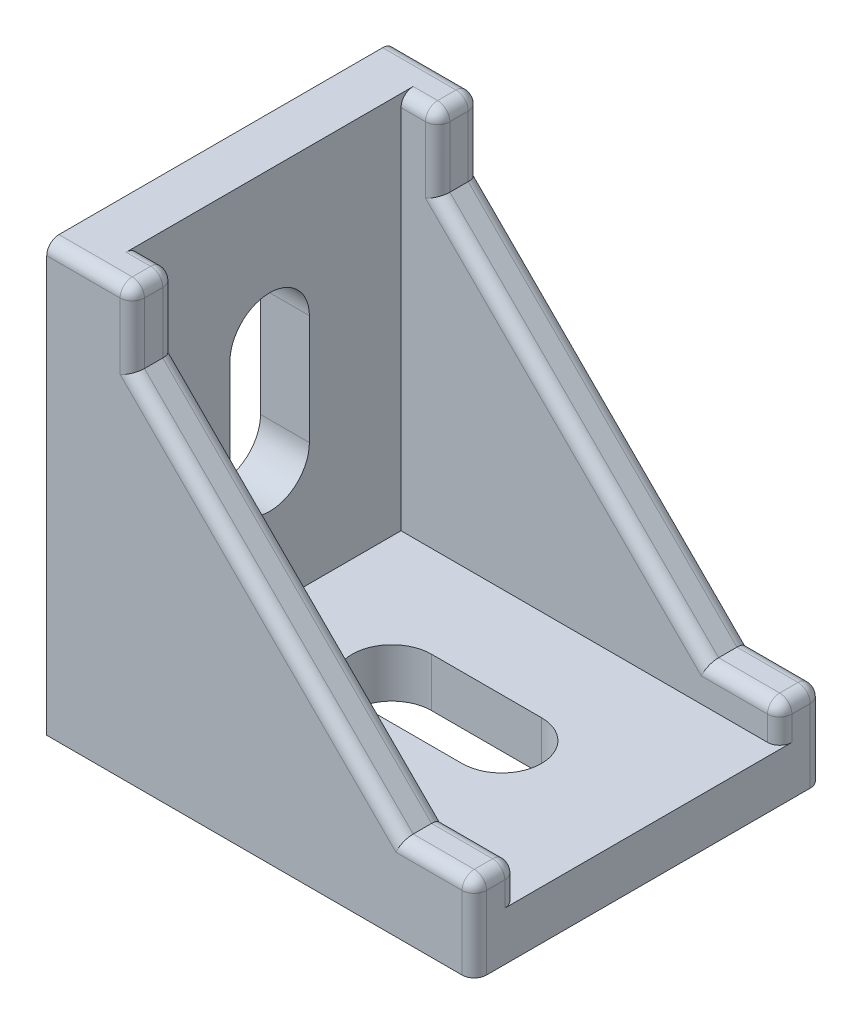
ISO-10303-21;
HEADER;
FILE_DESCRIPTION(('STEP AP214'),'2;1');
FILE_NAME('part.step','',(''),(''),'','','');
FILE_SCHEMA(('AUTOMOTIVE_DESIGN { 1 0 10303 214 1 1 1 1 }'));
ENDSEC;
DATA;
#1=APPLICATION_CONTEXT('core data for automotive mechanical design processes');
#2=APPLICATION_PROTOCOL_DEFINITION('international standard','automotive_design',2000,#1);
#3=PRODUCT_CONTEXT('',#1,'mechanical');
#4=PRODUCT('Part','Part','',(#3));
#5=PRODUCT_RELATED_PRODUCT_CATEGORY('part','',(#4));
#6=PRODUCT_DEFINITION_FORMATION('','',#4);
#7=PRODUCT_DEFINITION_CONTEXT('part definition',#1,'design');
#8=PRODUCT_DEFINITION('design','',#6,#7);
#9=PRODUCT_DEFINITION_SHAPE('','',#8);
#10=(LENGTH_UNIT() NAMED_UNIT(*) SI_UNIT(.MILLI.,.METRE.));
#11=(NAMED_UNIT(*) PLANE_ANGLE_UNIT() SI_UNIT($,.RADIAN.));
#12=(NAMED_UNIT(*) SI_UNIT($,.STERADIAN.) SOLID_ANGLE_UNIT());
#13=UNCERTAINTY_MEASURE_WITH_UNIT(LENGTH_MEASURE(1.E-05),#10,'distance_accuracy_value','');
#14=(GEOMETRIC_REPRESENTATION_CONTEXT(3) GLOBAL_UNCERTAINTY_ASSIGNED_CONTEXT((#13)) GLOBAL_UNIT_ASSIGNED_CONTEXT((#10,
#11,#12)) REPRESENTATION_CONTEXT('',''));
#15=CARTESIAN_POINT('',(0.,0.,0.));
#16=DIRECTION('',(0.,0.,1.));
#17=DIRECTION('',(1.,0.,0.));
#18=AXIS2_PLACEMENT_3D('',#15,#16,#17);
#19=CARTESIAN_POINT('',(-35.,-27.3234439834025,25.));
#20=DIRECTION('',(0.,1.,0.));
#21=DIRECTION('',(0.,0.,1.));
#22=AXIS2_PLACEMENT_3D('',#19,#20,#21);
#23=PLANE('',#22);
#24=DIRECTION('',(0.,0.,1.));
#25=VECTOR('',#24,1.);
#26=CARTESIAN_POINT('',(-32.5,-27.3234439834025,14.65));
#27=LINE('',#26,#25);
#28=CARTESIAN_POINT('',(-32.5,-27.3234439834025,14.65));
#29=VERTEX_POINT('',#28);
#30=CARTESIAN_POINT('',(-32.5,-27.3234439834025,17.));
#31=VERTEX_POINT('',#30);
#32=EDGE_CURVE('E588',#29,#31,#27,.T.);
#33=ORIENTED_EDGE('',*,*,#32,.T.);
#34=DIRECTION('',(1.,0.,0.));
#35=VECTOR('',#34,1.);
#36=CARTESIAN_POINT('',(-32.5,-27.3234439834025,17.));
#37=LINE('',#36,#35);
#38=CARTESIAN_POINT('',(-27.5,-27.3234439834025,17.));
#39=VERTEX_POINT('',#38);
#40=EDGE_CURVE('E613',#31,#39,#37,.T.);
#41=ORIENTED_EDGE('',*,*,#40,.T.);
#42=DIRECTION('',(0.,0.,-1.));
#43=VECTOR('',#42,1.);
#44=CARTESIAN_POINT('',(-27.5,-27.3234439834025,17.));
#45=LINE('',#44,#43);
#46=CARTESIAN_POINT('',(-27.5,-27.3234439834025,4.5));
#47=VERTEX_POINT('',#46);
#48=EDGE_CURVE('E610',#39,#47,#45,.T.);
#49=ORIENTED_EDGE('',*,*,#48,.T.);
#50=DIRECTION('',(-1.,0.,0.));
#51=VECTOR('',#50,1.);
#52=CARTESIAN_POINT('',(-27.5,-27.3234439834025,4.5));
#53=LINE('',#52,#51);
#54=CARTESIAN_POINT('',(-32.5,-27.3234439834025,4.5));
#55=VERTEX_POINT('',#54);
#56=EDGE_CURVE('E607',#47,#55,#53,.T.);
#57=ORIENTED_EDGE('',*,*,#56,.T.);
#58=DIRECTION('',(0.,0.,1.));
#59=VECTOR('',#58,1.);
#60=CARTESIAN_POINT('',(-32.5,-27.3234439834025,4.5));
#61=LINE('',#60,#59);
#62=CARTESIAN_POINT('',(-32.5,-27.3234439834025,6.85));
#63=VERTEX_POINT('',#62);
#64=EDGE_CURVE('E583',#55,#63,#61,.T.);
#65=ORIENTED_EDGE('',*,*,#64,.T.);
#66=DIRECTION('',(0.,0.,1.));
#67=VECTOR('',#66,1.);
#68=CARTESIAN_POINT('',(-32.5,-27.3234439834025,14.65));
#69=LINE('',#68,#67);
#70=EDGE_CURVE('E669',#63,#29,#69,.T.);
#71=ORIENTED_EDGE('',*,*,#70,.T.);
#72=EDGE_LOOP('',(#33,#41,#49,#57,#65,#71));
#73=FACE_BOUND('',#72,.T.);
#74=DIRECTION('',(1.,0.,0.));
#75=VECTOR('',#74,1.);
#76=CARTESIAN_POINT('',(-35.,-27.3234439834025,-3.5));
#77=LINE('',#76,#75);
#78=CARTESIAN_POINT('',(-35.,-27.3234439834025,-3.5));
#79=VERTEX_POINT('',#78);
#80=CARTESIAN_POINT('',(-1.,-27.3234439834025,-3.5));
#81=VERTEX_POINT('',#80);
#82=EDGE_CURVE('E894',#79,#81,#77,.T.);
#83=ORIENTED_EDGE('',*,*,#82,.T.);
#84=CARTESIAN_POINT('',(-1.,-27.3234439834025,-2.5));
#85=DIRECTION('',(0.,1.,0.));
#86=DIRECTION('',(0.,0.,1.));
#87=AXIS2_PLACEMENT_3D('',#84,#85,#86);
#88=CIRCLE('',#87,1.);
#89=CARTESIAN_POINT('',(0.,-27.3234439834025,-2.5));
#90=VERTEX_POINT('',#89);
#91=EDGE_CURVE('E1123',#81,#90,#88,.F.);
#92=ORIENTED_EDGE('',*,*,#91,.T.);
#93=DIRECTION('',(0.,0.,-1.));
#94=VECTOR('',#93,1.);
#95=CARTESIAN_POINT('',(0.,-27.3234439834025,25.));
#96=LINE('',#95,#94);
#97=CARTESIAN_POINT('',(0.,-27.3234439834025,24.));
#98=VERTEX_POINT('',#97);
#99=EDGE_CURVE('E923',#98,#90,#96,.T.);
#100=ORIENTED_EDGE('',*,*,#99,.F.);
#101=CARTESIAN_POINT('',(-1.,-27.3234439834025,24.));
#102=DIRECTION('',(0.,1.,0.));
#103=DIRECTION('',(0.,0.,1.));
#104=AXIS2_PLACEMENT_3D('',#101,#102,#103);
#105=CIRCLE('',#104,1.);
#106=CARTESIAN_POINT('',(-1.,-27.3234439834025,25.));
#107=VERTEX_POINT('',#106);
#108=EDGE_CURVE('E971',#98,#107,#105,.F.);
#109=ORIENTED_EDGE('',*,*,#108,.T.);
#110=DIRECTION('',(1.,0.,0.));
#111=VECTOR('',#110,1.);
#112=CARTESIAN_POINT('',(-35.,-27.3234439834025,25.));
#113=LINE('',#112,#111);
#114=CARTESIAN_POINT('',(-35.,-27.3234439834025,25.));
#115=VERTEX_POINT('',#114);
#116=EDGE_CURVE('E910',#115,#107,#113,.T.);
#117=ORIENTED_EDGE('',*,*,#116,.F.);
#118=DIRECTION('',(0.,0.,-1.));
#119=VECTOR('',#118,1.);
#120=CARTESIAN_POINT('',(-35.,-27.3234439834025,25.));
#121=LINE('',#120,#119);
#122=EDGE_CURVE('E926',#115,#79,#121,.T.);
#123=ORIENTED_EDGE('',*,*,#122,.T.);
#124=EDGE_LOOP('',(#83,#92,#100,#109,#117,#123));
#125=FACE_BOUND('',#124,.T.);
#126=DIRECTION('',(0.,0.,-1.));
#127=VECTOR('',#126,1.);
#128=CARTESIAN_POINT('',(-2.99999999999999,-27.3234439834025,6.85));
#129=LINE('',#128,#127);
#130=CARTESIAN_POINT('',(-2.99999999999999,-27.3234439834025,6.85));
#131=VERTEX_POINT('',#130);
#132=CARTESIAN_POINT('',(-2.99999999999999,-27.3234439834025,4.5));
#133=VERTEX_POINT('',#132);
#134=EDGE_CURVE('E636',#131,#133,#129,.T.);
#135=ORIENTED_EDGE('',*,*,#134,.T.);
#136=DIRECTION('',(-1.,0.,0.));
#137=VECTOR('',#136,1.);
#138=CARTESIAN_POINT('',(-2.99999999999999,-27.3234439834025,4.5));
#139=LINE('',#138,#137);
#140=CARTESIAN_POINT('',(-7.99999999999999,-27.3234439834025,4.5));
#141=VERTEX_POINT('',#140);
#142=EDGE_CURVE('E661',#133,#141,#139,.T.);
#143=ORIENTED_EDGE('',*,*,#142,.T.);
#144=DIRECTION('',(0.,0.,1.));
#145=VECTOR('',#144,1.);
#146=CARTESIAN_POINT('',(-7.99999999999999,-27.3234439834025,4.5));
#147=LINE('',#146,#145);
#148=CARTESIAN_POINT('',(-7.99999999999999,-27.3234439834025,17.));
#149=VERTEX_POINT('',#148);
#150=EDGE_CURVE('E658',#141,#149,#147,.T.);
#151=ORIENTED_EDGE('',*,*,#150,.T.);
#152=DIRECTION('',(1.,0.,0.));
#153=VECTOR('',#152,1.);
#154=CARTESIAN_POINT('',(-7.99999999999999,-27.3234439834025,17.));
#155=LINE('',#154,#153);
#156=CARTESIAN_POINT('',(-2.99999999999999,-27.3234439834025,17.));
#157=VERTEX_POINT('',#156);
#158=EDGE_CURVE('E655',#149,#157,#155,.T.);
#159=ORIENTED_EDGE('',*,*,#158,.T.);
#160=DIRECTION('',(0.,0.,-1.));
#161=VECTOR('',#160,1.);
#162=CARTESIAN_POINT('',(-2.99999999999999,-27.3234439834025,17.));
#163=LINE('',#162,#161);
#164=CARTESIAN_POINT('',(-2.99999999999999,-27.3234439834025,14.65));
#165=VERTEX_POINT('',#164);
#166=EDGE_CURVE('E621',#157,#165,#163,.T.);
#167=ORIENTED_EDGE('',*,*,#166,.T.);
#168=DIRECTION('',(0.,0.,-1.));
#169=VECTOR('',#168,1.);
#170=CARTESIAN_POINT('',(-2.99999999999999,-27.3234439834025,6.85));
#171=LINE('',#170,#169);
#172=EDGE_CURVE('E695',#165,#131,#171,.T.);
#173=ORIENTED_EDGE('',*,*,#172,.T.);
#174=EDGE_LOOP('',(#135,#143,#151,#159,#167,#173));
#175=FACE_BOUND('',#174,.T.);
#176=DIRECTION('',(-1.,0.,0.));
#177=VECTOR('',#176,1.);
#178=CARTESIAN_POINT('',(-35.,-27.3234439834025,14.));
#179=LINE('',#178,#177);
#180=CARTESIAN_POINT('',(-12.,-27.3234439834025,14.));
#181=VERTEX_POINT('',#180);
#182=CARTESIAN_POINT('',(-21.,-27.3234439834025,14.));
#183=VERTEX_POINT('',#182);
#184=EDGE_CURVE('E581',#181,#183,#179,.T.);
#185=ORIENTED_EDGE('',*,*,#184,.F.);
#186=CARTESIAN_POINT('',(-12.,-27.3234439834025,10.75));
#187=DIRECTION('',(0.,1.,0.));
#188=DIRECTION('',(0.,0.,1.));
#189=AXIS2_PLACEMENT_3D('',#186,#187,#188);
#190=CIRCLE('',#189,3.25);
#191=CARTESIAN_POINT('',(-12.,-27.3234439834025,7.50000000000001));
#192=VERTEX_POINT('',#191);
#193=EDGE_CURVE('E574',#192,#181,#190,.F.);
#194=ORIENTED_EDGE('',*,*,#193,.F.);
#195=DIRECTION('',(-1.,0.,0.));
#196=VECTOR('',#195,1.);
#197=CARTESIAN_POINT('',(-35.,-27.3234439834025,7.5));
#198=LINE('',#197,#196);
#199=CARTESIAN_POINT('',(-21.,-27.3234439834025,7.5));
#200=VERTEX_POINT('',#199);
#201=EDGE_CURVE('E550',#192,#200,#198,.T.);
#202=ORIENTED_EDGE('',*,*,#201,.T.);
#203=CARTESIAN_POINT('',(-21.,-27.3234439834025,10.75));
#204=DIRECTION('',(0.,1.,0.));
#205=DIRECTION('',(0.,0.,1.));
#206=AXIS2_PLACEMENT_3D('',#203,#204,#205);
#207=CIRCLE('',#206,3.25);
#208=EDGE_CURVE('E579',#183,#200,#207,.F.);
#209=ORIENTED_EDGE('',*,*,#208,.F.);
#210=EDGE_LOOP('',(#185,#194,#202,#209));
#211=FACE_BOUND('',#210,.T.);
#212=ADVANCED_FACE('F35',(#73,#125,#175,#211),#23,.F.);
#213=CARTESIAN_POINT('',(-31.,-23.3234439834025,25.));
#214=DIRECTION('',(0.,-1.,0.));
#215=DIRECTION('',(0.,0.,-1.));
#216=AXIS2_PLACEMENT_3D('',#213,#214,#215);
#217=PLANE('',#216);
#218=DIRECTION('',(0.,0.,-1.));
#219=VECTOR('',#218,1.);
#220=CARTESIAN_POINT('',(0.,-23.3234439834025,25.));
#221=LINE('',#220,#219);
#222=CARTESIAN_POINT('',(0.,-23.3234439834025,22.5));
#223=VERTEX_POINT('',#222);
#224=CARTESIAN_POINT('',(0.,-23.3234439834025,-1.));
#225=VERTEX_POINT('',#224);
#226=EDGE_CURVE('E921',#223,#225,#221,.T.);
#227=ORIENTED_EDGE('',*,*,#226,.T.);
#228=CARTESIAN_POINT('',(-1.,-23.3234439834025,-1.));
#229=DIRECTION('',(0.,-1.,0.));
#230=DIRECTION('',(0.,0.,-1.));
#231=AXIS2_PLACEMENT_3D('',#228,#229,#230);
#232=CIRCLE('',#231,1.);
#233=CARTESIAN_POINT('',(-1.,-23.3234439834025,0.));
#234=VERTEX_POINT('',#233);
#235=EDGE_CURVE('E1133',#225,#234,#232,.T.);
#236=ORIENTED_EDGE('',*,*,#235,.T.);
#237=DIRECTION('',(1.,0.,0.));
#238=VECTOR('',#237,1.);
#239=CARTESIAN_POINT('',(0.,-23.3234439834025,0.));
#240=LINE('',#239,#238);
#241=CARTESIAN_POINT('',(-31.,-23.3234439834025,0.));
#242=VERTEX_POINT('',#241);
#243=EDGE_CURVE('E883',#242,#234,#240,.T.);
#244=ORIENTED_EDGE('',*,*,#243,.F.);
#245=DIRECTION('',(0.,0.,-1.));
#246=VECTOR('',#245,1.);
#247=CARTESIAN_POINT('',(-31.,-23.3234439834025,25.));
#248=LINE('',#247,#246);
#249=CARTESIAN_POINT('',(-31.,-23.3234439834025,21.5));
#250=VERTEX_POINT('',#249);
#251=EDGE_CURVE('E918',#250,#242,#248,.T.);
#252=ORIENTED_EDGE('',*,*,#251,.F.);
#253=DIRECTION('',(1.,0.,0.));
#254=VECTOR('',#253,1.);
#255=CARTESIAN_POINT('',(0.,-23.3234439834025,21.5));
#256=LINE('',#255,#254);
#257=CARTESIAN_POINT('',(-1.,-23.3234439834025,21.5));
#258=VERTEX_POINT('',#257);
#259=EDGE_CURVE('E899',#250,#258,#256,.T.);
#260=ORIENTED_EDGE('',*,*,#259,.T.);
#261=CARTESIAN_POINT('',(-1.,-23.3234439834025,22.5));
#262=DIRECTION('',(0.,-1.,0.));
#263=DIRECTION('',(0.,0.,-1.));
#264=AXIS2_PLACEMENT_3D('',#261,#262,#263);
#265=CIRCLE('',#264,1.);
#266=EDGE_CURVE('E973',#258,#223,#265,.T.);
#267=ORIENTED_EDGE('',*,*,#266,.T.);
#268=EDGE_LOOP('',(#227,#236,#244,#252,#260,#267));
#269=FACE_BOUND('',#268,.T.);
#270=DIRECTION('',(-1.,0.,0.));
#271=VECTOR('',#270,1.);
#272=CARTESIAN_POINT('',(-15.5,-23.3234439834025,14.));
#273=LINE('',#272,#271);
#274=CARTESIAN_POINT('',(-12.,-23.3234439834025,14.));
#275=VERTEX_POINT('',#274);
#276=CARTESIAN_POINT('',(-21.,-23.3234439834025,14.));
#277=VERTEX_POINT('',#276);
#278=EDGE_CURVE('E563',#275,#277,#273,.T.);
#279=ORIENTED_EDGE('',*,*,#278,.T.);
#280=CARTESIAN_POINT('',(-21.,-23.3234439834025,10.75));
#281=DIRECTION('',(0.,-1.,0.));
#282=DIRECTION('',(1.,0.,0.));
#283=AXIS2_PLACEMENT_3D('',#280,#281,#282);
#284=CIRCLE('',#283,3.25);
#285=CARTESIAN_POINT('',(-21.,-23.3234439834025,7.5));
#286=VERTEX_POINT('',#285);
#287=EDGE_CURVE('E567',#277,#286,#284,.T.);
#288=ORIENTED_EDGE('',*,*,#287,.T.);
#289=DIRECTION('',(-1.,0.,0.));
#290=VECTOR('',#289,1.);
#291=CARTESIAN_POINT('',(-15.5,-23.3234439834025,7.5));
#292=LINE('',#291,#290);
#293=CARTESIAN_POINT('',(-12.,-23.3234439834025,7.5));
#294=VERTEX_POINT('',#293);
#295=EDGE_CURVE('E547',#294,#286,#292,.T.);
#296=ORIENTED_EDGE('',*,*,#295,.F.);
#297=CARTESIAN_POINT('',(-12.,-23.3234439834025,10.75));
#298=DIRECTION('',(0.,-1.,0.));
#299=DIRECTION('',(1.,0.,0.));
#300=AXIS2_PLACEMENT_3D('',#297,#298,#299);
#301=CIRCLE('',#300,3.25);
#302=EDGE_CURVE('E558',#294,#275,#301,.T.);
#303=ORIENTED_EDGE('',*,*,#302,.T.);
#304=EDGE_LOOP('',(#279,#288,#296,#303));
#305=FACE_BOUND('',#304,.T.);
#306=ADVANCED_FACE('F565',(#269,#305),#217,.F.);
#307=CARTESIAN_POINT('',(-35.,7.6765560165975,25.));
#308=DIRECTION('',(1.,0.,0.));
#309=DIRECTION('',(0.,0.,-1.));
#310=AXIS2_PLACEMENT_3D('',#307,#308,#309);
#311=PLANE('',#310);
#312=DIRECTION('',(0.,0.,-1.));
#313=VECTOR('',#312,1.);
#314=CARTESIAN_POINT('',(-35.,4.6765560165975,6.85));
#315=LINE('',#314,#313);
#316=CARTESIAN_POINT('',(-35.,4.6765560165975,14.65));
#317=VERTEX_POINT('',#316);
#318=CARTESIAN_POINT('',(-35.,4.6765560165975,6.85));
#319=VERTEX_POINT('',#318);
#320=EDGE_CURVE('E833',#317,#319,#315,.T.);
#321=ORIENTED_EDGE('',*,*,#320,.F.);
#322=DIRECTION('',(0.,0.,-1.));
#323=VECTOR('',#322,1.);
#324=CARTESIAN_POINT('',(-35.,4.6765560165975,17.));
#325=LINE('',#324,#323);
#326=CARTESIAN_POINT('',(-35.,4.6765560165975,17.));
#327=VERTEX_POINT('',#326);
#328=EDGE_CURVE('E769',#327,#317,#325,.T.);
#329=ORIENTED_EDGE('',*,*,#328,.F.);
#330=DIRECTION('',(0.,1.,0.));
#331=VECTOR('',#330,1.);
#332=CARTESIAN_POINT('',(-35.,-0.323443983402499,17.));
#333=LINE('',#332,#331);
#334=CARTESIAN_POINT('',(-35.,-0.323443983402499,17.));
#335=VERTEX_POINT('',#334);
#336=EDGE_CURVE('E799',#335,#327,#333,.T.);
#337=ORIENTED_EDGE('',*,*,#336,.F.);
#338=DIRECTION('',(0.,0.,1.));
#339=VECTOR('',#338,1.);
#340=CARTESIAN_POINT('',(-35.,-0.323443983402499,4.5));
#341=LINE('',#340,#339);
#342=CARTESIAN_POINT('',(-35.,-0.323443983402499,4.5));
#343=VERTEX_POINT('',#342);
#344=EDGE_CURVE('E796',#343,#335,#341,.T.);
#345=ORIENTED_EDGE('',*,*,#344,.F.);
#346=DIRECTION('',(0.,-1.,0.));
#347=VECTOR('',#346,1.);
#348=CARTESIAN_POINT('',(-35.,4.6765560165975,4.5));
#349=LINE('',#348,#347);
#350=CARTESIAN_POINT('',(-35.,4.6765560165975,4.5));
#351=VERTEX_POINT('',#350);
#352=EDGE_CURVE('E793',#351,#343,#349,.T.);
#353=ORIENTED_EDGE('',*,*,#352,.F.);
#354=DIRECTION('',(0.,0.,-1.));
#355=VECTOR('',#354,1.);
#356=CARTESIAN_POINT('',(-35.,4.6765560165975,6.85));
#357=LINE('',#356,#355);
#358=EDGE_CURVE('E754',#319,#351,#357,.T.);
#359=ORIENTED_EDGE('',*,*,#358,.F.);
#360=EDGE_LOOP('',(#321,#329,#337,#345,#353,#359));
#361=FACE_BOUND('',#360,.T.);
#362=CARTESIAN_POINT('',(-35.,-4.3234439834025,10.75));
#363=DIRECTION('',(1.,0.,0.));
#364=DIRECTION('',(0.,1.,0.));
#365=AXIS2_PLACEMENT_3D('',#362,#363,#364);
#366=CIRCLE('',#365,3.25);
#367=CARTESIAN_POINT('',(-35.,-4.3234439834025,7.5));
#368=VERTEX_POINT('',#367);
#369=CARTESIAN_POINT('',(-35.,-4.3234439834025,14.));
#370=VERTEX_POINT('',#369);
#371=EDGE_CURVE('E860',#368,#370,#366,.T.);
#372=ORIENTED_EDGE('',*,*,#371,.T.);
#373=DIRECTION('',(0.,-1.,0.));
#374=VECTOR('',#373,1.);
#375=CARTESIAN_POINT('',(-35.,-7.8234439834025,14.));
#376=LINE('',#375,#374);
#377=CARTESIAN_POINT('',(-35.,-13.3234439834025,14.));
#378=VERTEX_POINT('',#377);
#379=EDGE_CURVE('E850',#370,#378,#376,.T.);
#380=ORIENTED_EDGE('',*,*,#379,.T.);
#381=CARTESIAN_POINT('',(-35.,-13.3234439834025,10.75));
#382=DIRECTION('',(1.,0.,0.));
#383=DIRECTION('',(0.,1.,0.));
#384=AXIS2_PLACEMENT_3D('',#381,#382,#383);
#385=CIRCLE('',#384,3.25);
#386=CARTESIAN_POINT('',(-35.,-13.3234439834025,7.5));
#387=VERTEX_POINT('',#386);
#388=EDGE_CURVE('E853',#378,#387,#385,.T.);
#389=ORIENTED_EDGE('',*,*,#388,.T.);
#390=DIRECTION('',(0.,-1.,0.));
#391=VECTOR('',#390,1.);
#392=CARTESIAN_POINT('',(-35.,-7.8234439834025,7.5));
#393=LINE('',#392,#391);
#394=EDGE_CURVE('E857',#368,#387,#393,.T.);
#395=ORIENTED_EDGE('',*,*,#394,.F.);
#396=EDGE_LOOP('',(#372,#380,#389,#395));
#397=FACE_BOUND('',#396,.T.);
#398=DIRECTION('',(0.,0.,-1.));
#399=VECTOR('',#398,1.);
#400=CARTESIAN_POINT('',(-35.,7.6765560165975,25.));
#401=LINE('',#400,#399);
#402=CARTESIAN_POINT('',(-35.,7.6765560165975,24.));
#403=VERTEX_POINT('',#402);
#404=CARTESIAN_POINT('',(-35.,7.6765560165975,-2.5));
#405=VERTEX_POINT('',#404);
#406=EDGE_CURVE('E913',#403,#405,#401,.T.);
#407=ORIENTED_EDGE('',*,*,#406,.T.);
#408=CARTESIAN_POINT('',(-35.,6.6765560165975,-2.5));
#409=DIRECTION('',(1.,0.,0.));
#410=DIRECTION('',(0.,0.,-1.));
#411=AXIS2_PLACEMENT_3D('',#408,#409,#410);
#412=CIRCLE('',#411,1.);
#413=CARTESIAN_POINT('',(-35.,6.6765560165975,-3.5));
#414=VERTEX_POINT('',#413);
#415=EDGE_CURVE('E1040',#405,#414,#412,.F.);
#416=ORIENTED_EDGE('',*,*,#415,.T.);
#417=DIRECTION('',(0.,-1.,0.));
#418=VECTOR('',#417,1.);
#419=CARTESIAN_POINT('',(-35.,7.6765560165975,-3.5));
#420=LINE('',#419,#418);
#421=EDGE_CURVE('E890',#414,#79,#420,.T.);
#422=ORIENTED_EDGE('',*,*,#421,.T.);
#423=ORIENTED_EDGE('',*,*,#122,.F.);
#424=DIRECTION('',(0.,-1.,0.));
#425=VECTOR('',#424,1.);
#426=CARTESIAN_POINT('',(-35.,7.6765560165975,25.));
#427=LINE('',#426,#425);
#428=CARTESIAN_POINT('',(-35.,6.6765560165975,25.));
#429=VERTEX_POINT('',#428);
#430=EDGE_CURVE('E906',#429,#115,#427,.T.);
#431=ORIENTED_EDGE('',*,*,#430,.F.);
#432=CARTESIAN_POINT('',(-35.,6.6765560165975,24.));
#433=DIRECTION('',(1.,0.,0.));
#434=DIRECTION('',(0.,0.,-1.));
#435=AXIS2_PLACEMENT_3D('',#432,#433,#434);
#436=CIRCLE('',#435,1.);
#437=EDGE_CURVE('E998',#429,#403,#436,.F.);
#438=ORIENTED_EDGE('',*,*,#437,.T.);
#439=EDGE_LOOP('',(#407,#416,#422,#423,#431,#438));
#440=FACE_BOUND('',#439,.T.);
#441=DIRECTION('',(0.,0.,1.));
#442=VECTOR('',#441,1.);
#443=CARTESIAN_POINT('',(-35.,-24.8234439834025,14.65));
#444=LINE('',#443,#442);
#445=CARTESIAN_POINT('',(-35.,-24.8234439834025,6.85));
#446=VERTEX_POINT('',#445);
#447=CARTESIAN_POINT('',(-35.,-24.8234439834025,14.65));
#448=VERTEX_POINT('',#447);
#449=EDGE_CURVE('E807',#446,#448,#444,.T.);
#450=ORIENTED_EDGE('',*,*,#449,.F.);
#451=DIRECTION('',(0.,0.,1.));
#452=VECTOR('',#451,1.);
#453=CARTESIAN_POINT('',(-35.,-24.8234439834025,4.5));
#454=LINE('',#453,#452);
#455=CARTESIAN_POINT('',(-35.,-24.8234439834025,4.5));
#456=VERTEX_POINT('',#455);
#457=EDGE_CURVE('E716',#456,#446,#454,.T.);
#458=ORIENTED_EDGE('',*,*,#457,.F.);
#459=DIRECTION('',(0.,-1.,0.));
#460=VECTOR('',#459,1.);
#461=CARTESIAN_POINT('',(-35.,-19.8234439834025,4.5));
#462=LINE('',#461,#460);
#463=CARTESIAN_POINT('',(-35.,-19.8234439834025,4.5));
#464=VERTEX_POINT('',#463);
#465=EDGE_CURVE('E746',#464,#456,#462,.T.);
#466=ORIENTED_EDGE('',*,*,#465,.F.);
#467=DIRECTION('',(0.,0.,-1.));
#468=VECTOR('',#467,1.);
#469=CARTESIAN_POINT('',(-35.,-19.8234439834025,17.));
#470=LINE('',#469,#468);
#471=CARTESIAN_POINT('',(-35.,-19.8234439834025,17.));
#472=VERTEX_POINT('',#471);
#473=EDGE_CURVE('E743',#472,#464,#470,.T.);
#474=ORIENTED_EDGE('',*,*,#473,.F.);
#475=DIRECTION('',(0.,1.,0.));
#476=VECTOR('',#475,1.);
#477=CARTESIAN_POINT('',(-35.,-24.8234439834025,17.));
#478=LINE('',#477,#476);
#479=CARTESIAN_POINT('',(-35.,-24.8234439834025,17.));
#480=VERTEX_POINT('',#479);
#481=EDGE_CURVE('E740',#480,#472,#478,.T.);
#482=ORIENTED_EDGE('',*,*,#481,.F.);
#483=DIRECTION('',(0.,0.,1.));
#484=VECTOR('',#483,1.);
#485=CARTESIAN_POINT('',(-35.,-24.8234439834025,14.65));
#486=LINE('',#485,#484);
#487=EDGE_CURVE('E711',#448,#480,#486,.T.);
#488=ORIENTED_EDGE('',*,*,#487,.F.);
#489=EDGE_LOOP('',(#450,#458,#466,#474,#482,#488));
#490=FACE_BOUND('',#489,.T.);
#491=ADVANCED_FACE('F1243',(#361,#397,#440,#490),#311,.F.);
#492=CARTESIAN_POINT('',(0.,-23.3234439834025,25.));
#493=DIRECTION('',(-1.,0.,0.));
#494=DIRECTION('',(0.,0.,1.));
#495=AXIS2_PLACEMENT_3D('',#492,#493,#494);
#496=PLANE('',#495);
#497=DIRECTION('',(0.,1.,0.));
#498=VECTOR('',#497,1.);
#499=CARTESIAN_POINT('',(0.,-23.3234439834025,-1.));
#500=LINE('',#499,#498);
#501=CARTESIAN_POINT('',(0.,-21.3234439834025,-1.));
#502=VERTEX_POINT('',#501);
#503=EDGE_CURVE('E1115',#502,#225,#500,.F.);
#504=ORIENTED_EDGE('',*,*,#503,.T.);
#505=ORIENTED_EDGE('',*,*,#226,.F.);
#506=DIRECTION('',(0.,1.,0.));
#507=VECTOR('',#506,1.);
#508=CARTESIAN_POINT('',(0.,-21.3234439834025,22.5));
#509=LINE('',#508,#507);
#510=CARTESIAN_POINT('',(0.,-21.3234439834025,22.5));
#511=VERTEX_POINT('',#510);
#512=EDGE_CURVE('E958',#223,#511,#509,.T.);
#513=ORIENTED_EDGE('',*,*,#512,.T.);
#514=DIRECTION('',(0.,0.,1.));
#515=VECTOR('',#514,1.);
#516=CARTESIAN_POINT('',(0.,-21.3234439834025,24.));
#517=LINE('',#516,#515);
#518=CARTESIAN_POINT('',(0.,-21.3234439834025,24.));
#519=VERTEX_POINT('',#518);
#520=EDGE_CURVE('E956',#511,#519,#517,.T.);
#521=ORIENTED_EDGE('',*,*,#520,.T.);
#522=DIRECTION('',(0.,1.,0.));
#523=VECTOR('',#522,1.);
#524=CARTESIAN_POINT('',(0.,-27.3234439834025,24.));
#525=LINE('',#524,#523);
#526=EDGE_CURVE('E954',#519,#98,#525,.F.);
#527=ORIENTED_EDGE('',*,*,#526,.T.);
#528=ORIENTED_EDGE('',*,*,#99,.T.);
#529=DIRECTION('',(0.,1.,0.));
#530=VECTOR('',#529,1.);
#531=CARTESIAN_POINT('',(0.,-21.3234439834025,-2.5));
#532=LINE('',#531,#530);
#533=CARTESIAN_POINT('',(0.,-21.3234439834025,-2.5));
#534=VERTEX_POINT('',#533);
#535=EDGE_CURVE('E1118',#90,#534,#532,.T.);
#536=ORIENTED_EDGE('',*,*,#535,.T.);
#537=DIRECTION('',(0.,0.,-1.));
#538=VECTOR('',#537,1.);
#539=CARTESIAN_POINT('',(0.,-21.3234439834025,25.));
#540=LINE('',#539,#538);
#541=EDGE_CURVE('E1113',#534,#502,#540,.F.);
#542=ORIENTED_EDGE('',*,*,#541,.T.);
#543=EDGE_LOOP('',(#504,#505,#513,#521,#527,#528,#536,#542));
#544=FACE_BOUND('',#543,.T.);
#545=ADVANCED_FACE('F1249',(#544),#496,.F.);
#546=CARTESIAN_POINT('',(-31.,7.6765560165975,25.));
#547=DIRECTION('',(-1.,0.,0.));
#548=DIRECTION('',(0.,-1.,0.));
#549=AXIS2_PLACEMENT_3D('',#546,#547,#548);
#550=PLANE('',#549);
#551=CARTESIAN_POINT('',(-31.,-13.3234439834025,10.75));
#552=DIRECTION('',(1.,0.,0.));
#553=DIRECTION('',(0.,1.,0.));
#554=AXIS2_PLACEMENT_3D('',#551,#552,#553);
#555=CIRCLE('',#554,3.25);
#556=CARTESIAN_POINT('',(-31.,-13.3234439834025,14.));
#557=VERTEX_POINT('',#556);
#558=CARTESIAN_POINT('',(-31.,-13.3234439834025,7.5));
#559=VERTEX_POINT('',#558);
#560=EDGE_CURVE('E865',#557,#559,#555,.T.);
#561=ORIENTED_EDGE('',*,*,#560,.F.);
#562=DIRECTION('',(0.,-1.,0.));
#563=VECTOR('',#562,1.);
#564=CARTESIAN_POINT('',(-31.,-7.8234439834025,14.));
#565=LINE('',#564,#563);
#566=CARTESIAN_POINT('',(-31.,-4.3234439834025,14.));
#567=VERTEX_POINT('',#566);
#568=EDGE_CURVE('E849',#567,#557,#565,.T.);
#569=ORIENTED_EDGE('',*,*,#568,.F.);
#570=CARTESIAN_POINT('',(-31.,-4.3234439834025,10.75));
#571=DIRECTION('',(1.,0.,0.));
#572=DIRECTION('',(0.,1.,0.));
#573=AXIS2_PLACEMENT_3D('',#570,#571,#572);
#574=CIRCLE('',#573,3.25);
#575=CARTESIAN_POINT('',(-31.,-4.3234439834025,7.5));
#576=VERTEX_POINT('',#575);
#577=EDGE_CURVE('E854',#576,#567,#574,.T.);
#578=ORIENTED_EDGE('',*,*,#577,.F.);
#579=DIRECTION('',(0.,-1.,0.));
#580=VECTOR('',#579,1.);
#581=CARTESIAN_POINT('',(-31.,-7.8234439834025,7.5));
#582=LINE('',#581,#580);
#583=EDGE_CURVE('E868',#576,#559,#582,.T.);
#584=ORIENTED_EDGE('',*,*,#583,.T.);
#585=EDGE_LOOP('',(#561,#569,#578,#584));
#586=FACE_BOUND('',#585,.T.);
#587=ORIENTED_EDGE('',*,*,#251,.T.);
#588=DIRECTION('',(0.,-1.,0.));
#589=VECTOR('',#588,1.);
#590=CARTESIAN_POINT('',(-31.,-23.3234439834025,0.));
#591=LINE('',#590,#589);
#592=CARTESIAN_POINT('',(-31.,6.6765560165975,0.));
#593=VERTEX_POINT('',#592);
#594=EDGE_CURVE('E875',#593,#242,#591,.T.);
#595=ORIENTED_EDGE('',*,*,#594,.F.);
#596=CARTESIAN_POINT('',(-31.,6.6765560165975,-1.));
#597=DIRECTION('',(-1.,0.,0.));
#598=DIRECTION('',(0.,-1.,0.));
#599=AXIS2_PLACEMENT_3D('',#596,#597,#598);
#600=CIRCLE('',#599,1.);
#601=CARTESIAN_POINT('',(-31.,7.6765560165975,-1.));
#602=VERTEX_POINT('',#601);
#603=EDGE_CURVE('E1050',#593,#602,#600,.T.);
#604=ORIENTED_EDGE('',*,*,#603,.T.);
#605=DIRECTION('',(0.,0.,-1.));
#606=VECTOR('',#605,1.);
#607=CARTESIAN_POINT('',(-31.,7.6765560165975,25.));
#608=LINE('',#607,#606);
#609=CARTESIAN_POINT('',(-31.,7.6765560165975,22.5));
#610=VERTEX_POINT('',#609);
#611=EDGE_CURVE('E916',#610,#602,#608,.T.);
#612=ORIENTED_EDGE('',*,*,#611,.F.);
#613=CARTESIAN_POINT('',(-31.,6.6765560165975,22.5));
#614=DIRECTION('',(-1.,0.,0.));
#615=DIRECTION('',(0.,-1.,0.));
#616=AXIS2_PLACEMENT_3D('',#613,#614,#615);
#617=CIRCLE('',#616,1.);
#618=CARTESIAN_POINT('',(-31.,6.6765560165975,21.5));
#619=VERTEX_POINT('',#618);
#620=EDGE_CURVE('E1028',#610,#619,#617,.T.);
#621=ORIENTED_EDGE('',*,*,#620,.T.);
#622=DIRECTION('',(0.,-1.,0.));
#623=VECTOR('',#622,1.);
#624=CARTESIAN_POINT('',(-31.,-23.3234439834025,21.5));
#625=LINE('',#624,#623);
#626=EDGE_CURVE('E897',#619,#250,#625,.T.);
#627=ORIENTED_EDGE('',*,*,#626,.T.);
#628=EDGE_LOOP('',(#587,#595,#604,#612,#621,#627));
#629=FACE_BOUND('',#628,.T.);
#630=ADVANCED_FACE('F1574',(#586,#629),#550,.F.);
#631=CARTESIAN_POINT('',(-35.,7.6765560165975,25.));
#632=DIRECTION('',(0.,-1.,0.));
#633=DIRECTION('',(0.,0.,-1.));
#634=AXIS2_PLACEMENT_3D('',#631,#632,#633);
#635=PLANE('',#634);
#636=DIRECTION('',(-1.,0.,0.));
#637=VECTOR('',#636,1.);
#638=CARTESIAN_POINT('',(-28.,7.6765560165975,-1.));
#639=LINE('',#638,#637);
#640=CARTESIAN_POINT('',(-29.,7.6765560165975,-1.));
#641=VERTEX_POINT('',#640);
#642=EDGE_CURVE('E1047',#602,#641,#639,.F.);
#643=ORIENTED_EDGE('',*,*,#642,.T.);
#644=DIRECTION('',(0.,0.,-1.));
#645=VECTOR('',#644,1.);
#646=CARTESIAN_POINT('',(-29.,7.6765560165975,25.));
#647=LINE('',#646,#645);
#648=CARTESIAN_POINT('',(-29.,7.6765560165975,-2.5));
#649=VERTEX_POINT('',#648);
#650=EDGE_CURVE('E1065',#641,#649,#647,.T.);
#651=ORIENTED_EDGE('',*,*,#650,.T.);
#652=DIRECTION('',(-1.,0.,0.));
#653=VECTOR('',#652,1.);
#654=CARTESIAN_POINT('',(-35.,7.6765560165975,-2.5));
#655=LINE('',#654,#653);
#656=EDGE_CURVE('E1032',#649,#405,#655,.T.);
#657=ORIENTED_EDGE('',*,*,#656,.T.);
#658=ORIENTED_EDGE('',*,*,#406,.F.);
#659=DIRECTION('',(-1.,0.,0.));
#660=VECTOR('',#659,1.);
#661=CARTESIAN_POINT('',(-29.,7.6765560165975,24.));
#662=LINE('',#661,#660);
#663=CARTESIAN_POINT('',(-29.,7.6765560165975,24.));
#664=VERTEX_POINT('',#663);
#665=EDGE_CURVE('E1000',#403,#664,#662,.F.);
#666=ORIENTED_EDGE('',*,*,#665,.T.);
#667=DIRECTION('',(0.,0.,1.));
#668=VECTOR('',#667,1.);
#669=CARTESIAN_POINT('',(-29.,7.6765560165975,21.5));
#670=LINE('',#669,#668);
#671=CARTESIAN_POINT('',(-29.,7.6765560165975,22.5));
#672=VERTEX_POINT('',#671);
#673=EDGE_CURVE('E990',#664,#672,#670,.F.);
#674=ORIENTED_EDGE('',*,*,#673,.T.);
#675=DIRECTION('',(-1.,0.,0.));
#676=VECTOR('',#675,1.);
#677=CARTESIAN_POINT('',(-31.,7.6765560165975,22.5));
#678=LINE('',#677,#676);
#679=EDGE_CURVE('E1010',#672,#610,#678,.T.);
#680=ORIENTED_EDGE('',*,*,#679,.T.);
#681=ORIENTED_EDGE('',*,*,#611,.T.);
#682=EDGE_LOOP('',(#643,#651,#657,#658,#666,#674,#680,#681));
#683=FACE_BOUND('',#682,.T.);
#684=ADVANCED_FACE('F1570',(#683),#635,.F.);
#685=CARTESIAN_POINT('',(-35.,-27.3234439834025,25.));
#686=DIRECTION('',(0.,0.,1.));
#687=DIRECTION('',(1.,0.,0.));
#688=AXIS2_PLACEMENT_3D('',#685,#686,#687);
#689=PLANE('',#688);
#690=DIRECTION('',(0.,1.,0.));
#691=VECTOR('',#690,1.);
#692=CARTESIAN_POINT('',(-29.,-27.3234439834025,25.));
#693=LINE('',#692,#691);
#694=CARTESIAN_POINT('',(-29.,1.26234245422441,25.));
#695=VERTEX_POINT('',#694);
#696=CARTESIAN_POINT('',(-29.,6.6765560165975,25.));
#697=VERTEX_POINT('',#696);
#698=EDGE_CURVE('E993',#695,#697,#693,.T.);
#699=ORIENTED_EDGE('',*,*,#698,.T.);
#700=DIRECTION('',(-1.,0.,0.));
#701=VECTOR('',#700,1.);
#702=CARTESIAN_POINT('',(-35.,6.6765560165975,25.));
#703=LINE('',#702,#701);
#704=EDGE_CURVE('E995',#697,#429,#703,.T.);
#705=ORIENTED_EDGE('',*,*,#704,.T.);
#706=ORIENTED_EDGE('',*,*,#430,.T.);
#707=ORIENTED_EDGE('',*,*,#116,.T.);
#708=DIRECTION('',(0.,1.,0.));
#709=VECTOR('',#708,1.);
#710=CARTESIAN_POINT('',(-1.,-21.3234439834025,25.));
#711=LINE('',#710,#709);
#712=CARTESIAN_POINT('',(-1.,-21.3234439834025,25.));
#713=VERTEX_POINT('',#712);
#714=EDGE_CURVE('E969',#107,#713,#711,.T.);
#715=ORIENTED_EDGE('',*,*,#714,.T.);
#716=DIRECTION('',(-1.,0.,0.));
#717=VECTOR('',#716,1.);
#718=CARTESIAN_POINT('',(-35.,-21.3234439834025,25.));
#719=LINE('',#718,#717);
#720=CARTESIAN_POINT('',(-6.41421356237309,-21.3234439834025,25.));
#721=VERTEX_POINT('',#720);
#722=EDGE_CURVE('E939',#713,#721,#719,.T.);
#723=ORIENTED_EDGE('',*,*,#722,.T.);
#724=DIRECTION('',(-0.707106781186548,0.707106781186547,0.));
#725=VECTOR('',#724,1.);
#726=CARTESIAN_POINT('',(-17.7071067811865,-10.030550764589,25.));
#727=LINE('',#726,#725);
#728=EDGE_CURVE('E929',#721,#695,#727,.T.);
#729=ORIENTED_EDGE('',*,*,#728,.T.);
#730=EDGE_LOOP('',(#699,#705,#706,#707,#715,#723,#729));
#731=FACE_BOUND('',#730,.T.);
#732=ADVANCED_FACE('F1560',(#731),#689,.T.);
#733=CARTESIAN_POINT('',(-28.,7.6765560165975,21.5));
#734=DIRECTION('',(1.,0.,0.));
#735=DIRECTION('',(0.,0.,-1.));
#736=AXIS2_PLACEMENT_3D('',#733,#734,#735);
#737=PLANE('',#736);
#738=DIRECTION('',(0.,0.,1.));
#739=VECTOR('',#738,1.);
#740=CARTESIAN_POINT('',(-28.,1.6765560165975,21.5));
#741=LINE('',#740,#739);
#742=CARTESIAN_POINT('',(-28.,1.6765560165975,22.5));
#743=VERTEX_POINT('',#742);
#744=CARTESIAN_POINT('',(-28.,1.6765560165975,24.));
#745=VERTEX_POINT('',#744);
#746=EDGE_CURVE('E903',#743,#745,#741,.T.);
#747=ORIENTED_EDGE('',*,*,#746,.F.);
#748=DIRECTION('',(0.,1.,0.));
#749=VECTOR('',#748,1.);
#750=CARTESIAN_POINT('',(-28.,7.6765560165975,22.5));
#751=LINE('',#750,#749);
#752=CARTESIAN_POINT('',(-28.,6.6765560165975,22.5));
#753=VERTEX_POINT('',#752);
#754=EDGE_CURVE('E1026',#743,#753,#751,.T.);
#755=ORIENTED_EDGE('',*,*,#754,.T.);
#756=DIRECTION('',(0.,0.,1.));
#757=VECTOR('',#756,1.);
#758=CARTESIAN_POINT('',(-28.,6.6765560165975,25.));
#759=LINE('',#758,#757);
#760=CARTESIAN_POINT('',(-28.,6.6765560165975,24.));
#761=VERTEX_POINT('',#760);
#762=EDGE_CURVE('E976',#753,#761,#759,.T.);
#763=ORIENTED_EDGE('',*,*,#762,.T.);
#764=DIRECTION('',(0.,1.,0.));
#765=VECTOR('',#764,1.);
#766=CARTESIAN_POINT('',(-28.,7.6765560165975,24.));
#767=LINE('',#766,#765);
#768=EDGE_CURVE('E1005',#761,#745,#767,.F.);
#769=ORIENTED_EDGE('',*,*,#768,.T.);
#770=EDGE_LOOP('',(#747,#755,#763,#769));
#771=FACE_BOUND('',#770,.T.);
#772=ADVANCED_FACE('F1556',(#771),#737,.T.);
#773=CARTESIAN_POINT('',(-28.,1.6765560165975,21.5));
#774=DIRECTION('',(0.707106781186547,0.707106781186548,0.));
#775=DIRECTION('',(-0.707106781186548,0.707106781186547,0.));
#776=AXIS2_PLACEMENT_3D('',#773,#774,#775);
#777=PLANE('',#776);
#778=DIRECTION('',(0.,0.,1.));
#779=VECTOR('',#778,1.);
#780=CARTESIAN_POINT('',(-6.,-20.3234439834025,21.5));
#781=LINE('',#780,#779);
#782=CARTESIAN_POINT('',(-6.,-20.3234439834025,22.5));
#783=VERTEX_POINT('',#782);
#784=CARTESIAN_POINT('',(-6.,-20.3234439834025,24.));
#785=VERTEX_POINT('',#784);
#786=EDGE_CURVE('E902',#783,#785,#781,.T.);
#787=ORIENTED_EDGE('',*,*,#786,.F.);
#788=DIRECTION('',(-0.707106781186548,0.707106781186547,0.));
#789=VECTOR('',#788,1.);
#790=CARTESIAN_POINT('',(-28.,1.6765560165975,22.5));
#791=LINE('',#790,#789);
#792=EDGE_CURVE('E934',#783,#743,#791,.T.);
#793=ORIENTED_EDGE('',*,*,#792,.T.);
#794=ORIENTED_EDGE('',*,*,#746,.T.);
#795=DIRECTION('',(-0.707106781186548,0.707106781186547,0.));
#796=VECTOR('',#795,1.);
#797=CARTESIAN_POINT('',(-28.,1.6765560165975,24.));
#798=LINE('',#797,#796);
#799=EDGE_CURVE('E931',#745,#785,#798,.F.);
#800=ORIENTED_EDGE('',*,*,#799,.T.);
#801=EDGE_LOOP('',(#787,#793,#794,#800));
#802=FACE_BOUND('',#801,.T.);
#803=ADVANCED_FACE('F1559',(#802),#777,.T.);
#804=CARTESIAN_POINT('',(-6.,-20.3234439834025,21.5));
#805=DIRECTION('',(0.,1.,0.));
#806=DIRECTION('',(0.,0.,1.));
#807=AXIS2_PLACEMENT_3D('',#804,#805,#806);
#808=PLANE('',#807);
#809=DIRECTION('',(-1.,0.,0.));
#810=VECTOR('',#809,1.);
#811=CARTESIAN_POINT('',(-6.,-20.3234439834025,24.));
#812=LINE('',#811,#810);
#813=CARTESIAN_POINT('',(-1.,-20.3234439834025,24.));
#814=VERTEX_POINT('',#813);
#815=EDGE_CURVE('E941',#785,#814,#812,.F.);
#816=ORIENTED_EDGE('',*,*,#815,.T.);
#817=DIRECTION('',(0.,0.,1.));
#818=VECTOR('',#817,1.);
#819=CARTESIAN_POINT('',(-1.,-20.3234439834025,22.5));
#820=LINE('',#819,#818);
#821=CARTESIAN_POINT('',(-1.,-20.3234439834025,22.5));
#822=VERTEX_POINT('',#821);
#823=EDGE_CURVE('E965',#814,#822,#820,.F.);
#824=ORIENTED_EDGE('',*,*,#823,.T.);
#825=DIRECTION('',(-1.,0.,0.));
#826=VECTOR('',#825,1.);
#827=CARTESIAN_POINT('',(-6.,-20.3234439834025,22.5));
#828=LINE('',#827,#826);
#829=EDGE_CURVE('E946',#822,#783,#828,.T.);
#830=ORIENTED_EDGE('',*,*,#829,.T.);
#831=ORIENTED_EDGE('',*,*,#786,.T.);
#832=EDGE_LOOP('',(#816,#824,#830,#831));
#833=FACE_BOUND('',#832,.T.);
#834=ADVANCED_FACE('F1554',(#833),#808,.T.);
#835=CARTESIAN_POINT('',(-31.,7.6765560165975,21.5));
#836=DIRECTION('',(0.,0.,-1.));
#837=DIRECTION('',(-1.,0.,0.));
#838=AXIS2_PLACEMENT_3D('',#835,#836,#837);
#839=PLANE('',#838);
#840=ORIENTED_EDGE('',*,*,#626,.F.);
#841=DIRECTION('',(-1.,0.,0.));
#842=VECTOR('',#841,1.);
#843=CARTESIAN_POINT('',(-29.,6.6765560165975,21.5));
#844=LINE('',#843,#842);
#845=CARTESIAN_POINT('',(-29.,6.6765560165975,21.5));
#846=VERTEX_POINT('',#845);
#847=EDGE_CURVE('E1022',#619,#846,#844,.F.);
#848=ORIENTED_EDGE('',*,*,#847,.T.);
#849=DIRECTION('',(0.,1.,0.));
#850=VECTOR('',#849,1.);
#851=CARTESIAN_POINT('',(-29.,7.6765560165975,21.5));
#852=LINE('',#851,#850);
#853=CARTESIAN_POINT('',(-29.,1.2623424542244,21.5));
#854=VERTEX_POINT('',#853);
#855=EDGE_CURVE('E1019',#846,#854,#852,.F.);
#856=ORIENTED_EDGE('',*,*,#855,.T.);
#857=DIRECTION('',(-0.707106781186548,0.707106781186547,0.));
#858=VECTOR('',#857,1.);
#859=CARTESIAN_POINT('',(-33.2071067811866,5.46944923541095,21.5));
#860=LINE('',#859,#858);
#861=CARTESIAN_POINT('',(-6.41421356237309,-21.3234439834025,21.5));
#862=VERTEX_POINT('',#861);
#863=EDGE_CURVE('E937',#854,#862,#860,.F.);
#864=ORIENTED_EDGE('',*,*,#863,.T.);
#865=DIRECTION('',(-1.,0.,0.));
#866=VECTOR('',#865,1.);
#867=CARTESIAN_POINT('',(-31.,-21.3234439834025,21.5));
#868=LINE('',#867,#866);
#869=CARTESIAN_POINT('',(-1.,-21.3234439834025,21.5));
#870=VERTEX_POINT('',#869);
#871=EDGE_CURVE('E948',#862,#870,#868,.F.);
#872=ORIENTED_EDGE('',*,*,#871,.T.);
#873=DIRECTION('',(0.,1.,0.));
#874=VECTOR('',#873,1.);
#875=CARTESIAN_POINT('',(-1.,-23.3234439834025,21.5));
#876=LINE('',#875,#874);
#877=EDGE_CURVE('E961',#870,#258,#876,.F.);
#878=ORIENTED_EDGE('',*,*,#877,.T.);
#879=ORIENTED_EDGE('',*,*,#259,.F.);
#880=EDGE_LOOP('',(#840,#848,#856,#864,#872,#878,#879));
#881=FACE_BOUND('',#880,.T.);
#882=ADVANCED_FACE('F1550',(#881),#839,.T.);
#883=CARTESIAN_POINT('',(-35.,-27.3234439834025,-3.5));
#884=DIRECTION('',(0.,0.,-1.));
#885=DIRECTION('',(1.,0.,0.));
#886=AXIS2_PLACEMENT_3D('',#883,#884,#885);
#887=PLANE('',#886);
#888=DIRECTION('',(-1.,0.,0.));
#889=VECTOR('',#888,1.);
#890=CARTESIAN_POINT('',(0.,-21.3234439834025,-3.5));
#891=LINE('',#890,#889);
#892=CARTESIAN_POINT('',(-6.41421356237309,-21.3234439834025,-3.5));
#893=VERTEX_POINT('',#892);
#894=CARTESIAN_POINT('',(-1.,-21.3234439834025,-3.5));
#895=VERTEX_POINT('',#894);
#896=EDGE_CURVE('E1107',#893,#895,#891,.F.);
#897=ORIENTED_EDGE('',*,*,#896,.T.);
#898=DIRECTION('',(0.,1.,0.));
#899=VECTOR('',#898,1.);
#900=CARTESIAN_POINT('',(-1.,-27.3234439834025,-3.5));
#901=LINE('',#900,#899);
#902=EDGE_CURVE('E1121',#895,#81,#901,.F.);
#903=ORIENTED_EDGE('',*,*,#902,.T.);
#904=ORIENTED_EDGE('',*,*,#82,.F.);
#905=ORIENTED_EDGE('',*,*,#421,.F.);
#906=DIRECTION('',(-1.,0.,0.));
#907=VECTOR('',#906,1.);
#908=CARTESIAN_POINT('',(-28.,6.6765560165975,-3.5));
#909=LINE('',#908,#907);
#910=CARTESIAN_POINT('',(-29.,6.6765560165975,-3.5));
#911=VERTEX_POINT('',#910);
#912=EDGE_CURVE('E1042',#414,#911,#909,.F.);
#913=ORIENTED_EDGE('',*,*,#912,.T.);
#914=DIRECTION('',(0.,1.,0.));
#915=VECTOR('',#914,1.);
#916=CARTESIAN_POINT('',(-29.,1.6765560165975,-3.5));
#917=LINE('',#916,#915);
#918=CARTESIAN_POINT('',(-29.,1.26234245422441,-3.5));
#919=VERTEX_POINT('',#918);
#920=EDGE_CURVE('E1061',#911,#919,#917,.F.);
#921=ORIENTED_EDGE('',*,*,#920,.T.);
#922=DIRECTION('',(-0.707106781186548,0.707106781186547,0.));
#923=VECTOR('',#922,1.);
#924=CARTESIAN_POINT('',(-6.70710678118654,-21.030550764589,-3.5));
#925=LINE('',#924,#923);
#926=EDGE_CURVE('E1093',#919,#893,#925,.F.);
#927=ORIENTED_EDGE('',*,*,#926,.T.);
#928=EDGE_LOOP('',(#897,#903,#904,#905,#913,#921,#927));
#929=FACE_BOUND('',#928,.T.);
#930=ADVANCED_FACE('F1540',(#929),#887,.T.);
#931=CARTESIAN_POINT('',(-6.,-20.3234439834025,0.));
#932=DIRECTION('',(0.,-1.,0.));
#933=DIRECTION('',(0.,0.,-1.));
#934=AXIS2_PLACEMENT_3D('',#931,#932,#933);
#935=PLANE('',#934);
#936=DIRECTION('',(-1.,0.,0.));
#937=VECTOR('',#936,1.);
#938=CARTESIAN_POINT('',(0.,-20.3234439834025,-1.));
#939=LINE('',#938,#937);
#940=CARTESIAN_POINT('',(-6.,-20.3234439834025,-1.));
#941=VERTEX_POINT('',#940);
#942=CARTESIAN_POINT('',(-1.,-20.3234439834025,-1.));
#943=VERTEX_POINT('',#942);
#944=EDGE_CURVE('E1100',#941,#943,#939,.F.);
#945=ORIENTED_EDGE('',*,*,#944,.T.);
#946=DIRECTION('',(0.,0.,-1.));
#947=VECTOR('',#946,1.);
#948=CARTESIAN_POINT('',(-1.,-20.3234439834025,0.));
#949=LINE('',#948,#947);
#950=CARTESIAN_POINT('',(-1.,-20.3234439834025,-2.5));
#951=VERTEX_POINT('',#950);
#952=EDGE_CURVE('E1129',#943,#951,#949,.T.);
#953=ORIENTED_EDGE('',*,*,#952,.T.);
#954=DIRECTION('',(-1.,0.,0.));
#955=VECTOR('',#954,1.);
#956=CARTESIAN_POINT('',(-7.41421356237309,-20.3234439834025,-2.5));
#957=LINE('',#956,#955);
#958=CARTESIAN_POINT('',(-6.,-20.3234439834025,-2.5));
#959=VERTEX_POINT('',#958);
#960=EDGE_CURVE('E1105',#951,#959,#957,.T.);
#961=ORIENTED_EDGE('',*,*,#960,.T.);
#962=DIRECTION('',(0.,0.,-1.));
#963=VECTOR('',#962,1.);
#964=CARTESIAN_POINT('',(-6.,-20.3234439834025,0.));
#965=LINE('',#964,#963);
#966=EDGE_CURVE('E887',#941,#959,#965,.T.);
#967=ORIENTED_EDGE('',*,*,#966,.F.);
#968=EDGE_LOOP('',(#945,#953,#961,#967));
#969=FACE_BOUND('',#968,.T.);
#970=ADVANCED_FACE('F1536',(#969),#935,.F.);
#971=CARTESIAN_POINT('',(-28.,1.6765560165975,0.));
#972=DIRECTION('',(-0.707106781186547,-0.707106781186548,0.));
#973=DIRECTION('',(0.707106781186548,-0.707106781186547,0.));
#974=AXIS2_PLACEMENT_3D('',#971,#972,#973);
#975=PLANE('',#974);
#976=ORIENTED_EDGE('',*,*,#966,.T.);
#977=DIRECTION('',(-0.707106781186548,0.707106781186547,0.));
#978=VECTOR('',#977,1.);
#979=CARTESIAN_POINT('',(-29.,2.6765560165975,-2.5));
#980=LINE('',#979,#978);
#981=CARTESIAN_POINT('',(-28.,1.6765560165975,-2.5));
#982=VERTEX_POINT('',#981);
#983=EDGE_CURVE('E1090',#959,#982,#980,.T.);
#984=ORIENTED_EDGE('',*,*,#983,.T.);
#985=DIRECTION('',(0.,0.,-1.));
#986=VECTOR('',#985,1.);
#987=CARTESIAN_POINT('',(-28.,1.6765560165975,0.));
#988=LINE('',#987,#986);
#989=CARTESIAN_POINT('',(-28.,1.6765560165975,-1.));
#990=VERTEX_POINT('',#989);
#991=EDGE_CURVE('E886',#990,#982,#988,.T.);
#992=ORIENTED_EDGE('',*,*,#991,.F.);
#993=DIRECTION('',(-0.707106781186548,0.707106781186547,0.));
#994=VECTOR('',#993,1.);
#995=CARTESIAN_POINT('',(-5.99999999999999,-20.3234439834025,-1.));
#996=LINE('',#995,#994);
#997=EDGE_CURVE('E1085',#990,#941,#996,.F.);
#998=ORIENTED_EDGE('',*,*,#997,.T.);
#999=EDGE_LOOP('',(#976,#984,#992,#998));
#1000=FACE_BOUND('',#999,.T.);
#1001=ADVANCED_FACE('F1539',(#1000),#975,.F.);
#1002=CARTESIAN_POINT('',(-28.,7.6765560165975,0.));
#1003=DIRECTION('',(-1.,0.,0.));
#1004=DIRECTION('',(0.,0.,1.));
#1005=AXIS2_PLACEMENT_3D('',#1002,#1003,#1004);
#1006=PLANE('',#1005);
#1007=ORIENTED_EDGE('',*,*,#991,.T.);
#1008=DIRECTION('',(0.,1.,0.));
#1009=VECTOR('',#1008,1.);
#1010=CARTESIAN_POINT('',(-28.,6.6765560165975,-2.5));
#1011=LINE('',#1010,#1009);
#1012=CARTESIAN_POINT('',(-28.,6.6765560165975,-2.5));
#1013=VERTEX_POINT('',#1012);
#1014=EDGE_CURVE('E1058',#982,#1013,#1011,.T.);
#1015=ORIENTED_EDGE('',*,*,#1014,.T.);
#1016=DIRECTION('',(0.,0.,-1.));
#1017=VECTOR('',#1016,1.);
#1018=CARTESIAN_POINT('',(-28.,6.6765560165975,0.));
#1019=LINE('',#1018,#1017);
#1020=CARTESIAN_POINT('',(-28.,6.6765560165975,-1.));
#1021=VERTEX_POINT('',#1020);
#1022=EDGE_CURVE('E1056',#1013,#1021,#1019,.F.);
#1023=ORIENTED_EDGE('',*,*,#1022,.T.);
#1024=DIRECTION('',(0.,1.,0.));
#1025=VECTOR('',#1024,1.);
#1026=CARTESIAN_POINT('',(-28.,1.6765560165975,-1.));
#1027=LINE('',#1026,#1025);
#1028=EDGE_CURVE('E1053',#1021,#990,#1027,.F.);
#1029=ORIENTED_EDGE('',*,*,#1028,.T.);
#1030=EDGE_LOOP('',(#1007,#1015,#1023,#1029));
#1031=FACE_BOUND('',#1030,.T.);
#1032=ADVANCED_FACE('F1534',(#1031),#1006,.F.);
#1033=CARTESIAN_POINT('',(-31.,7.6765560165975,0.));
#1034=DIRECTION('',(0.,0.,1.));
#1035=DIRECTION('',(-1.,0.,0.));
#1036=AXIS2_PLACEMENT_3D('',#1033,#1034,#1035);
#1037=PLANE('',#1036);
#1038=ORIENTED_EDGE('',*,*,#243,.T.);
#1039=DIRECTION('',(0.,1.,0.));
#1040=VECTOR('',#1039,1.);
#1041=CARTESIAN_POINT('',(-1.,-21.3234439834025,0.));
#1042=LINE('',#1041,#1040);
#1043=CARTESIAN_POINT('',(-1.,-21.3234439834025,0.));
#1044=VERTEX_POINT('',#1043);
#1045=EDGE_CURVE('E1125',#234,#1044,#1042,.T.);
#1046=ORIENTED_EDGE('',*,*,#1045,.T.);
#1047=DIRECTION('',(-1.,0.,0.));
#1048=VECTOR('',#1047,1.);
#1049=CARTESIAN_POINT('',(-7.4142135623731,-21.3234439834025,0.));
#1050=LINE('',#1049,#1048);
#1051=CARTESIAN_POINT('',(-6.41421356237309,-21.3234439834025,0.));
#1052=VERTEX_POINT('',#1051);
#1053=EDGE_CURVE('E1098',#1044,#1052,#1050,.T.);
#1054=ORIENTED_EDGE('',*,*,#1053,.T.);
#1055=DIRECTION('',(-0.707106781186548,0.707106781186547,0.));
#1056=VECTOR('',#1055,1.);
#1057=CARTESIAN_POINT('',(-29.7071067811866,1.96944923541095,0.));
#1058=LINE('',#1057,#1056);
#1059=CARTESIAN_POINT('',(-29.,1.26234245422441,0.));
#1060=VERTEX_POINT('',#1059);
#1061=EDGE_CURVE('E1071',#1052,#1060,#1058,.T.);
#1062=ORIENTED_EDGE('',*,*,#1061,.T.);
#1063=DIRECTION('',(0.,1.,0.));
#1064=VECTOR('',#1063,1.);
#1065=CARTESIAN_POINT('',(-29.,6.6765560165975,0.));
#1066=LINE('',#1065,#1064);
#1067=CARTESIAN_POINT('',(-29.,6.6765560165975,0.));
#1068=VERTEX_POINT('',#1067);
#1069=EDGE_CURVE('E1069',#1060,#1068,#1066,.T.);
#1070=ORIENTED_EDGE('',*,*,#1069,.T.);
#1071=DIRECTION('',(-1.,0.,0.));
#1072=VECTOR('',#1071,1.);
#1073=CARTESIAN_POINT('',(-31.,6.6765560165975,0.));
#1074=LINE('',#1073,#1072);
#1075=EDGE_CURVE('E1045',#1068,#593,#1074,.T.);
#1076=ORIENTED_EDGE('',*,*,#1075,.T.);
#1077=ORIENTED_EDGE('',*,*,#594,.T.);
#1078=EDGE_LOOP('',(#1038,#1046,#1054,#1062,#1070,#1076,#1077));
#1079=FACE_BOUND('',#1078,.T.);
#1080=ADVANCED_FACE('F1530',(#1079),#1037,.T.);
#1081=CARTESIAN_POINT('',(-35.,-7.8234439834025,14.));
#1082=DIRECTION('',(0.,0.,1.));
#1083=DIRECTION('',(1.,0.,0.));
#1084=AXIS2_PLACEMENT_3D('',#1081,#1082,#1083);
#1085=PLANE('',#1084);
#1086=ORIENTED_EDGE('',*,*,#568,.T.);
#1087=DIRECTION('',(1.,0.,0.));
#1088=VECTOR('',#1087,1.);
#1089=CARTESIAN_POINT('',(-35.,-13.3234439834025,14.));
#1090=LINE('',#1089,#1088);
#1091=EDGE_CURVE('E863',#378,#557,#1090,.T.);
#1092=ORIENTED_EDGE('',*,*,#1091,.F.);
#1093=ORIENTED_EDGE('',*,*,#379,.F.);
#1094=DIRECTION('',(1.,0.,0.));
#1095=VECTOR('',#1094,1.);
#1096=CARTESIAN_POINT('',(-35.,-4.3234439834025,14.));
#1097=LINE('',#1096,#1095);
#1098=EDGE_CURVE('E873',#370,#567,#1097,.T.);
#1099=ORIENTED_EDGE('',*,*,#1098,.T.);
#1100=EDGE_LOOP('',(#1086,#1092,#1093,#1099));
#1101=FACE_BOUND('',#1100,.T.);
#1102=ADVANCED_FACE('F1520',(#1101),#1085,.F.);
#1103=CARTESIAN_POINT('',(-35.,-4.3234439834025,10.75));
#1104=DIRECTION('',(1.,0.,0.));
#1105=DIRECTION('',(0.,1.,0.));
#1106=AXIS2_PLACEMENT_3D('',#1103,#1104,#1105);
#1107=CYLINDRICAL_SURFACE('',#1106,3.25);
#1108=ORIENTED_EDGE('',*,*,#577,.T.);
#1109=ORIENTED_EDGE('',*,*,#1098,.F.);
#1110=ORIENTED_EDGE('',*,*,#371,.F.);
#1111=DIRECTION('',(1.,0.,0.));
#1112=VECTOR('',#1111,1.);
#1113=CARTESIAN_POINT('',(-35.,-4.3234439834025,7.5));
#1114=LINE('',#1113,#1112);
#1115=EDGE_CURVE('E876',#368,#576,#1114,.T.);
#1116=ORIENTED_EDGE('',*,*,#1115,.T.);
#1117=EDGE_LOOP('',(#1108,#1109,#1110,#1116));
#1118=FACE_BOUND('',#1117,.T.);
#1119=ADVANCED_FACE('F1516',(#1118),#1107,.F.);
#1120=CARTESIAN_POINT('',(-35.,-7.8234439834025,7.5));
#1121=DIRECTION('',(0.,0.,1.));
#1122=DIRECTION('',(0.,-1.,0.));
#1123=AXIS2_PLACEMENT_3D('',#1120,#1121,#1122);
#1124=PLANE('',#1123);
#1125=ORIENTED_EDGE('',*,*,#583,.F.);
#1126=ORIENTED_EDGE('',*,*,#1115,.F.);
#1127=ORIENTED_EDGE('',*,*,#394,.T.);
#1128=DIRECTION('',(1.,0.,0.));
#1129=VECTOR('',#1128,1.);
#1130=CARTESIAN_POINT('',(-35.,-13.3234439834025,7.5));
#1131=LINE('',#1130,#1129);
#1132=EDGE_CURVE('E878',#387,#559,#1131,.T.);
#1133=ORIENTED_EDGE('',*,*,#1132,.T.);
#1134=EDGE_LOOP('',(#1125,#1126,#1127,#1133));
#1135=FACE_BOUND('',#1134,.T.);
#1136=ADVANCED_FACE('F1519',(#1135),#1124,.T.);
#1137=CARTESIAN_POINT('',(-35.,-13.3234439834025,10.75));
#1138=DIRECTION('',(1.,0.,0.));
#1139=DIRECTION('',(0.,1.,0.));
#1140=AXIS2_PLACEMENT_3D('',#1137,#1138,#1139);
#1141=CYLINDRICAL_SURFACE('',#1140,3.25);
#1142=ORIENTED_EDGE('',*,*,#560,.T.);
#1143=ORIENTED_EDGE('',*,*,#1132,.F.);
#1144=ORIENTED_EDGE('',*,*,#388,.F.);
#1145=ORIENTED_EDGE('',*,*,#1091,.T.);
#1146=EDGE_LOOP('',(#1142,#1143,#1144,#1145));
#1147=FACE_BOUND('',#1146,.T.);
#1148=ADVANCED_FACE('F1515',(#1147),#1141,.F.);
#1149=CARTESIAN_POINT('',(-37.,4.6765560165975,6.85));
#1150=DIRECTION('',(0.,0.,1.));
#1151=DIRECTION('',(0.,-1.,0.));
#1152=AXIS2_PLACEMENT_3D('',#1149,#1150,#1151);
#1153=PLANE('',#1152);
#1154=DIRECTION('',(1.,0.,0.));
#1155=VECTOR('',#1154,1.);
#1156=CARTESIAN_POINT('',(-37.,2.6765560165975,6.85));
#1157=LINE('',#1156,#1155);
#1158=CARTESIAN_POINT('',(-36.5,2.6765560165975,6.85));
#1159=VERTEX_POINT('',#1158);
#1160=CARTESIAN_POINT('',(-33.,2.6765560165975,6.85));
#1161=VERTEX_POINT('',#1160);
#1162=EDGE_CURVE('E847',#1159,#1161,#1157,.T.);
#1163=ORIENTED_EDGE('',*,*,#1162,.F.);
#1164=CARTESIAN_POINT('',(-36.5,3.1765560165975,6.85));
#1165=DIRECTION('',(0.,0.,1.));
#1166=DIRECTION('',(0.,-1.,0.));
#1167=AXIS2_PLACEMENT_3D('',#1164,#1165,#1166);
#1168=CIRCLE('',#1167,0.5);
#1169=CARTESIAN_POINT('',(-37.,3.1765560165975,6.85));
#1170=VERTEX_POINT('',#1169);
#1171=EDGE_CURVE('E11',#1159,#1170,#1168,.F.);
#1172=ORIENTED_EDGE('',*,*,#1171,.T.);
#1173=DIRECTION('',(0.,-1.,0.));
#1174=VECTOR('',#1173,1.);
#1175=CARTESIAN_POINT('',(-37.,4.6765560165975,6.85));
#1176=LINE('',#1175,#1174);
#1177=CARTESIAN_POINT('',(-37.,4.1765560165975,6.85));
#1178=VERTEX_POINT('',#1177);
#1179=EDGE_CURVE('E834',#1178,#1170,#1176,.T.);
#1180=ORIENTED_EDGE('',*,*,#1179,.F.);
#1181=CARTESIAN_POINT('',(-36.5,4.1765560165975,6.85));
#1182=DIRECTION('',(0.,0.,1.));
#1183=DIRECTION('',(0.,-1.,0.));
#1184=AXIS2_PLACEMENT_3D('',#1181,#1182,#1183);
#1185=CIRCLE('',#1184,0.5);
#1186=CARTESIAN_POINT('',(-36.5,4.6765560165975,6.85));
#1187=VERTEX_POINT('',#1186);
#1188=EDGE_CURVE('E1205',#1178,#1187,#1185,.F.);
#1189=ORIENTED_EDGE('',*,*,#1188,.T.);
#1190=DIRECTION('',(1.,0.,0.));
#1191=VECTOR('',#1190,1.);
#1192=CARTESIAN_POINT('',(-37.,4.6765560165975,6.85));
#1193=LINE('',#1192,#1191);
#1194=EDGE_CURVE('E839',#1187,#319,#1193,.T.);
#1195=ORIENTED_EDGE('',*,*,#1194,.T.);
#1196=DIRECTION('',(-1.,0.,0.));
#1197=VECTOR('',#1196,1.);
#1198=CARTESIAN_POINT('',(-33.,4.6765560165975,6.85));
#1199=LINE('',#1198,#1197);
#1200=CARTESIAN_POINT('',(-33.,4.6765560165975,6.85));
#1201=VERTEX_POINT('',#1200);
#1202=EDGE_CURVE('E790',#1201,#319,#1199,.T.);
#1203=ORIENTED_EDGE('',*,*,#1202,.F.);
#1204=DIRECTION('',(0.,1.,0.));
#1205=VECTOR('',#1204,1.);
#1206=CARTESIAN_POINT('',(-33.,2.6765560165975,6.85));
#1207=LINE('',#1206,#1205);
#1208=EDGE_CURVE('E765',#1161,#1201,#1207,.T.);
#1209=ORIENTED_EDGE('',*,*,#1208,.F.);
#1210=EDGE_LOOP('',(#1163,#1172,#1180,#1189,#1195,#1203,#1209));
#1211=FACE_BOUND('',#1210,.T.);
#1212=ADVANCED_FACE('F1229',(#1211),#1153,.F.);
#1213=CARTESIAN_POINT('',(-37.,2.6765560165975,14.65));
#1214=DIRECTION('',(0.,1.,0.));
#1215=DIRECTION('',(0.,0.,1.));
#1216=AXIS2_PLACEMENT_3D('',#1213,#1214,#1215);
#1217=PLANE('',#1216);
#1218=DIRECTION('',(1.,0.,0.));
#1219=VECTOR('',#1218,1.);
#1220=CARTESIAN_POINT('',(-37.,2.6765560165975,14.65));
#1221=LINE('',#1220,#1219);
#1222=CARTESIAN_POINT('',(-36.5,2.6765560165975,14.65));
#1223=VERTEX_POINT('',#1222);
#1224=CARTESIAN_POINT('',(-33.,2.6765560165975,14.65));
#1225=VERTEX_POINT('',#1224);
#1226=EDGE_CURVE('E845',#1223,#1225,#1221,.T.);
#1227=ORIENTED_EDGE('',*,*,#1226,.F.);
#1228=DIRECTION('',(0.,0.,1.));
#1229=VECTOR('',#1228,1.);
#1230=CARTESIAN_POINT('',(-36.5,2.6765560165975,14.65));
#1231=LINE('',#1230,#1229);
#1232=EDGE_CURVE('E43',#1223,#1159,#1231,.F.);
#1233=ORIENTED_EDGE('',*,*,#1232,.T.);
#1234=ORIENTED_EDGE('',*,*,#1162,.T.);
#1235=DIRECTION('',(0.,0.,-1.));
#1236=VECTOR('',#1235,1.);
#1237=CARTESIAN_POINT('',(-33.,2.6765560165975,14.65));
#1238=LINE('',#1237,#1236);
#1239=EDGE_CURVE('E787',#1225,#1161,#1238,.T.);
#1240=ORIENTED_EDGE('',*,*,#1239,.F.);
#1241=EDGE_LOOP('',(#1227,#1233,#1234,#1240));
#1242=FACE_BOUND('',#1241,.T.);
#1243=ADVANCED_FACE('F1510',(#1242),#1217,.F.);
#1244=CARTESIAN_POINT('',(-37.,4.6765560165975,14.65));
#1245=DIRECTION('',(0.,0.,-1.));
#1246=DIRECTION('',(-1.,0.,0.));
#1247=AXIS2_PLACEMENT_3D('',#1244,#1245,#1246);
#1248=PLANE('',#1247);
#1249=DIRECTION('',(0.,1.,0.));
#1250=VECTOR('',#1249,1.);
#1251=CARTESIAN_POINT('',(-37.,4.6765560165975,14.65));
#1252=LINE('',#1251,#1250);
#1253=CARTESIAN_POINT('',(-37.,3.1765560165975,14.65));
#1254=VERTEX_POINT('',#1253);
#1255=CARTESIAN_POINT('',(-37.,4.1765560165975,14.65));
#1256=VERTEX_POINT('',#1255);
#1257=EDGE_CURVE('E837',#1254,#1256,#1252,.T.);
#1258=ORIENTED_EDGE('',*,*,#1257,.F.);
#1259=CARTESIAN_POINT('',(-36.5,3.1765560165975,14.65));
#1260=DIRECTION('',(0.,0.,-1.));
#1261=DIRECTION('',(-1.,0.,0.));
#1262=AXIS2_PLACEMENT_3D('',#1259,#1260,#1261);
#1263=CIRCLE('',#1262,0.5);
#1264=EDGE_CURVE('E57',#1254,#1223,#1263,.F.);
#1265=ORIENTED_EDGE('',*,*,#1264,.T.);
#1266=ORIENTED_EDGE('',*,*,#1226,.T.);
#1267=DIRECTION('',(0.,-1.,0.));
#1268=VECTOR('',#1267,1.);
#1269=CARTESIAN_POINT('',(-33.,4.6765560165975,14.65));
#1270=LINE('',#1269,#1268);
#1271=CARTESIAN_POINT('',(-33.,4.6765560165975,14.65));
#1272=VERTEX_POINT('',#1271);
#1273=EDGE_CURVE('E784',#1272,#1225,#1270,.T.);
#1274=ORIENTED_EDGE('',*,*,#1273,.F.);
#1275=DIRECTION('',(-1.,0.,0.));
#1276=VECTOR('',#1275,1.);
#1277=CARTESIAN_POINT('',(-33.,4.6765560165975,14.65));
#1278=LINE('',#1277,#1276);
#1279=EDGE_CURVE('E804',#1272,#317,#1278,.T.);
#1280=ORIENTED_EDGE('',*,*,#1279,.T.);
#1281=DIRECTION('',(1.,0.,0.));
#1282=VECTOR('',#1281,1.);
#1283=CARTESIAN_POINT('',(-37.,4.6765560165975,14.65));
#1284=LINE('',#1283,#1282);
#1285=CARTESIAN_POINT('',(-36.5,4.6765560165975,14.65));
#1286=VERTEX_POINT('',#1285);
#1287=EDGE_CURVE('E843',#1286,#317,#1284,.T.);
#1288=ORIENTED_EDGE('',*,*,#1287,.F.);
#1289=CARTESIAN_POINT('',(-36.5,4.1765560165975,14.65));
#1290=DIRECTION('',(0.,0.,-1.));
#1291=DIRECTION('',(-1.,0.,0.));
#1292=AXIS2_PLACEMENT_3D('',#1289,#1290,#1291);
#1293=CIRCLE('',#1292,0.5);
#1294=EDGE_CURVE('E1209',#1286,#1256,#1293,.F.);
#1295=ORIENTED_EDGE('',*,*,#1294,.T.);
#1296=EDGE_LOOP('',(#1258,#1265,#1266,#1274,#1280,#1288,#1295));
#1297=FACE_BOUND('',#1296,.T.);
#1298=ADVANCED_FACE('F1221',(#1297),#1248,.F.);
#1299=CARTESIAN_POINT('',(-37.,4.6765560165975,6.85));
#1300=DIRECTION('',(0.,-1.,0.));
#1301=DIRECTION('',(0.,0.,-1.));
#1302=AXIS2_PLACEMENT_3D('',#1299,#1300,#1301);
#1303=PLANE('',#1302);
#1304=ORIENTED_EDGE('',*,*,#1194,.F.);
#1305=DIRECTION('',(0.,0.,-1.));
#1306=VECTOR('',#1305,1.);
#1307=CARTESIAN_POINT('',(-36.5,4.6765560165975,6.85));
#1308=LINE('',#1307,#1306);
#1309=EDGE_CURVE('E1207',#1187,#1286,#1308,.F.);
#1310=ORIENTED_EDGE('',*,*,#1309,.T.);
#1311=ORIENTED_EDGE('',*,*,#1287,.T.);
#1312=ORIENTED_EDGE('',*,*,#320,.T.);
#1313=EDGE_LOOP('',(#1304,#1310,#1311,#1312));
#1314=FACE_BOUND('',#1313,.T.);
#1315=ADVANCED_FACE('F1504',(#1314),#1303,.F.);
#1316=CARTESIAN_POINT('',(-37.,2.6765560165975,6.85));
#1317=DIRECTION('',(1.,0.,0.));
#1318=DIRECTION('',(0.,0.,-1.));
#1319=AXIS2_PLACEMENT_3D('',#1316,#1317,#1318);
#1320=PLANE('',#1319);
#1321=ORIENTED_EDGE('',*,*,#1179,.T.);
#1322=DIRECTION('',(0.,0.,1.));
#1323=VECTOR('',#1322,1.);
#1324=CARTESIAN_POINT('',(-37.,3.1765560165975,6.85));
#1325=LINE('',#1324,#1323);
#1326=EDGE_CURVE('E1212',#1170,#1254,#1325,.T.);
#1327=ORIENTED_EDGE('',*,*,#1326,.T.);
#1328=ORIENTED_EDGE('',*,*,#1257,.T.);
#1329=DIRECTION('',(0.,0.,-1.));
#1330=VECTOR('',#1329,1.);
#1331=CARTESIAN_POINT('',(-37.,4.1765560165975,6.85));
#1332=LINE('',#1331,#1330);
#1333=EDGE_CURVE('E1202',#1256,#1178,#1332,.T.);
#1334=ORIENTED_EDGE('',*,*,#1333,.T.);
#1335=EDGE_LOOP('',(#1321,#1327,#1328,#1334));
#1336=FACE_BOUND('',#1335,.T.);
#1337=ADVANCED_FACE('F1217',(#1336),#1320,.F.);
#1338=CARTESIAN_POINT('',(-37.,-24.8234439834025,6.85));
#1339=DIRECTION('',(0.,0.,1.));
#1340=DIRECTION('',(1.,0.,0.));
#1341=AXIS2_PLACEMENT_3D('',#1338,#1339,#1340);
#1342=PLANE('',#1341);
#1343=DIRECTION('',(1.,0.,0.));
#1344=VECTOR('',#1343,1.);
#1345=CARTESIAN_POINT('',(-37.,-24.8234439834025,6.85));
#1346=LINE('',#1345,#1344);
#1347=CARTESIAN_POINT('',(-36.5,-24.8234439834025,6.85));
#1348=VERTEX_POINT('',#1347);
#1349=EDGE_CURVE('E831',#1348,#446,#1346,.T.);
#1350=ORIENTED_EDGE('',*,*,#1349,.F.);
#1351=CARTESIAN_POINT('',(-36.5,-24.3234439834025,6.85));
#1352=DIRECTION('',(0.,0.,1.));
#1353=DIRECTION('',(1.,0.,0.));
#1354=AXIS2_PLACEMENT_3D('',#1351,#1352,#1353);
#1355=CIRCLE('',#1354,0.5);
#1356=CARTESIAN_POINT('',(-37.,-24.3234439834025,6.85));
#1357=VERTEX_POINT('',#1356);
#1358=EDGE_CURVE('E1200',#1348,#1357,#1355,.F.);
#1359=ORIENTED_EDGE('',*,*,#1358,.T.);
#1360=DIRECTION('',(0.,-1.,0.));
#1361=VECTOR('',#1360,1.);
#1362=CARTESIAN_POINT('',(-37.,-24.8234439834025,6.85));
#1363=LINE('',#1362,#1361);
#1364=CARTESIAN_POINT('',(-37.,-23.3234439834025,6.85));
#1365=VERTEX_POINT('',#1364);
#1366=EDGE_CURVE('E818',#1365,#1357,#1363,.T.);
#1367=ORIENTED_EDGE('',*,*,#1366,.F.);
#1368=CARTESIAN_POINT('',(-36.5,-23.3234439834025,6.85));
#1369=DIRECTION('',(0.,0.,1.));
#1370=DIRECTION('',(1.,0.,0.));
#1371=AXIS2_PLACEMENT_3D('',#1368,#1369,#1370);
#1372=CIRCLE('',#1371,0.5);
#1373=CARTESIAN_POINT('',(-36.5,-22.8234439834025,6.85));
#1374=VERTEX_POINT('',#1373);
#1375=EDGE_CURVE('E1186',#1365,#1374,#1372,.F.);
#1376=ORIENTED_EDGE('',*,*,#1375,.T.);
#1377=DIRECTION('',(1.,0.,0.));
#1378=VECTOR('',#1377,1.);
#1379=CARTESIAN_POINT('',(-37.,-22.8234439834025,6.85));
#1380=LINE('',#1379,#1378);
#1381=CARTESIAN_POINT('',(-33.,-22.8234439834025,6.85));
#1382=VERTEX_POINT('',#1381);
#1383=EDGE_CURVE('E823',#1374,#1382,#1380,.T.);
#1384=ORIENTED_EDGE('',*,*,#1383,.T.);
#1385=DIRECTION('',(0.,1.,0.));
#1386=VECTOR('',#1385,1.);
#1387=CARTESIAN_POINT('',(-33.,-24.8234439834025,6.85));
#1388=LINE('',#1387,#1386);
#1389=CARTESIAN_POINT('',(-33.,-24.8234439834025,6.85));
#1390=VERTEX_POINT('',#1389);
#1391=EDGE_CURVE('E731',#1390,#1382,#1388,.T.);
#1392=ORIENTED_EDGE('',*,*,#1391,.F.);
#1393=DIRECTION('',(-1.,0.,0.));
#1394=VECTOR('',#1393,1.);
#1395=CARTESIAN_POINT('',(-33.,-24.8234439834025,6.85));
#1396=LINE('',#1395,#1394);
#1397=EDGE_CURVE('E751',#1390,#446,#1396,.T.);
#1398=ORIENTED_EDGE('',*,*,#1397,.T.);
#1399=EDGE_LOOP('',(#1350,#1359,#1367,#1376,#1384,#1392,#1398));
#1400=FACE_BOUND('',#1399,.T.);
#1401=ADVANCED_FACE('F1411',(#1400),#1342,.F.);
#1402=CARTESIAN_POINT('',(-37.,-24.8234439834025,14.65));
#1403=DIRECTION('',(0.,1.,0.));
#1404=DIRECTION('',(0.,0.,1.));
#1405=AXIS2_PLACEMENT_3D('',#1402,#1403,#1404);
#1406=PLANE('',#1405);
#1407=DIRECTION('',(1.,0.,0.));
#1408=VECTOR('',#1407,1.);
#1409=CARTESIAN_POINT('',(-37.,-24.8234439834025,14.65));
#1410=LINE('',#1409,#1408);
#1411=CARTESIAN_POINT('',(-36.5,-24.8234439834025,14.65));
#1412=VERTEX_POINT('',#1411);
#1413=EDGE_CURVE('E829',#1412,#448,#1410,.T.);
#1414=ORIENTED_EDGE('',*,*,#1413,.F.);
#1415=DIRECTION('',(0.,0.,1.));
#1416=VECTOR('',#1415,1.);
#1417=CARTESIAN_POINT('',(-36.5,-24.8234439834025,14.65));
#1418=LINE('',#1417,#1416);
#1419=EDGE_CURVE('E1198',#1412,#1348,#1418,.F.);
#1420=ORIENTED_EDGE('',*,*,#1419,.T.);
#1421=ORIENTED_EDGE('',*,*,#1349,.T.);
#1422=ORIENTED_EDGE('',*,*,#449,.T.);
#1423=EDGE_LOOP('',(#1414,#1420,#1421,#1422));
#1424=FACE_BOUND('',#1423,.T.);
#1425=ADVANCED_FACE('F1438',(#1424),#1406,.F.);
#1426=CARTESIAN_POINT('',(-37.,-22.8234439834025,14.65));
#1427=DIRECTION('',(0.,0.,-1.));
#1428=DIRECTION('',(-1.,0.,0.));
#1429=AXIS2_PLACEMENT_3D('',#1426,#1427,#1428);
#1430=PLANE('',#1429);
#1431=DIRECTION('',(0.,1.,0.));
#1432=VECTOR('',#1431,1.);
#1433=CARTESIAN_POINT('',(-37.,-22.8234439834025,14.65));
#1434=LINE('',#1433,#1432);
#1435=CARTESIAN_POINT('',(-37.,-24.3234439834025,14.65));
#1436=VERTEX_POINT('',#1435);
#1437=CARTESIAN_POINT('',(-37.,-23.3234439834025,14.65));
#1438=VERTEX_POINT('',#1437);
#1439=EDGE_CURVE('E821',#1436,#1438,#1434,.T.);
#1440=ORIENTED_EDGE('',*,*,#1439,.F.);
#1441=CARTESIAN_POINT('',(-36.5,-24.3234439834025,14.65));
#1442=DIRECTION('',(0.,0.,-1.));
#1443=DIRECTION('',(-1.,0.,0.));
#1444=AXIS2_PLACEMENT_3D('',#1441,#1442,#1443);
#1445=CIRCLE('',#1444,0.5);
#1446=EDGE_CURVE('E1196',#1436,#1412,#1445,.F.);
#1447=ORIENTED_EDGE('',*,*,#1446,.T.);
#1448=ORIENTED_EDGE('',*,*,#1413,.T.);
#1449=DIRECTION('',(-1.,0.,0.));
#1450=VECTOR('',#1449,1.);
#1451=CARTESIAN_POINT('',(-33.,-24.8234439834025,14.65));
#1452=LINE('',#1451,#1450);
#1453=CARTESIAN_POINT('',(-33.,-24.8234439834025,14.65));
#1454=VERTEX_POINT('',#1453);
#1455=EDGE_CURVE('E737',#1454,#448,#1452,.T.);
#1456=ORIENTED_EDGE('',*,*,#1455,.F.);
#1457=DIRECTION('',(0.,-1.,0.));
#1458=VECTOR('',#1457,1.);
#1459=CARTESIAN_POINT('',(-33.,-22.8234439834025,14.65));
#1460=LINE('',#1459,#1458);
#1461=CARTESIAN_POINT('',(-33.,-22.8234439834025,14.65));
#1462=VERTEX_POINT('',#1461);
#1463=EDGE_CURVE('E712',#1462,#1454,#1460,.T.);
#1464=ORIENTED_EDGE('',*,*,#1463,.F.);
#1465=DIRECTION('',(1.,0.,0.));
#1466=VECTOR('',#1465,1.);
#1467=CARTESIAN_POINT('',(-37.,-22.8234439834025,14.65));
#1468=LINE('',#1467,#1466);
#1469=CARTESIAN_POINT('',(-36.5,-22.8234439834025,14.65));
#1470=VERTEX_POINT('',#1469);
#1471=EDGE_CURVE('E827',#1470,#1462,#1468,.T.);
#1472=ORIENTED_EDGE('',*,*,#1471,.F.);
#1473=CARTESIAN_POINT('',(-36.5,-23.3234439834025,14.65));
#1474=DIRECTION('',(0.,0.,-1.));
#1475=DIRECTION('',(-1.,0.,0.));
#1476=AXIS2_PLACEMENT_3D('',#1473,#1474,#1475);
#1477=CIRCLE('',#1476,0.5);
#1478=EDGE_CURVE('E1190',#1470,#1438,#1477,.F.);
#1479=ORIENTED_EDGE('',*,*,#1478,.T.);
#1480=EDGE_LOOP('',(#1440,#1447,#1448,#1456,#1464,#1472,#1479));
#1481=FACE_BOUND('',#1480,.T.);
#1482=ADVANCED_FACE('F1440',(#1481),#1430,.F.);
#1483=CARTESIAN_POINT('',(-37.,-22.8234439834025,6.85));
#1484=DIRECTION('',(0.,-1.,0.));
#1485=DIRECTION('',(0.,0.,-1.));
#1486=AXIS2_PLACEMENT_3D('',#1483,#1484,#1485);
#1487=PLANE('',#1486);
#1488=ORIENTED_EDGE('',*,*,#1383,.F.);
#1489=DIRECTION('',(0.,0.,-1.));
#1490=VECTOR('',#1489,1.);
#1491=CARTESIAN_POINT('',(-36.5,-22.8234439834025,6.85));
#1492=LINE('',#1491,#1490);
#1493=EDGE_CURVE('E1188',#1374,#1470,#1492,.F.);
#1494=ORIENTED_EDGE('',*,*,#1493,.T.);
#1495=ORIENTED_EDGE('',*,*,#1471,.T.);
#1496=DIRECTION('',(0.,0.,1.));
#1497=VECTOR('',#1496,1.);
#1498=CARTESIAN_POINT('',(-33.,-22.8234439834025,6.85));
#1499=LINE('',#1498,#1497);
#1500=EDGE_CURVE('E734',#1382,#1462,#1499,.T.);
#1501=ORIENTED_EDGE('',*,*,#1500,.F.);
#1502=EDGE_LOOP('',(#1488,#1494,#1495,#1501));
#1503=FACE_BOUND('',#1502,.T.);
#1504=ADVANCED_FACE('F1422',(#1503),#1487,.F.);
#1505=CARTESIAN_POINT('',(-37.,-22.8234439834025,6.85));
#1506=DIRECTION('',(1.,0.,0.));
#1507=DIRECTION('',(0.,0.,-1.));
#1508=AXIS2_PLACEMENT_3D('',#1505,#1506,#1507);
#1509=PLANE('',#1508);
#1510=ORIENTED_EDGE('',*,*,#1366,.T.);
#1511=DIRECTION('',(0.,0.,1.));
#1512=VECTOR('',#1511,1.);
#1513=CARTESIAN_POINT('',(-37.,-24.3234439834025,6.85));
#1514=LINE('',#1513,#1512);
#1515=EDGE_CURVE('E1193',#1357,#1436,#1514,.T.);
#1516=ORIENTED_EDGE('',*,*,#1515,.T.);
#1517=ORIENTED_EDGE('',*,*,#1439,.T.);
#1518=DIRECTION('',(0.,0.,-1.));
#1519=VECTOR('',#1518,1.);
#1520=CARTESIAN_POINT('',(-37.,-23.3234439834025,6.85));
#1521=LINE('',#1520,#1519);
#1522=EDGE_CURVE('E1183',#1438,#1365,#1521,.T.);
#1523=ORIENTED_EDGE('',*,*,#1522,.T.);
#1524=EDGE_LOOP('',(#1510,#1516,#1517,#1523));
#1525=FACE_BOUND('',#1524,.T.);
#1526=ADVANCED_FACE('F1413',(#1525),#1509,.F.);
#1527=CARTESIAN_POINT('',(-33.,4.6765560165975,17.));
#1528=DIRECTION('',(0.,1.,0.));
#1529=DIRECTION('',(0.,0.,1.));
#1530=AXIS2_PLACEMENT_3D('',#1527,#1528,#1529);
#1531=PLANE('',#1530);
#1532=ORIENTED_EDGE('',*,*,#328,.T.);
#1533=ORIENTED_EDGE('',*,*,#1279,.F.);
#1534=DIRECTION('',(0.,0.,-1.));
#1535=VECTOR('',#1534,1.);
#1536=CARTESIAN_POINT('',(-33.,4.6765560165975,17.));
#1537=LINE('',#1536,#1535);
#1538=CARTESIAN_POINT('',(-33.,4.6765560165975,17.));
#1539=VERTEX_POINT('',#1538);
#1540=EDGE_CURVE('E781',#1539,#1272,#1537,.T.);
#1541=ORIENTED_EDGE('',*,*,#1540,.F.);
#1542=DIRECTION('',(-1.,0.,0.));
#1543=VECTOR('',#1542,1.);
#1544=CARTESIAN_POINT('',(-33.,4.6765560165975,17.));
#1545=LINE('',#1544,#1543);
#1546=EDGE_CURVE('E808',#1539,#327,#1545,.T.);
#1547=ORIENTED_EDGE('',*,*,#1546,.T.);
#1548=EDGE_LOOP('',(#1532,#1533,#1541,#1547));
#1549=FACE_BOUND('',#1548,.T.);
#1550=ADVANCED_FACE('F1473',(#1549),#1531,.F.);
#1551=CARTESIAN_POINT('',(-33.,-0.323443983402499,17.));
#1552=DIRECTION('',(0.,0.,1.));
#1553=DIRECTION('',(1.,0.,0.));
#1554=AXIS2_PLACEMENT_3D('',#1551,#1552,#1553);
#1555=PLANE('',#1554);
#1556=ORIENTED_EDGE('',*,*,#336,.T.);
#1557=ORIENTED_EDGE('',*,*,#1546,.F.);
#1558=DIRECTION('',(0.,1.,0.));
#1559=VECTOR('',#1558,1.);
#1560=CARTESIAN_POINT('',(-33.,-0.323443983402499,17.));
#1561=LINE('',#1560,#1559);
#1562=CARTESIAN_POINT('',(-33.,-0.323443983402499,17.));
#1563=VERTEX_POINT('',#1562);
#1564=EDGE_CURVE('E778',#1563,#1539,#1561,.T.);
#1565=ORIENTED_EDGE('',*,*,#1564,.F.);
#1566=DIRECTION('',(-1.,0.,0.));
#1567=VECTOR('',#1566,1.);
#1568=CARTESIAN_POINT('',(-33.,-0.323443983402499,17.));
#1569=LINE('',#1568,#1567);
#1570=EDGE_CURVE('E810',#1563,#335,#1569,.T.);
#1571=ORIENTED_EDGE('',*,*,#1570,.T.);
#1572=EDGE_LOOP('',(#1556,#1557,#1565,#1571));
#1573=FACE_BOUND('',#1572,.T.);
#1574=ADVANCED_FACE('F1476',(#1573),#1555,.F.);
#1575=CARTESIAN_POINT('',(-33.,-0.323443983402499,4.5));
#1576=DIRECTION('',(0.,-1.,0.));
#1577=DIRECTION('',(0.,0.,-1.));
#1578=AXIS2_PLACEMENT_3D('',#1575,#1576,#1577);
#1579=PLANE('',#1578);
#1580=ORIENTED_EDGE('',*,*,#344,.T.);
#1581=ORIENTED_EDGE('',*,*,#1570,.F.);
#1582=DIRECTION('',(0.,0.,1.));
#1583=VECTOR('',#1582,1.);
#1584=CARTESIAN_POINT('',(-33.,-0.323443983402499,4.5));
#1585=LINE('',#1584,#1583);
#1586=CARTESIAN_POINT('',(-33.,-0.323443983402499,4.5));
#1587=VERTEX_POINT('',#1586);
#1588=EDGE_CURVE('E775',#1587,#1563,#1585,.T.);
#1589=ORIENTED_EDGE('',*,*,#1588,.F.);
#1590=DIRECTION('',(-1.,0.,0.));
#1591=VECTOR('',#1590,1.);
#1592=CARTESIAN_POINT('',(-33.,-0.323443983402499,4.5));
#1593=LINE('',#1592,#1591);
#1594=EDGE_CURVE('E812',#1587,#343,#1593,.T.);
#1595=ORIENTED_EDGE('',*,*,#1594,.T.);
#1596=EDGE_LOOP('',(#1580,#1581,#1589,#1595));
#1597=FACE_BOUND('',#1596,.T.);
#1598=ADVANCED_FACE('F1480',(#1597),#1579,.F.);
#1599=CARTESIAN_POINT('',(-33.,4.6765560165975,4.5));
#1600=DIRECTION('',(0.,0.,-1.));
#1601=DIRECTION('',(0.,1.,0.));
#1602=AXIS2_PLACEMENT_3D('',#1599,#1600,#1601);
#1603=PLANE('',#1602);
#1604=ORIENTED_EDGE('',*,*,#352,.T.);
#1605=ORIENTED_EDGE('',*,*,#1594,.F.);
#1606=DIRECTION('',(0.,-1.,0.));
#1607=VECTOR('',#1606,1.);
#1608=CARTESIAN_POINT('',(-33.,4.6765560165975,4.5));
#1609=LINE('',#1608,#1607);
#1610=CARTESIAN_POINT('',(-33.,4.6765560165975,4.5));
#1611=VERTEX_POINT('',#1610);
#1612=EDGE_CURVE('E772',#1611,#1587,#1609,.T.);
#1613=ORIENTED_EDGE('',*,*,#1612,.F.);
#1614=DIRECTION('',(-1.,0.,0.));
#1615=VECTOR('',#1614,1.);
#1616=CARTESIAN_POINT('',(-33.,4.6765560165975,4.5));
#1617=LINE('',#1616,#1615);
#1618=EDGE_CURVE('E814',#1611,#351,#1617,.T.);
#1619=ORIENTED_EDGE('',*,*,#1618,.T.);
#1620=EDGE_LOOP('',(#1604,#1605,#1613,#1619));
#1621=FACE_BOUND('',#1620,.T.);
#1622=ADVANCED_FACE('F1484',(#1621),#1603,.F.);
#1623=CARTESIAN_POINT('',(-33.,4.6765560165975,6.85));
#1624=DIRECTION('',(0.,1.,0.));
#1625=DIRECTION('',(0.,0.,1.));
#1626=AXIS2_PLACEMENT_3D('',#1623,#1624,#1625);
#1627=PLANE('',#1626);
#1628=ORIENTED_EDGE('',*,*,#358,.T.);
#1629=ORIENTED_EDGE('',*,*,#1618,.F.);
#1630=DIRECTION('',(0.,0.,-1.));
#1631=VECTOR('',#1630,1.);
#1632=CARTESIAN_POINT('',(-33.,4.6765560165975,6.85));
#1633=LINE('',#1632,#1631);
#1634=EDGE_CURVE('E768',#1201,#1611,#1633,.T.);
#1635=ORIENTED_EDGE('',*,*,#1634,.F.);
#1636=ORIENTED_EDGE('',*,*,#1202,.T.);
#1637=EDGE_LOOP('',(#1628,#1629,#1635,#1636));
#1638=FACE_BOUND('',#1637,.T.);
#1639=ADVANCED_FACE('F1471',(#1638),#1627,.F.);
#1640=CARTESIAN_POINT('',(-33.,4.6765560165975,6.85));
#1641=DIRECTION('',(-1.,0.,0.));
#1642=DIRECTION('',(0.,0.,1.));
#1643=AXIS2_PLACEMENT_3D('',#1640,#1641,#1642);
#1644=PLANE('',#1643);
#1645=ORIENTED_EDGE('',*,*,#1208,.T.);
#1646=ORIENTED_EDGE('',*,*,#1634,.T.);
#1647=ORIENTED_EDGE('',*,*,#1612,.T.);
#1648=ORIENTED_EDGE('',*,*,#1588,.T.);
#1649=ORIENTED_EDGE('',*,*,#1564,.T.);
#1650=ORIENTED_EDGE('',*,*,#1540,.T.);
#1651=ORIENTED_EDGE('',*,*,#1273,.T.);
#1652=ORIENTED_EDGE('',*,*,#1239,.T.);
#1653=EDGE_LOOP('',(#1645,#1646,#1647,#1648,#1649,#1650,#1651,#1652));
#1654=FACE_BOUND('',#1653,.T.);
#1655=ADVANCED_FACE('F1461',(#1654),#1644,.T.);
#1656=CARTESIAN_POINT('',(-33.,-24.8234439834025,4.5));
#1657=DIRECTION('',(0.,-1.,0.));
#1658=DIRECTION('',(0.,0.,-1.));
#1659=AXIS2_PLACEMENT_3D('',#1656,#1657,#1658);
#1660=PLANE('',#1659);
#1661=ORIENTED_EDGE('',*,*,#457,.T.);
#1662=ORIENTED_EDGE('',*,*,#1397,.F.);
#1663=DIRECTION('',(0.,0.,1.));
#1664=VECTOR('',#1663,1.);
#1665=CARTESIAN_POINT('',(-33.,-24.8234439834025,4.5));
#1666=LINE('',#1665,#1664);
#1667=CARTESIAN_POINT('',(-33.,-24.8234439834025,4.5));
#1668=VERTEX_POINT('',#1667);
#1669=EDGE_CURVE('E728',#1668,#1390,#1666,.T.);
#1670=ORIENTED_EDGE('',*,*,#1669,.F.);
#1671=DIRECTION('',(-1.,0.,0.));
#1672=VECTOR('',#1671,1.);
#1673=CARTESIAN_POINT('',(-33.,-24.8234439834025,4.5));
#1674=LINE('',#1673,#1672);
#1675=EDGE_CURVE('E755',#1668,#456,#1674,.T.);
#1676=ORIENTED_EDGE('',*,*,#1675,.T.);
#1677=EDGE_LOOP('',(#1661,#1662,#1670,#1676));
#1678=FACE_BOUND('',#1677,.T.);
#1679=ADVANCED_FACE('F1431',(#1678),#1660,.F.);
#1680=CARTESIAN_POINT('',(-33.,-19.8234439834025,4.5));
#1681=DIRECTION('',(0.,0.,-1.));
#1682=DIRECTION('',(-1.,0.,0.));
#1683=AXIS2_PLACEMENT_3D('',#1680,#1681,#1682);
#1684=PLANE('',#1683);
#1685=ORIENTED_EDGE('',*,*,#465,.T.);
#1686=ORIENTED_EDGE('',*,*,#1675,.F.);
#1687=DIRECTION('',(0.,-1.,0.));
#1688=VECTOR('',#1687,1.);
#1689=CARTESIAN_POINT('',(-33.,-19.8234439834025,4.5));
#1690=LINE('',#1689,#1688);
#1691=CARTESIAN_POINT('',(-33.,-19.8234439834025,4.5));
#1692=VERTEX_POINT('',#1691);
#1693=EDGE_CURVE('E725',#1692,#1668,#1690,.T.);
#1694=ORIENTED_EDGE('',*,*,#1693,.F.);
#1695=DIRECTION('',(-1.,0.,0.));
#1696=VECTOR('',#1695,1.);
#1697=CARTESIAN_POINT('',(-33.,-19.8234439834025,4.5));
#1698=LINE('',#1697,#1696);
#1699=EDGE_CURVE('E757',#1692,#464,#1698,.T.);
#1700=ORIENTED_EDGE('',*,*,#1699,.T.);
#1701=EDGE_LOOP('',(#1685,#1686,#1694,#1700));
#1702=FACE_BOUND('',#1701,.T.);
#1703=ADVANCED_FACE('F1453',(#1702),#1684,.F.);
#1704=CARTESIAN_POINT('',(-33.,-19.8234439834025,17.));
#1705=DIRECTION('',(0.,1.,0.));
#1706=DIRECTION('',(0.,0.,1.));
#1707=AXIS2_PLACEMENT_3D('',#1704,#1705,#1706);
#1708=PLANE('',#1707);
#1709=ORIENTED_EDGE('',*,*,#473,.T.);
#1710=ORIENTED_EDGE('',*,*,#1699,.F.);
#1711=DIRECTION('',(0.,0.,-1.));
#1712=VECTOR('',#1711,1.);
#1713=CARTESIAN_POINT('',(-33.,-19.8234439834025,17.));
#1714=LINE('',#1713,#1712);
#1715=CARTESIAN_POINT('',(-33.,-19.8234439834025,17.));
#1716=VERTEX_POINT('',#1715);
#1717=EDGE_CURVE('E722',#1716,#1692,#1714,.T.);
#1718=ORIENTED_EDGE('',*,*,#1717,.F.);
#1719=DIRECTION('',(-1.,0.,0.));
#1720=VECTOR('',#1719,1.);
#1721=CARTESIAN_POINT('',(-33.,-19.8234439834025,17.));
#1722=LINE('',#1721,#1720);
#1723=EDGE_CURVE('E759',#1716,#472,#1722,.T.);
#1724=ORIENTED_EDGE('',*,*,#1723,.T.);
#1725=EDGE_LOOP('',(#1709,#1710,#1718,#1724));
#1726=FACE_BOUND('',#1725,.T.);
#1727=ADVANCED_FACE('F1450',(#1726),#1708,.F.);
#1728=CARTESIAN_POINT('',(-33.,-24.8234439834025,17.));
#1729=DIRECTION('',(0.,0.,1.));
#1730=DIRECTION('',(1.,0.,0.));
#1731=AXIS2_PLACEMENT_3D('',#1728,#1729,#1730);
#1732=PLANE('',#1731);
#1733=ORIENTED_EDGE('',*,*,#481,.T.);
#1734=ORIENTED_EDGE('',*,*,#1723,.F.);
#1735=DIRECTION('',(0.,1.,0.));
#1736=VECTOR('',#1735,1.);
#1737=CARTESIAN_POINT('',(-33.,-24.8234439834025,17.));
#1738=LINE('',#1737,#1736);
#1739=CARTESIAN_POINT('',(-33.,-24.8234439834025,17.));
#1740=VERTEX_POINT('',#1739);
#1741=EDGE_CURVE('E719',#1740,#1716,#1738,.T.);
#1742=ORIENTED_EDGE('',*,*,#1741,.F.);
#1743=DIRECTION('',(-1.,0.,0.));
#1744=VECTOR('',#1743,1.);
#1745=CARTESIAN_POINT('',(-33.,-24.8234439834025,17.));
#1746=LINE('',#1745,#1744);
#1747=EDGE_CURVE('E761',#1740,#480,#1746,.T.);
#1748=ORIENTED_EDGE('',*,*,#1747,.T.);
#1749=EDGE_LOOP('',(#1733,#1734,#1742,#1748));
#1750=FACE_BOUND('',#1749,.T.);
#1751=ADVANCED_FACE('F1447',(#1750),#1732,.F.);
#1752=CARTESIAN_POINT('',(-33.,-24.8234439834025,14.65));
#1753=DIRECTION('',(0.,-1.,0.));
#1754=DIRECTION('',(0.,0.,-1.));
#1755=AXIS2_PLACEMENT_3D('',#1752,#1753,#1754);
#1756=PLANE('',#1755);
#1757=ORIENTED_EDGE('',*,*,#487,.T.);
#1758=ORIENTED_EDGE('',*,*,#1747,.F.);
#1759=DIRECTION('',(0.,0.,1.));
#1760=VECTOR('',#1759,1.);
#1761=CARTESIAN_POINT('',(-33.,-24.8234439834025,14.65));
#1762=LINE('',#1761,#1760);
#1763=EDGE_CURVE('E715',#1454,#1740,#1762,.T.);
#1764=ORIENTED_EDGE('',*,*,#1763,.F.);
#1765=ORIENTED_EDGE('',*,*,#1455,.T.);
#1766=EDGE_LOOP('',(#1757,#1758,#1764,#1765));
#1767=FACE_BOUND('',#1766,.T.);
#1768=ADVANCED_FACE('F1443',(#1767),#1756,.F.);
#1769=CARTESIAN_POINT('',(-33.,-24.8234439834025,14.65));
#1770=DIRECTION('',(-1.,0.,0.));
#1771=DIRECTION('',(0.,0.,1.));
#1772=AXIS2_PLACEMENT_3D('',#1769,#1770,#1771);
#1773=PLANE('',#1772);
#1774=ORIENTED_EDGE('',*,*,#1463,.T.);
#1775=ORIENTED_EDGE('',*,*,#1763,.T.);
#1776=ORIENTED_EDGE('',*,*,#1741,.T.);
#1777=ORIENTED_EDGE('',*,*,#1717,.T.);
#1778=ORIENTED_EDGE('',*,*,#1693,.T.);
#1779=ORIENTED_EDGE('',*,*,#1669,.T.);
#1780=ORIENTED_EDGE('',*,*,#1391,.T.);
#1781=ORIENTED_EDGE('',*,*,#1500,.T.);
#1782=EDGE_LOOP('',(#1774,#1775,#1776,#1777,#1778,#1779,#1780,#1781));
#1783=FACE_BOUND('',#1782,.T.);
#1784=ADVANCED_FACE('F1426',(#1783),#1773,.T.);
#1785=CARTESIAN_POINT('',(-2.99999999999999,-29.3234439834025,6.85));
#1786=DIRECTION('',(0.,0.,-1.));
#1787=DIRECTION('',(-1.,0.,0.));
#1788=AXIS2_PLACEMENT_3D('',#1785,#1786,#1787);
#1789=PLANE('',#1788);
#1790=DIRECTION('',(-1.,0.,0.));
#1791=VECTOR('',#1790,1.);
#1792=CARTESIAN_POINT('',(-2.99999999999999,-29.3234439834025,6.85));
#1793=LINE('',#1792,#1791);
#1794=CARTESIAN_POINT('',(-3.49999999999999,-29.3234439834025,6.85));
#1795=VERTEX_POINT('',#1794);
#1796=CARTESIAN_POINT('',(-4.49999999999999,-29.3234439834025,6.85));
#1797=VERTEX_POINT('',#1796);
#1798=EDGE_CURVE('E696',#1795,#1797,#1793,.T.);
#1799=ORIENTED_EDGE('',*,*,#1798,.T.);
#1800=CARTESIAN_POINT('',(-4.49999999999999,-28.8234439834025,6.85));
#1801=DIRECTION('',(0.,0.,-1.));
#1802=DIRECTION('',(-1.,0.,0.));
#1803=AXIS2_PLACEMENT_3D('',#1800,#1801,#1802);
#1804=CIRCLE('',#1803,0.5);
#1805=CARTESIAN_POINT('',(-4.99999999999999,-28.8234439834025,6.85));
#1806=VERTEX_POINT('',#1805);
#1807=EDGE_CURVE('E1162',#1797,#1806,#1804,.T.);
#1808=ORIENTED_EDGE('',*,*,#1807,.T.);
#1809=DIRECTION('',(0.,1.,0.));
#1810=VECTOR('',#1809,1.);
#1811=CARTESIAN_POINT('',(-4.99999999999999,-29.3234439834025,6.85));
#1812=LINE('',#1811,#1810);
#1813=CARTESIAN_POINT('',(-4.99999999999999,-25.3234439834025,6.85));
#1814=VERTEX_POINT('',#1813);
#1815=EDGE_CURVE('E701',#1806,#1814,#1812,.T.);
#1816=ORIENTED_EDGE('',*,*,#1815,.T.);
#1817=DIRECTION('',(1.,0.,0.));
#1818=VECTOR('',#1817,1.);
#1819=CARTESIAN_POINT('',(-4.99999999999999,-25.3234439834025,6.85));
#1820=LINE('',#1819,#1818);
#1821=CARTESIAN_POINT('',(-2.99999999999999,-25.3234439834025,6.85));
#1822=VERTEX_POINT('',#1821);
#1823=EDGE_CURVE('E632',#1814,#1822,#1820,.T.);
#1824=ORIENTED_EDGE('',*,*,#1823,.T.);
#1825=DIRECTION('',(0.,-1.,0.));
#1826=VECTOR('',#1825,1.);
#1827=CARTESIAN_POINT('',(-2.99999999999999,-25.3234439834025,6.85));
#1828=LINE('',#1827,#1826);
#1829=EDGE_CURVE('E666',#1822,#131,#1828,.T.);
#1830=ORIENTED_EDGE('',*,*,#1829,.T.);
#1831=DIRECTION('',(0.,1.,0.));
#1832=VECTOR('',#1831,1.);
#1833=CARTESIAN_POINT('',(-2.99999999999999,-29.3234439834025,6.85));
#1834=LINE('',#1833,#1832);
#1835=CARTESIAN_POINT('',(-2.99999999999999,-28.8234439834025,6.85));
#1836=VERTEX_POINT('',#1835);
#1837=EDGE_CURVE('E709',#1836,#131,#1834,.T.);
#1838=ORIENTED_EDGE('',*,*,#1837,.F.);
#1839=CARTESIAN_POINT('',(-3.49999999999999,-28.8234439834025,6.85));
#1840=DIRECTION('',(0.,0.,-1.));
#1841=DIRECTION('',(-1.,0.,0.));
#1842=AXIS2_PLACEMENT_3D('',#1839,#1840,#1841);
#1843=CIRCLE('',#1842,0.5);
#1844=EDGE_CURVE('E1148',#1836,#1795,#1843,.T.);
#1845=ORIENTED_EDGE('',*,*,#1844,.T.);
#1846=EDGE_LOOP('',(#1799,#1808,#1816,#1824,#1830,#1838,#1845));
#1847=FACE_BOUND('',#1846,.T.);
#1848=ADVANCED_FACE('F1790',(#1847),#1789,.T.);
#1849=CARTESIAN_POINT('',(-2.99999999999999,-29.3234439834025,6.85));
#1850=DIRECTION('',(1.,0.,0.));
#1851=DIRECTION('',(0.,1.,0.));
#1852=AXIS2_PLACEMENT_3D('',#1849,#1850,#1851);
#1853=PLANE('',#1852);
#1854=DIRECTION('',(0.,1.,0.));
#1855=VECTOR('',#1854,1.);
#1856=CARTESIAN_POINT('',(-2.99999999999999,-29.3234439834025,14.65));
#1857=LINE('',#1856,#1855);
#1858=CARTESIAN_POINT('',(-2.99999999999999,-28.8234439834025,14.65));
#1859=VERTEX_POINT('',#1858);
#1860=EDGE_CURVE('E707',#1859,#165,#1857,.T.);
#1861=ORIENTED_EDGE('',*,*,#1860,.F.);
#1862=DIRECTION('',(0.,0.,-1.));
#1863=VECTOR('',#1862,1.);
#1864=CARTESIAN_POINT('',(-2.99999999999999,-28.8234439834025,6.85));
#1865=LINE('',#1864,#1863);
#1866=EDGE_CURVE('E1135',#1859,#1836,#1865,.T.);
#1867=ORIENTED_EDGE('',*,*,#1866,.T.);
#1868=ORIENTED_EDGE('',*,*,#1837,.T.);
#1869=ORIENTED_EDGE('',*,*,#172,.F.);
#1870=EDGE_LOOP('',(#1861,#1867,#1868,#1869));
#1871=FACE_BOUND('',#1870,.T.);
#1872=ADVANCED_FACE('F1786',(#1871),#1853,.T.);
#1873=CARTESIAN_POINT('',(-2.99999999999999,-29.3234439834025,14.65));
#1874=DIRECTION('',(0.,0.,1.));
#1875=DIRECTION('',(1.,0.,0.));
#1876=AXIS2_PLACEMENT_3D('',#1873,#1874,#1875);
#1877=PLANE('',#1876);
#1878=DIRECTION('',(0.,1.,0.));
#1879=VECTOR('',#1878,1.);
#1880=CARTESIAN_POINT('',(-4.99999999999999,-29.3234439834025,14.65));
#1881=LINE('',#1880,#1879);
#1882=CARTESIAN_POINT('',(-4.99999999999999,-28.8234439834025,14.65));
#1883=VERTEX_POINT('',#1882);
#1884=CARTESIAN_POINT('',(-4.99999999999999,-25.3234439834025,14.65));
#1885=VERTEX_POINT('',#1884);
#1886=EDGE_CURVE('E705',#1883,#1885,#1881,.T.);
#1887=ORIENTED_EDGE('',*,*,#1886,.F.);
#1888=CARTESIAN_POINT('',(-4.49999999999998,-28.8234439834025,14.65));
#1889=DIRECTION('',(0.,0.,1.));
#1890=DIRECTION('',(1.,0.,0.));
#1891=AXIS2_PLACEMENT_3D('',#1888,#1889,#1890);
#1892=CIRCLE('',#1891,0.5);
#1893=CARTESIAN_POINT('',(-4.49999999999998,-29.3234439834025,14.65));
#1894=VERTEX_POINT('',#1893);
#1895=EDGE_CURVE('E1158',#1883,#1894,#1892,.T.);
#1896=ORIENTED_EDGE('',*,*,#1895,.T.);
#1897=DIRECTION('',(1.,0.,0.));
#1898=VECTOR('',#1897,1.);
#1899=CARTESIAN_POINT('',(-2.99999999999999,-29.3234439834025,14.65));
#1900=LINE('',#1899,#1898);
#1901=CARTESIAN_POINT('',(-3.49999999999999,-29.3234439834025,14.65));
#1902=VERTEX_POINT('',#1901);
#1903=EDGE_CURVE('E699',#1894,#1902,#1900,.T.);
#1904=ORIENTED_EDGE('',*,*,#1903,.T.);
#1905=CARTESIAN_POINT('',(-3.49999999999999,-28.8234439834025,14.65));
#1906=DIRECTION('',(0.,0.,1.));
#1907=DIRECTION('',(1.,0.,0.));
#1908=AXIS2_PLACEMENT_3D('',#1905,#1906,#1907);
#1909=CIRCLE('',#1908,0.5);
#1910=EDGE_CURVE('E1153',#1902,#1859,#1909,.T.);
#1911=ORIENTED_EDGE('',*,*,#1910,.T.);
#1912=ORIENTED_EDGE('',*,*,#1860,.T.);
#1913=DIRECTION('',(0.,-1.,0.));
#1914=VECTOR('',#1913,1.);
#1915=CARTESIAN_POINT('',(-2.99999999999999,-25.3234439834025,14.65));
#1916=LINE('',#1915,#1914);
#1917=CARTESIAN_POINT('',(-2.99999999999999,-25.3234439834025,14.65));
#1918=VERTEX_POINT('',#1917);
#1919=EDGE_CURVE('E652',#1918,#165,#1916,.T.);
#1920=ORIENTED_EDGE('',*,*,#1919,.F.);
#1921=DIRECTION('',(-1.,0.,0.));
#1922=VECTOR('',#1921,1.);
#1923=CARTESIAN_POINT('',(-2.99999999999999,-25.3234439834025,14.65));
#1924=LINE('',#1923,#1922);
#1925=EDGE_CURVE('E639',#1918,#1885,#1924,.T.);
#1926=ORIENTED_EDGE('',*,*,#1925,.T.);
#1927=EDGE_LOOP('',(#1887,#1896,#1904,#1911,#1912,#1920,#1926));
#1928=FACE_BOUND('',#1927,.T.);
#1929=ADVANCED_FACE('F1782',(#1928),#1877,.T.);
#1930=CARTESIAN_POINT('',(-4.99999999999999,-29.3234439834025,14.65));
#1931=DIRECTION('',(-1.,0.,0.));
#1932=DIRECTION('',(0.,-1.,0.));
#1933=AXIS2_PLACEMENT_3D('',#1930,#1931,#1932);
#1934=PLANE('',#1933);
#1935=ORIENTED_EDGE('',*,*,#1815,.F.);
#1936=DIRECTION('',(0.,0.,1.));
#1937=VECTOR('',#1936,1.);
#1938=CARTESIAN_POINT('',(-4.99999999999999,-28.8234439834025,14.65));
#1939=LINE('',#1938,#1937);
#1940=EDGE_CURVE('E1155',#1806,#1883,#1939,.T.);
#1941=ORIENTED_EDGE('',*,*,#1940,.T.);
#1942=ORIENTED_EDGE('',*,*,#1886,.T.);
#1943=DIRECTION('',(0.,0.,-1.));
#1944=VECTOR('',#1943,1.);
#1945=CARTESIAN_POINT('',(-4.99999999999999,-25.3234439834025,14.65));
#1946=LINE('',#1945,#1944);
#1947=EDGE_CURVE('E635',#1885,#1814,#1946,.T.);
#1948=ORIENTED_EDGE('',*,*,#1947,.T.);
#1949=EDGE_LOOP('',(#1935,#1941,#1942,#1948));
#1950=FACE_BOUND('',#1949,.T.);
#1951=ADVANCED_FACE('F1778',(#1950),#1934,.T.);
#1952=CARTESIAN_POINT('',(-4.99999999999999,-29.3234439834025,6.85));
#1953=DIRECTION('',(0.,1.,0.));
#1954=DIRECTION('',(0.,0.,-1.));
#1955=AXIS2_PLACEMENT_3D('',#1952,#1953,#1954);
#1956=PLANE('',#1955);
#1957=ORIENTED_EDGE('',*,*,#1903,.F.);
#1958=DIRECTION('',(0.,0.,1.));
#1959=VECTOR('',#1958,1.);
#1960=CARTESIAN_POINT('',(-4.49999999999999,-29.3234439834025,6.85));
#1961=LINE('',#1960,#1959);
#1962=EDGE_CURVE('E1160',#1894,#1797,#1961,.F.);
#1963=ORIENTED_EDGE('',*,*,#1962,.T.);
#1964=ORIENTED_EDGE('',*,*,#1798,.F.);
#1965=DIRECTION('',(0.,0.,-1.));
#1966=VECTOR('',#1965,1.);
#1967=CARTESIAN_POINT('',(-3.49999999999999,-29.3234439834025,14.65));
#1968=LINE('',#1967,#1966);
#1969=EDGE_CURVE('E1150',#1795,#1902,#1968,.F.);
#1970=ORIENTED_EDGE('',*,*,#1969,.T.);
#1971=EDGE_LOOP('',(#1957,#1963,#1964,#1970));
#1972=FACE_BOUND('',#1971,.T.);
#1973=ADVANCED_FACE('F1774',(#1972),#1956,.F.);
#1974=CARTESIAN_POINT('',(-32.5,-29.3234439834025,6.85));
#1975=DIRECTION('',(0.,0.,-1.));
#1976=DIRECTION('',(-1.,0.,0.));
#1977=AXIS2_PLACEMENT_3D('',#1974,#1975,#1976);
#1978=PLANE('',#1977);
#1979=DIRECTION('',(0.,1.,0.));
#1980=VECTOR('',#1979,1.);
#1981=CARTESIAN_POINT('',(-30.5,-29.3234439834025,6.85));
#1982=LINE('',#1981,#1980);
#1983=CARTESIAN_POINT('',(-30.5,-28.8234439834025,6.85));
#1984=VERTEX_POINT('',#1983);
#1985=CARTESIAN_POINT('',(-30.5,-25.3234439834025,6.85));
#1986=VERTEX_POINT('',#1985);
#1987=EDGE_CURVE('E693',#1984,#1986,#1982,.T.);
#1988=ORIENTED_EDGE('',*,*,#1987,.F.);
#1989=CARTESIAN_POINT('',(-31.,-28.8234439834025,6.85));
#1990=DIRECTION('',(0.,0.,-1.));
#1991=DIRECTION('',(-1.,0.,0.));
#1992=AXIS2_PLACEMENT_3D('',#1989,#1990,#1991);
#1993=CIRCLE('',#1992,0.5);
#1994=CARTESIAN_POINT('',(-31.,-29.3234439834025,6.85));
#1995=VERTEX_POINT('',#1994);
#1996=EDGE_CURVE('E1177',#1984,#1995,#1993,.T.);
#1997=ORIENTED_EDGE('',*,*,#1996,.T.);
#1998=DIRECTION('',(-1.,0.,0.));
#1999=VECTOR('',#1998,1.);
#2000=CARTESIAN_POINT('',(-32.5,-29.3234439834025,6.85));
#2001=LINE('',#2000,#1999);
#2002=CARTESIAN_POINT('',(-32.,-29.3234439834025,6.85));
#2003=VERTEX_POINT('',#2002);
#2004=EDGE_CURVE('E680',#1995,#2003,#2001,.T.);
#2005=ORIENTED_EDGE('',*,*,#2004,.T.);
#2006=CARTESIAN_POINT('',(-32.,-28.8234439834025,6.85));
#2007=DIRECTION('',(0.,0.,-1.));
#2008=DIRECTION('',(-1.,0.,0.));
#2009=AXIS2_PLACEMENT_3D('',#2006,#2007,#2008);
#2010=CIRCLE('',#2009,0.5);
#2011=CARTESIAN_POINT('',(-32.5,-28.8234439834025,6.85));
#2012=VERTEX_POINT('',#2011);
#2013=EDGE_CURVE('E1172',#2003,#2012,#2010,.T.);
#2014=ORIENTED_EDGE('',*,*,#2013,.T.);
#2015=DIRECTION('',(0.,1.,0.));
#2016=VECTOR('',#2015,1.);
#2017=CARTESIAN_POINT('',(-32.5,-29.3234439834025,6.85));
#2018=LINE('',#2017,#2016);
#2019=EDGE_CURVE('E685',#2012,#63,#2018,.T.);
#2020=ORIENTED_EDGE('',*,*,#2019,.T.);
#2021=DIRECTION('',(0.,-1.,0.));
#2022=VECTOR('',#2021,1.);
#2023=CARTESIAN_POINT('',(-32.5,-25.3234439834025,6.85));
#2024=LINE('',#2023,#2022);
#2025=CARTESIAN_POINT('',(-32.5,-25.3234439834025,6.85));
#2026=VERTEX_POINT('',#2025);
#2027=EDGE_CURVE('E604',#2026,#63,#2024,.T.);
#2028=ORIENTED_EDGE('',*,*,#2027,.F.);
#2029=DIRECTION('',(1.,0.,0.));
#2030=VECTOR('',#2029,1.);
#2031=CARTESIAN_POINT('',(-32.5,-25.3234439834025,6.85));
#2032=LINE('',#2031,#2030);
#2033=EDGE_CURVE('E591',#2026,#1986,#2032,.T.);
#2034=ORIENTED_EDGE('',*,*,#2033,.T.);
#2035=EDGE_LOOP('',(#1988,#1997,#2005,#2014,#2020,#2028,#2034));
#2036=FACE_BOUND('',#2035,.T.);
#2037=ADVANCED_FACE('F1770',(#2036),#1978,.T.);
#2038=CARTESIAN_POINT('',(-30.5,-29.3234439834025,6.85));
#2039=DIRECTION('',(1.,0.,0.));
#2040=DIRECTION('',(0.,1.,0.));
#2041=AXIS2_PLACEMENT_3D('',#2038,#2039,#2040);
#2042=PLANE('',#2041);
#2043=DIRECTION('',(0.,1.,0.));
#2044=VECTOR('',#2043,1.);
#2045=CARTESIAN_POINT('',(-30.5,-29.3234439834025,14.65));
#2046=LINE('',#2045,#2044);
#2047=CARTESIAN_POINT('',(-30.5,-28.8234439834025,14.65));
#2048=VERTEX_POINT('',#2047);
#2049=CARTESIAN_POINT('',(-30.5,-25.3234439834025,14.65));
#2050=VERTEX_POINT('',#2049);
#2051=EDGE_CURVE('E691',#2048,#2050,#2046,.T.);
#2052=ORIENTED_EDGE('',*,*,#2051,.F.);
#2053=DIRECTION('',(0.,0.,-1.));
#2054=VECTOR('',#2053,1.);
#2055=CARTESIAN_POINT('',(-30.5,-28.8234439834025,6.85));
#2056=LINE('',#2055,#2054);
#2057=EDGE_CURVE('E1174',#2048,#1984,#2056,.T.);
#2058=ORIENTED_EDGE('',*,*,#2057,.T.);
#2059=ORIENTED_EDGE('',*,*,#1987,.T.);
#2060=DIRECTION('',(0.,0.,1.));
#2061=VECTOR('',#2060,1.);
#2062=CARTESIAN_POINT('',(-30.5,-25.3234439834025,6.85));
#2063=LINE('',#2062,#2061);
#2064=EDGE_CURVE('E587',#1986,#2050,#2063,.T.);
#2065=ORIENTED_EDGE('',*,*,#2064,.T.);
#2066=EDGE_LOOP('',(#2052,#2058,#2059,#2065));
#2067=FACE_BOUND('',#2066,.T.);
#2068=ADVANCED_FACE('F1766',(#2067),#2042,.T.);
#2069=CARTESIAN_POINT('',(-30.5,-29.3234439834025,14.65));
#2070=DIRECTION('',(0.,0.,1.));
#2071=DIRECTION('',(1.,0.,0.));
#2072=AXIS2_PLACEMENT_3D('',#2069,#2070,#2071);
#2073=PLANE('',#2072);
#2074=DIRECTION('',(1.,0.,0.));
#2075=VECTOR('',#2074,1.);
#2076=CARTESIAN_POINT('',(-30.5,-29.3234439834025,14.65));
#2077=LINE('',#2076,#2075);
#2078=CARTESIAN_POINT('',(-32.,-29.3234439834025,14.65));
#2079=VERTEX_POINT('',#2078);
#2080=CARTESIAN_POINT('',(-31.,-29.3234439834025,14.65));
#2081=VERTEX_POINT('',#2080);
#2082=EDGE_CURVE('E682',#2079,#2081,#2077,.T.);
#2083=ORIENTED_EDGE('',*,*,#2082,.T.);
#2084=CARTESIAN_POINT('',(-31.,-28.8234439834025,14.65));
#2085=DIRECTION('',(0.,0.,1.));
#2086=DIRECTION('',(1.,0.,0.));
#2087=AXIS2_PLACEMENT_3D('',#2084,#2085,#2086);
#2088=CIRCLE('',#2087,0.5);
#2089=EDGE_CURVE('E1181',#2081,#2048,#2088,.T.);
#2090=ORIENTED_EDGE('',*,*,#2089,.T.);
#2091=ORIENTED_EDGE('',*,*,#2051,.T.);
#2092=DIRECTION('',(-1.,0.,0.));
#2093=VECTOR('',#2092,1.);
#2094=CARTESIAN_POINT('',(-30.5,-25.3234439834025,14.65));
#2095=LINE('',#2094,#2093);
#2096=CARTESIAN_POINT('',(-32.5,-25.3234439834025,14.65));
#2097=VERTEX_POINT('',#2096);
#2098=EDGE_CURVE('E584',#2050,#2097,#2095,.T.);
#2099=ORIENTED_EDGE('',*,*,#2098,.T.);
#2100=DIRECTION('',(0.,-1.,0.));
#2101=VECTOR('',#2100,1.);
#2102=CARTESIAN_POINT('',(-32.5,-25.3234439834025,14.65));
#2103=LINE('',#2102,#2101);
#2104=EDGE_CURVE('E618',#2097,#29,#2103,.T.);
#2105=ORIENTED_EDGE('',*,*,#2104,.T.);
#2106=DIRECTION('',(0.,1.,0.));
#2107=VECTOR('',#2106,1.);
#2108=CARTESIAN_POINT('',(-32.5,-29.3234439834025,14.65));
#2109=LINE('',#2108,#2107);
#2110=CARTESIAN_POINT('',(-32.5,-28.8234439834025,14.65));
#2111=VERTEX_POINT('',#2110);
#2112=EDGE_CURVE('E689',#2111,#29,#2109,.T.);
#2113=ORIENTED_EDGE('',*,*,#2112,.F.);
#2114=CARTESIAN_POINT('',(-32.,-28.8234439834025,14.65));
#2115=DIRECTION('',(0.,0.,1.));
#2116=DIRECTION('',(1.,0.,0.));
#2117=AXIS2_PLACEMENT_3D('',#2114,#2115,#2116);
#2118=CIRCLE('',#2117,0.5);
#2119=EDGE_CURVE('E1167',#2111,#2079,#2118,.T.);
#2120=ORIENTED_EDGE('',*,*,#2119,.T.);
#2121=EDGE_LOOP('',(#2083,#2090,#2091,#2099,#2105,#2113,#2120));
#2122=FACE_BOUND('',#2121,.T.);
#2123=ADVANCED_FACE('F1762',(#2122),#2073,.T.);
#2124=CARTESIAN_POINT('',(-32.5,-29.3234439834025,14.65));
#2125=DIRECTION('',(-1.,0.,0.));
#2126=DIRECTION('',(0.,-1.,0.));
#2127=AXIS2_PLACEMENT_3D('',#2124,#2125,#2126);
#2128=PLANE('',#2127);
#2129=ORIENTED_EDGE('',*,*,#2019,.F.);
#2130=DIRECTION('',(0.,0.,1.));
#2131=VECTOR('',#2130,1.);
#2132=CARTESIAN_POINT('',(-32.5,-28.8234439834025,14.65));
#2133=LINE('',#2132,#2131);
#2134=EDGE_CURVE('E1164',#2012,#2111,#2133,.T.);
#2135=ORIENTED_EDGE('',*,*,#2134,.T.);
#2136=ORIENTED_EDGE('',*,*,#2112,.T.);
#2137=ORIENTED_EDGE('',*,*,#70,.F.);
#2138=EDGE_LOOP('',(#2129,#2135,#2136,#2137));
#2139=FACE_BOUND('',#2138,.T.);
#2140=ADVANCED_FACE('F1758',(#2139),#2128,.T.);
#2141=CARTESIAN_POINT('',(-30.5,-29.3234439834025,6.85));
#2142=DIRECTION('',(0.,1.,0.));
#2143=DIRECTION('',(0.,0.,-1.));
#2144=AXIS2_PLACEMENT_3D('',#2141,#2142,#2143);
#2145=PLANE('',#2144);
#2146=ORIENTED_EDGE('',*,*,#2004,.F.);
#2147=DIRECTION('',(0.,0.,-1.));
#2148=VECTOR('',#2147,1.);
#2149=CARTESIAN_POINT('',(-31.,-29.3234439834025,14.65));
#2150=LINE('',#2149,#2148);
#2151=EDGE_CURVE('E1179',#1995,#2081,#2150,.F.);
#2152=ORIENTED_EDGE('',*,*,#2151,.T.);
#2153=ORIENTED_EDGE('',*,*,#2082,.F.);
#2154=DIRECTION('',(0.,0.,1.));
#2155=VECTOR('',#2154,1.);
#2156=CARTESIAN_POINT('',(-32.,-29.3234439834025,6.85));
#2157=LINE('',#2156,#2155);
#2158=EDGE_CURVE('E1169',#2079,#2003,#2157,.F.);
#2159=ORIENTED_EDGE('',*,*,#2158,.T.);
#2160=EDGE_LOOP('',(#2146,#2152,#2153,#2159));
#2161=FACE_BOUND('',#2160,.T.);
#2162=ADVANCED_FACE('F1740',(#2161),#2145,.F.);
#2163=CARTESIAN_POINT('',(-2.99999999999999,-25.3234439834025,6.85));
#2164=DIRECTION('',(-1.,0.,0.));
#2165=DIRECTION('',(0.,-1.,0.));
#2166=AXIS2_PLACEMENT_3D('',#2163,#2164,#2165);
#2167=PLANE('',#2166);
#2168=ORIENTED_EDGE('',*,*,#134,.F.);
#2169=ORIENTED_EDGE('',*,*,#1829,.F.);
#2170=DIRECTION('',(0.,0.,-1.));
#2171=VECTOR('',#2170,1.);
#2172=CARTESIAN_POINT('',(-2.99999999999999,-25.3234439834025,6.85));
#2173=LINE('',#2172,#2171);
#2174=CARTESIAN_POINT('',(-2.99999999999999,-25.3234439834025,4.5));
#2175=VERTEX_POINT('',#2174);
#2176=EDGE_CURVE('E650',#1822,#2175,#2173,.T.);
#2177=ORIENTED_EDGE('',*,*,#2176,.T.);
#2178=DIRECTION('',(0.,-1.,0.));
#2179=VECTOR('',#2178,1.);
#2180=CARTESIAN_POINT('',(-2.99999999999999,-25.3234439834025,4.5));
#2181=LINE('',#2180,#2179);
#2182=EDGE_CURVE('E670',#2175,#133,#2181,.T.);
#2183=ORIENTED_EDGE('',*,*,#2182,.T.);
#2184=EDGE_LOOP('',(#2168,#2169,#2177,#2183));
#2185=FACE_BOUND('',#2184,.T.);
#2186=ADVANCED_FACE('F1736',(#2185),#2167,.T.);
#2187=CARTESIAN_POINT('',(-2.99999999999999,-25.3234439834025,4.5));
#2188=DIRECTION('',(0.,0.,1.));
#2189=DIRECTION('',(1.,0.,0.));
#2190=AXIS2_PLACEMENT_3D('',#2187,#2188,#2189);
#2191=PLANE('',#2190);
#2192=ORIENTED_EDGE('',*,*,#142,.F.);
#2193=ORIENTED_EDGE('',*,*,#2182,.F.);
#2194=DIRECTION('',(-1.,0.,0.));
#2195=VECTOR('',#2194,1.);
#2196=CARTESIAN_POINT('',(-2.99999999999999,-25.3234439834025,4.5));
#2197=LINE('',#2196,#2195);
#2198=CARTESIAN_POINT('',(-7.99999999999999,-25.3234439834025,4.5));
#2199=VERTEX_POINT('',#2198);
#2200=EDGE_CURVE('E648',#2175,#2199,#2197,.T.);
#2201=ORIENTED_EDGE('',*,*,#2200,.T.);
#2202=DIRECTION('',(0.,-1.,0.));
#2203=VECTOR('',#2202,1.);
#2204=CARTESIAN_POINT('',(-7.99999999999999,-25.3234439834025,4.5));
#2205=LINE('',#2204,#2203);
#2206=EDGE_CURVE('E672',#2199,#141,#2205,.T.);
#2207=ORIENTED_EDGE('',*,*,#2206,.T.);
#2208=EDGE_LOOP('',(#2192,#2193,#2201,#2207));
#2209=FACE_BOUND('',#2208,.T.);
#2210=ADVANCED_FACE('F1739',(#2209),#2191,.T.);
#2211=CARTESIAN_POINT('',(-7.99999999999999,-25.3234439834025,4.5));
#2212=DIRECTION('',(1.,0.,0.));
#2213=DIRECTION('',(0.,1.,0.));
#2214=AXIS2_PLACEMENT_3D('',#2211,#2212,#2213);
#2215=PLANE('',#2214);
#2216=ORIENTED_EDGE('',*,*,#150,.F.);
#2217=ORIENTED_EDGE('',*,*,#2206,.F.);
#2218=DIRECTION('',(0.,0.,1.));
#2219=VECTOR('',#2218,1.);
#2220=CARTESIAN_POINT('',(-7.99999999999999,-25.3234439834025,4.5));
#2221=LINE('',#2220,#2219);
#2222=CARTESIAN_POINT('',(-7.99999999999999,-25.3234439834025,17.));
#2223=VERTEX_POINT('',#2222);
#2224=EDGE_CURVE('E646',#2199,#2223,#2221,.T.);
#2225=ORIENTED_EDGE('',*,*,#2224,.T.);
#2226=DIRECTION('',(0.,-1.,0.));
#2227=VECTOR('',#2226,1.);
#2228=CARTESIAN_POINT('',(-7.99999999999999,-25.3234439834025,17.));
#2229=LINE('',#2228,#2227);
#2230=EDGE_CURVE('E674',#2223,#149,#2229,.T.);
#2231=ORIENTED_EDGE('',*,*,#2230,.T.);
#2232=EDGE_LOOP('',(#2216,#2217,#2225,#2231));
#2233=FACE_BOUND('',#2232,.T.);
#2234=ADVANCED_FACE('F1744',(#2233),#2215,.T.);
#2235=CARTESIAN_POINT('',(-7.99999999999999,-25.3234439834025,17.));
#2236=DIRECTION('',(0.,0.,-1.));
#2237=DIRECTION('',(-1.,0.,0.));
#2238=AXIS2_PLACEMENT_3D('',#2235,#2236,#2237);
#2239=PLANE('',#2238);
#2240=ORIENTED_EDGE('',*,*,#158,.F.);
#2241=ORIENTED_EDGE('',*,*,#2230,.F.);
#2242=DIRECTION('',(1.,0.,0.));
#2243=VECTOR('',#2242,1.);
#2244=CARTESIAN_POINT('',(-7.99999999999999,-25.3234439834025,17.));
#2245=LINE('',#2244,#2243);
#2246=CARTESIAN_POINT('',(-2.99999999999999,-25.3234439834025,17.));
#2247=VERTEX_POINT('',#2246);
#2248=EDGE_CURVE('E644',#2223,#2247,#2245,.T.);
#2249=ORIENTED_EDGE('',*,*,#2248,.T.);
#2250=DIRECTION('',(0.,-1.,0.));
#2251=VECTOR('',#2250,1.);
#2252=CARTESIAN_POINT('',(-2.99999999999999,-25.3234439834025,17.));
#2253=LINE('',#2252,#2251);
#2254=EDGE_CURVE('E676',#2247,#157,#2253,.T.);
#2255=ORIENTED_EDGE('',*,*,#2254,.T.);
#2256=EDGE_LOOP('',(#2240,#2241,#2249,#2255));
#2257=FACE_BOUND('',#2256,.T.);
#2258=ADVANCED_FACE('F1748',(#2257),#2239,.T.);
#2259=CARTESIAN_POINT('',(-2.99999999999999,-25.3234439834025,17.));
#2260=DIRECTION('',(-1.,0.,0.));
#2261=DIRECTION('',(0.,-1.,0.));
#2262=AXIS2_PLACEMENT_3D('',#2259,#2260,#2261);
#2263=PLANE('',#2262);
#2264=ORIENTED_EDGE('',*,*,#166,.F.);
#2265=ORIENTED_EDGE('',*,*,#2254,.F.);
#2266=DIRECTION('',(0.,0.,-1.));
#2267=VECTOR('',#2266,1.);
#2268=CARTESIAN_POINT('',(-2.99999999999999,-25.3234439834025,17.));
#2269=LINE('',#2268,#2267);
#2270=EDGE_CURVE('E642',#2247,#1918,#2269,.T.);
#2271=ORIENTED_EDGE('',*,*,#2270,.T.);
#2272=ORIENTED_EDGE('',*,*,#1919,.T.);
#2273=EDGE_LOOP('',(#2264,#2265,#2271,#2272));
#2274=FACE_BOUND('',#2273,.T.);
#2275=ADVANCED_FACE('F1734',(#2274),#2263,.T.);
#2276=CARTESIAN_POINT('',(-2.99999999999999,-25.3234439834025,6.85));
#2277=DIRECTION('',(0.,-1.,0.));
#2278=DIRECTION('',(0.,0.,1.));
#2279=AXIS2_PLACEMENT_3D('',#2276,#2277,#2278);
#2280=PLANE('',#2279);
#2281=ORIENTED_EDGE('',*,*,#1823,.F.);
#2282=ORIENTED_EDGE('',*,*,#1947,.F.);
#2283=ORIENTED_EDGE('',*,*,#1925,.F.);
#2284=ORIENTED_EDGE('',*,*,#2270,.F.);
#2285=ORIENTED_EDGE('',*,*,#2248,.F.);
#2286=ORIENTED_EDGE('',*,*,#2224,.F.);
#2287=ORIENTED_EDGE('',*,*,#2200,.F.);
#2288=ORIENTED_EDGE('',*,*,#2176,.F.);
#2289=EDGE_LOOP('',(#2281,#2282,#2283,#2284,#2285,#2286,#2287,#2288));
#2290=FACE_BOUND('',#2289,.T.);
#2291=ADVANCED_FACE('F1716',(#2290),#2280,.T.);
#2292=CARTESIAN_POINT('',(-32.5,-25.3234439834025,14.65));
#2293=DIRECTION('',(1.,0.,0.));
#2294=DIRECTION('',(0.,1.,0.));
#2295=AXIS2_PLACEMENT_3D('',#2292,#2293,#2294);
#2296=PLANE('',#2295);
#2297=ORIENTED_EDGE('',*,*,#32,.F.);
#2298=ORIENTED_EDGE('',*,*,#2104,.F.);
#2299=DIRECTION('',(0.,0.,1.));
#2300=VECTOR('',#2299,1.);
#2301=CARTESIAN_POINT('',(-32.5,-25.3234439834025,14.65));
#2302=LINE('',#2301,#2300);
#2303=CARTESIAN_POINT('',(-32.5,-25.3234439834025,17.));
#2304=VERTEX_POINT('',#2303);
#2305=EDGE_CURVE('E602',#2097,#2304,#2302,.T.);
#2306=ORIENTED_EDGE('',*,*,#2305,.T.);
#2307=DIRECTION('',(0.,-1.,0.));
#2308=VECTOR('',#2307,1.);
#2309=CARTESIAN_POINT('',(-32.5,-25.3234439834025,17.));
#2310=LINE('',#2309,#2308);
#2311=EDGE_CURVE('E622',#2304,#31,#2310,.T.);
#2312=ORIENTED_EDGE('',*,*,#2311,.T.);
#2313=EDGE_LOOP('',(#2297,#2298,#2306,#2312));
#2314=FACE_BOUND('',#2313,.T.);
#2315=ADVANCED_FACE('F1712',(#2314),#2296,.T.);
#2316=CARTESIAN_POINT('',(-32.5,-25.3234439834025,17.));
#2317=DIRECTION('',(0.,0.,-1.));
#2318=DIRECTION('',(-1.,0.,0.));
#2319=AXIS2_PLACEMENT_3D('',#2316,#2317,#2318);
#2320=PLANE('',#2319);
#2321=ORIENTED_EDGE('',*,*,#40,.F.);
#2322=ORIENTED_EDGE('',*,*,#2311,.F.);
#2323=DIRECTION('',(1.,0.,0.));
#2324=VECTOR('',#2323,1.);
#2325=CARTESIAN_POINT('',(-32.5,-25.3234439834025,17.));
#2326=LINE('',#2325,#2324);
#2327=CARTESIAN_POINT('',(-27.5,-25.3234439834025,17.));
#2328=VERTEX_POINT('',#2327);
#2329=EDGE_CURVE('E600',#2304,#2328,#2326,.T.);
#2330=ORIENTED_EDGE('',*,*,#2329,.T.);
#2331=DIRECTION('',(0.,-1.,0.));
#2332=VECTOR('',#2331,1.);
#2333=CARTESIAN_POINT('',(-27.5,-25.3234439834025,17.));
#2334=LINE('',#2333,#2332);
#2335=EDGE_CURVE('E624',#2328,#39,#2334,.T.);
#2336=ORIENTED_EDGE('',*,*,#2335,.T.);
#2337=EDGE_LOOP('',(#2321,#2322,#2330,#2336));
#2338=FACE_BOUND('',#2337,.T.);
#2339=ADVANCED_FACE('F1715',(#2338),#2320,.T.);
#2340=CARTESIAN_POINT('',(-27.5,-25.3234439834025,17.));
#2341=DIRECTION('',(-1.,0.,0.));
#2342=DIRECTION('',(0.,-1.,0.));
#2343=AXIS2_PLACEMENT_3D('',#2340,#2341,#2342);
#2344=PLANE('',#2343);
#2345=ORIENTED_EDGE('',*,*,#48,.F.);
#2346=ORIENTED_EDGE('',*,*,#2335,.F.);
#2347=DIRECTION('',(0.,0.,-1.));
#2348=VECTOR('',#2347,1.);
#2349=CARTESIAN_POINT('',(-27.5,-25.3234439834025,17.));
#2350=LINE('',#2349,#2348);
#2351=CARTESIAN_POINT('',(-27.5,-25.3234439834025,4.5));
#2352=VERTEX_POINT('',#2351);
#2353=EDGE_CURVE('E598',#2328,#2352,#2350,.T.);
#2354=ORIENTED_EDGE('',*,*,#2353,.T.);
#2355=DIRECTION('',(0.,-1.,0.));
#2356=VECTOR('',#2355,1.);
#2357=CARTESIAN_POINT('',(-27.5,-25.3234439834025,4.5));
#2358=LINE('',#2357,#2356);
#2359=EDGE_CURVE('E626',#2352,#47,#2358,.T.);
#2360=ORIENTED_EDGE('',*,*,#2359,.T.);
#2361=EDGE_LOOP('',(#2345,#2346,#2354,#2360));
#2362=FACE_BOUND('',#2361,.T.);
#2363=ADVANCED_FACE('F1720',(#2362),#2344,.T.);
#2364=CARTESIAN_POINT('',(-27.5,-25.3234439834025,4.5));
#2365=DIRECTION('',(0.,0.,1.));
#2366=DIRECTION('',(1.,0.,0.));
#2367=AXIS2_PLACEMENT_3D('',#2364,#2365,#2366);
#2368=PLANE('',#2367);
#2369=ORIENTED_EDGE('',*,*,#56,.F.);
#2370=ORIENTED_EDGE('',*,*,#2359,.F.);
#2371=DIRECTION('',(-1.,0.,0.));
#2372=VECTOR('',#2371,1.);
#2373=CARTESIAN_POINT('',(-27.5,-25.3234439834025,4.5));
#2374=LINE('',#2373,#2372);
#2375=CARTESIAN_POINT('',(-32.5,-25.3234439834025,4.5));
#2376=VERTEX_POINT('',#2375);
#2377=EDGE_CURVE('E596',#2352,#2376,#2374,.T.);
#2378=ORIENTED_EDGE('',*,*,#2377,.T.);
#2379=DIRECTION('',(0.,-1.,0.));
#2380=VECTOR('',#2379,1.);
#2381=CARTESIAN_POINT('',(-32.5,-25.3234439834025,4.5));
#2382=LINE('',#2381,#2380);
#2383=EDGE_CURVE('E628',#2376,#55,#2382,.T.);
#2384=ORIENTED_EDGE('',*,*,#2383,.T.);
#2385=EDGE_LOOP('',(#2369,#2370,#2378,#2384));
#2386=FACE_BOUND('',#2385,.T.);
#2387=ADVANCED_FACE('F1724',(#2386),#2368,.T.);
#2388=CARTESIAN_POINT('',(-32.5,-25.3234439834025,4.5));
#2389=DIRECTION('',(1.,0.,0.));
#2390=DIRECTION('',(0.,1.,0.));
#2391=AXIS2_PLACEMENT_3D('',#2388,#2389,#2390);
#2392=PLANE('',#2391);
#2393=ORIENTED_EDGE('',*,*,#64,.F.);
#2394=ORIENTED_EDGE('',*,*,#2383,.F.);
#2395=DIRECTION('',(0.,0.,1.));
#2396=VECTOR('',#2395,1.);
#2397=CARTESIAN_POINT('',(-32.5,-25.3234439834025,4.5));
#2398=LINE('',#2397,#2396);
#2399=EDGE_CURVE('E594',#2376,#2026,#2398,.T.);
#2400=ORIENTED_EDGE('',*,*,#2399,.T.);
#2401=ORIENTED_EDGE('',*,*,#2027,.T.);
#2402=EDGE_LOOP('',(#2393,#2394,#2400,#2401));
#2403=FACE_BOUND('',#2402,.T.);
#2404=ADVANCED_FACE('F1710',(#2403),#2392,.T.);
#2405=CARTESIAN_POINT('',(-32.5,-25.3234439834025,14.65));
#2406=DIRECTION('',(0.,-1.,0.));
#2407=DIRECTION('',(0.,0.,1.));
#2408=AXIS2_PLACEMENT_3D('',#2405,#2406,#2407);
#2409=PLANE('',#2408);
#2410=ORIENTED_EDGE('',*,*,#2098,.F.);
#2411=ORIENTED_EDGE('',*,*,#2064,.F.);
#2412=ORIENTED_EDGE('',*,*,#2033,.F.);
#2413=ORIENTED_EDGE('',*,*,#2399,.F.);
#2414=ORIENTED_EDGE('',*,*,#2377,.F.);
#2415=ORIENTED_EDGE('',*,*,#2353,.F.);
#2416=ORIENTED_EDGE('',*,*,#2329,.F.);
#2417=ORIENTED_EDGE('',*,*,#2305,.F.);
#2418=EDGE_LOOP('',(#2410,#2411,#2412,#2413,#2414,#2415,#2416,#2417));
#2419=FACE_BOUND('',#2418,.T.);
#2420=ADVANCED_FACE('F1703',(#2419),#2409,.T.);
#2421=CARTESIAN_POINT('',(-15.5,-29.3234439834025,14.));
#2422=DIRECTION('',(0.,0.,-1.));
#2423=DIRECTION('',(-1.,0.,0.));
#2424=AXIS2_PLACEMENT_3D('',#2421,#2422,#2423);
#2425=PLANE('',#2424);
#2426=ORIENTED_EDGE('',*,*,#184,.T.);
#2427=DIRECTION('',(0.,1.,0.));
#2428=VECTOR('',#2427,1.);
#2429=CARTESIAN_POINT('',(-21.,-29.3234439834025,14.));
#2430=LINE('',#2429,#2428);
#2431=EDGE_CURVE('E572',#183,#277,#2430,.T.);
#2432=ORIENTED_EDGE('',*,*,#2431,.T.);
#2433=ORIENTED_EDGE('',*,*,#278,.F.);
#2434=DIRECTION('',(0.,1.,0.));
#2435=VECTOR('',#2434,1.);
#2436=CARTESIAN_POINT('',(-12.,-29.3234439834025,14.));
#2437=LINE('',#2436,#2435);
#2438=EDGE_CURVE('E554',#181,#275,#2437,.T.);
#2439=ORIENTED_EDGE('',*,*,#2438,.F.);
#2440=EDGE_LOOP('',(#2426,#2432,#2433,#2439));
#2441=FACE_BOUND('',#2440,.T.);
#2442=ADVANCED_FACE('F1693',(#2441),#2425,.T.);
#2443=CARTESIAN_POINT('',(-21.,-29.3234439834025,10.75));
#2444=DIRECTION('',(0.,1.,0.));
#2445=DIRECTION('',(-1.,0.,0.));
#2446=AXIS2_PLACEMENT_3D('',#2443,#2444,#2445);
#2447=CYLINDRICAL_SURFACE('',#2446,3.25);
#2448=ORIENTED_EDGE('',*,*,#208,.T.);
#2449=DIRECTION('',(0.,1.,0.));
#2450=VECTOR('',#2449,1.);
#2451=CARTESIAN_POINT('',(-21.,-29.3234439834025,7.5));
#2452=LINE('',#2451,#2450);
#2453=EDGE_CURVE('E553',#200,#286,#2452,.T.);
#2454=ORIENTED_EDGE('',*,*,#2453,.T.);
#2455=ORIENTED_EDGE('',*,*,#287,.F.);
#2456=ORIENTED_EDGE('',*,*,#2431,.F.);
#2457=EDGE_LOOP('',(#2448,#2454,#2455,#2456));
#2458=FACE_BOUND('',#2457,.T.);
#2459=ADVANCED_FACE('F1695',(#2458),#2447,.F.);
#2460=CARTESIAN_POINT('',(-15.5,-29.3234439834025,7.5));
#2461=DIRECTION('',(0.,0.,-1.));
#2462=DIRECTION('',(-1.,0.,0.));
#2463=AXIS2_PLACEMENT_3D('',#2460,#2461,#2462);
#2464=PLANE('',#2463);
#2465=DIRECTION('',(0.,1.,0.));
#2466=VECTOR('',#2465,1.);
#2467=CARTESIAN_POINT('',(-12.,-29.3234439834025,7.5));
#2468=LINE('',#2467,#2466);
#2469=EDGE_CURVE('E542',#192,#294,#2468,.T.);
#2470=ORIENTED_EDGE('',*,*,#2469,.T.);
#2471=ORIENTED_EDGE('',*,*,#295,.T.);
#2472=ORIENTED_EDGE('',*,*,#2453,.F.);
#2473=ORIENTED_EDGE('',*,*,#201,.F.);
#2474=EDGE_LOOP('',(#2470,#2471,#2472,#2473));
#2475=FACE_BOUND('',#2474,.T.);
#2476=ADVANCED_FACE('F544',(#2475),#2464,.F.);
#2477=CARTESIAN_POINT('',(-12.,-29.3234439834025,10.75));
#2478=DIRECTION('',(0.,1.,0.));
#2479=DIRECTION('',(-1.,0.,0.));
#2480=AXIS2_PLACEMENT_3D('',#2477,#2478,#2479);
#2481=CYLINDRICAL_SURFACE('',#2480,3.25);
#2482=ORIENTED_EDGE('',*,*,#193,.T.);
#2483=ORIENTED_EDGE('',*,*,#2438,.T.);
#2484=ORIENTED_EDGE('',*,*,#302,.F.);
#2485=ORIENTED_EDGE('',*,*,#2469,.F.);
#2486=EDGE_LOOP('',(#2482,#2483,#2484,#2485));
#2487=FACE_BOUND('',#2486,.T.);
#2488=ADVANCED_FACE('F559',(#2487),#2481,.F.);
#2489=CARTESIAN_POINT('',(-17.7071067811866,-10.030550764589,24.));
#2490=DIRECTION('',(-0.707106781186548,0.707106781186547,0.));
#2491=DIRECTION('',(-0.707106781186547,-0.707106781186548,0.));
#2492=AXIS2_PLACEMENT_3D('',#2489,#2490,#2491);
#2493=CYLINDRICAL_SURFACE('',#2492,1.);
#2494=ORIENTED_EDGE('',*,*,#728,.F.);
#2495=CARTESIAN_POINT('',(-6.4142135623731,-21.3234439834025,24.));
#2496=DIRECTION('',(-0.923879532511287,0.38268343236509,0.));
#2497=DIRECTION('',(-0.38268343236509,-0.923879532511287,0.));
#2498=AXIS2_PLACEMENT_3D('',#2495,#2496,#2497);
#2499=ELLIPSE('',#2498,1.08239220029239,1.);
#2500=EDGE_CURVE('E944',#721,#785,#2499,.T.);
#2501=ORIENTED_EDGE('',*,*,#2500,.T.);
#2502=ORIENTED_EDGE('',*,*,#799,.F.);
#2503=CARTESIAN_POINT('',(-29.,1.2623424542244,24.));
#2504=DIRECTION('',(-0.38268343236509,0.923879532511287,0.));
#2505=DIRECTION('',(0.923879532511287,0.38268343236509,0.));
#2506=AXIS2_PLACEMENT_3D('',#2503,#2504,#2505);
#2507=ELLIPSE('',#2506,1.08239220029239,1.);
#2508=EDGE_CURVE('E1007',#745,#695,#2507,.F.);
#2509=ORIENTED_EDGE('',*,*,#2508,.T.);
#2510=EDGE_LOOP('',(#2494,#2501,#2502,#2509));
#2511=FACE_BOUND('',#2510,.T.);
#2512=ADVANCED_FACE('F1253',(#2511),#2493,.T.);
#2513=CARTESIAN_POINT('',(-28.7071067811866,0.969449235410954,22.5));
#2514=DIRECTION('',(-0.707106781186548,0.707106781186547,0.));
#2515=DIRECTION('',(-0.707106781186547,-0.707106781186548,0.));
#2516=AXIS2_PLACEMENT_3D('',#2513,#2514,#2515);
#2517=CYLINDRICAL_SURFACE('',#2516,1.);
#2518=ORIENTED_EDGE('',*,*,#792,.F.);
#2519=CARTESIAN_POINT('',(-6.41421356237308,-21.3234439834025,22.5));
#2520=DIRECTION('',(-0.923879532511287,0.38268343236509,0.));
#2521=DIRECTION('',(-0.38268343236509,-0.923879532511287,0.));
#2522=AXIS2_PLACEMENT_3D('',#2519,#2520,#2521);
#2523=ELLIPSE('',#2522,1.08239220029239,1.);
#2524=EDGE_CURVE('E951',#783,#862,#2523,.T.);
#2525=ORIENTED_EDGE('',*,*,#2524,.T.);
#2526=ORIENTED_EDGE('',*,*,#863,.F.);
#2527=CARTESIAN_POINT('',(-29.,1.26234245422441,22.5));
#2528=DIRECTION('',(-0.38268343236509,0.923879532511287,0.));
#2529=DIRECTION('',(0.923879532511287,0.38268343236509,0.));
#2530=AXIS2_PLACEMENT_3D('',#2527,#2528,#2529);
#2531=ELLIPSE('',#2530,1.08239220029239,1.);
#2532=EDGE_CURVE('E1030',#854,#743,#2531,.F.);
#2533=ORIENTED_EDGE('',*,*,#2532,.T.);
#2534=EDGE_LOOP('',(#2518,#2525,#2526,#2533));
#2535=FACE_BOUND('',#2534,.T.);
#2536=ADVANCED_FACE('F1256',(#2535),#2517,.T.);
#2537=CARTESIAN_POINT('',(-35.,-21.3234439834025,24.));
#2538=DIRECTION('',(-1.,0.,0.));
#2539=DIRECTION('',(0.,0.,1.));
#2540=AXIS2_PLACEMENT_3D('',#2537,#2538,#2539);
#2541=CYLINDRICAL_SURFACE('',#2540,1.);
#2542=ORIENTED_EDGE('',*,*,#722,.F.);
#2543=CARTESIAN_POINT('',(-1.,-21.3234439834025,24.));
#2544=DIRECTION('',(-1.,0.,0.));
#2545=DIRECTION('',(0.,0.,1.));
#2546=AXIS2_PLACEMENT_3D('',#2543,#2544,#2545);
#2547=CIRCLE('',#2546,1.);
#2548=EDGE_CURVE('E967',#713,#814,#2547,.T.);
#2549=ORIENTED_EDGE('',*,*,#2548,.T.);
#2550=ORIENTED_EDGE('',*,*,#815,.F.);
#2551=ORIENTED_EDGE('',*,*,#2500,.F.);
#2552=EDGE_LOOP('',(#2542,#2549,#2550,#2551));
#2553=FACE_BOUND('',#2552,.T.);
#2554=ADVANCED_FACE('F1260',(#2553),#2541,.T.);
#2555=CARTESIAN_POINT('',(-6.,-21.3234439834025,22.5));
#2556=DIRECTION('',(-1.,0.,0.));
#2557=DIRECTION('',(0.,0.,1.));
#2558=AXIS2_PLACEMENT_3D('',#2555,#2556,#2557);
#2559=CYLINDRICAL_SURFACE('',#2558,1.);
#2560=ORIENTED_EDGE('',*,*,#829,.F.);
#2561=CARTESIAN_POINT('',(-1.,-21.3234439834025,22.5));
#2562=DIRECTION('',(-1.,0.,0.));
#2563=DIRECTION('',(0.,0.,1.));
#2564=AXIS2_PLACEMENT_3D('',#2561,#2562,#2563);
#2565=CIRCLE('',#2564,1.);
#2566=EDGE_CURVE('E963',#822,#870,#2565,.T.);
#2567=ORIENTED_EDGE('',*,*,#2566,.T.);
#2568=ORIENTED_EDGE('',*,*,#871,.F.);
#2569=ORIENTED_EDGE('',*,*,#2524,.F.);
#2570=EDGE_LOOP('',(#2560,#2567,#2568,#2569));
#2571=FACE_BOUND('',#2570,.T.);
#2572=ADVANCED_FACE('F1264',(#2571),#2559,.T.);
#2573=CARTESIAN_POINT('',(-1.,-27.3234439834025,24.));
#2574=DIRECTION('',(0.,-1.,0.));
#2575=DIRECTION('',(0.,0.,-1.));
#2576=AXIS2_PLACEMENT_3D('',#2573,#2574,#2575);
#2577=CYLINDRICAL_SURFACE('',#2576,1.);
#2578=CARTESIAN_POINT('',(-1.,-21.3234439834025,24.));
#2579=DIRECTION('',(0.,1.,0.));
#2580=DIRECTION('',(0.,0.,1.));
#2581=AXIS2_PLACEMENT_3D('',#2578,#2579,#2580);
#2582=CIRCLE('',#2581,1.);
#2583=EDGE_CURVE('E986',#713,#519,#2582,.T.);
#2584=ORIENTED_EDGE('',*,*,#2583,.F.);
#2585=ORIENTED_EDGE('',*,*,#714,.F.);
#2586=ORIENTED_EDGE('',*,*,#108,.F.);
#2587=ORIENTED_EDGE('',*,*,#526,.F.);
#2588=EDGE_LOOP('',(#2584,#2585,#2586,#2587));
#2589=FACE_BOUND('',#2588,.T.);
#2590=ADVANCED_FACE('F1268',(#2589),#2577,.T.);
#2591=CARTESIAN_POINT('',(-1.,-21.3234439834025,24.));
#2592=DIRECTION('',(0.,0.,1.));
#2593=DIRECTION('',(1.,0.,0.));
#2594=AXIS2_PLACEMENT_3D('',#2591,#2592,#2593);
#2595=SPHERICAL_SURFACE('',#2594,1.);
#2596=ORIENTED_EDGE('',*,*,#2548,.F.);
#2597=ORIENTED_EDGE('',*,*,#2583,.T.);
#2598=CARTESIAN_POINT('',(-1.,-21.3234439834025,24.));
#2599=DIRECTION('',(0.,0.,-1.));
#2600=DIRECTION('',(-1.,0.,0.));
#2601=AXIS2_PLACEMENT_3D('',#2598,#2599,#2600);
#2602=CIRCLE('',#2601,1.);
#2603=EDGE_CURVE('E983',#814,#519,#2602,.T.);
#2604=ORIENTED_EDGE('',*,*,#2603,.F.);
#2605=EDGE_LOOP('',(#2596,#2597,#2604));
#2606=FACE_BOUND('',#2605,.T.);
#2607=ADVANCED_FACE('F1282',(#2606),#2595,.T.);
#2608=CARTESIAN_POINT('',(-1.,-21.3234439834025,25.));
#2609=DIRECTION('',(0.,0.,-1.));
#2610=DIRECTION('',(-1.,0.,0.));
#2611=AXIS2_PLACEMENT_3D('',#2608,#2609,#2610);
#2612=CYLINDRICAL_SURFACE('',#2611,1.);
#2613=CARTESIAN_POINT('',(-1.,-21.3234439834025,22.5));
#2614=DIRECTION('',(0.,0.,-1.));
#2615=DIRECTION('',(-1.,0.,0.));
#2616=AXIS2_PLACEMENT_3D('',#2613,#2614,#2615);
#2617=CIRCLE('',#2616,1.);
#2618=EDGE_CURVE('E979',#822,#511,#2617,.T.);
#2619=ORIENTED_EDGE('',*,*,#2618,.F.);
#2620=ORIENTED_EDGE('',*,*,#823,.F.);
#2621=ORIENTED_EDGE('',*,*,#2603,.T.);
#2622=ORIENTED_EDGE('',*,*,#520,.F.);
#2623=EDGE_LOOP('',(#2619,#2620,#2621,#2622));
#2624=FACE_BOUND('',#2623,.T.);
#2625=ADVANCED_FACE('F1278',(#2624),#2612,.T.);
#2626=CARTESIAN_POINT('',(-1.,-21.3234439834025,22.5));
#2627=DIRECTION('',(0.,0.,1.));
#2628=DIRECTION('',(1.,0.,0.));
#2629=AXIS2_PLACEMENT_3D('',#2626,#2627,#2628);
#2630=SPHERICAL_SURFACE('',#2629,1.);
#2631=ORIENTED_EDGE('',*,*,#2566,.F.);
#2632=ORIENTED_EDGE('',*,*,#2618,.T.);
#2633=CARTESIAN_POINT('',(-1.,-21.3234439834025,22.5));
#2634=DIRECTION('',(0.,-1.,0.));
#2635=DIRECTION('',(0.,0.,-1.));
#2636=AXIS2_PLACEMENT_3D('',#2633,#2634,#2635);
#2637=CIRCLE('',#2636,1.);
#2638=EDGE_CURVE('E977',#870,#511,#2637,.T.);
#2639=ORIENTED_EDGE('',*,*,#2638,.F.);
#2640=EDGE_LOOP('',(#2631,#2632,#2639));
#2641=FACE_BOUND('',#2640,.T.);
#2642=ADVANCED_FACE('F1274',(#2641),#2630,.T.);
#2643=CARTESIAN_POINT('',(-1.,-23.3234439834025,22.5));
#2644=DIRECTION('',(0.,-1.,0.));
#2645=DIRECTION('',(0.,0.,-1.));
#2646=AXIS2_PLACEMENT_3D('',#2643,#2644,#2645);
#2647=CYLINDRICAL_SURFACE('',#2646,1.);
#2648=ORIENTED_EDGE('',*,*,#266,.F.);
#2649=ORIENTED_EDGE('',*,*,#877,.F.);
#2650=ORIENTED_EDGE('',*,*,#2638,.T.);
#2651=ORIENTED_EDGE('',*,*,#512,.F.);
#2652=EDGE_LOOP('',(#2648,#2649,#2650,#2651));
#2653=FACE_BOUND('',#2652,.T.);
#2654=ADVANCED_FACE('F1270',(#2653),#2647,.T.);
#2655=CARTESIAN_POINT('',(-29.,6.6765560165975,21.5));
#2656=DIRECTION('',(0.,0.,-1.));
#2657=DIRECTION('',(-1.,0.,0.));
#2658=AXIS2_PLACEMENT_3D('',#2655,#2656,#2657);
#2659=CYLINDRICAL_SURFACE('',#2658,1.);
#2660=ORIENTED_EDGE('',*,*,#762,.F.);
#2661=CARTESIAN_POINT('',(-29.,6.6765560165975,22.5));
#2662=DIRECTION('',(0.,0.,-1.));
#2663=DIRECTION('',(-1.,0.,0.));
#2664=AXIS2_PLACEMENT_3D('',#2661,#2662,#2663);
#2665=CIRCLE('',#2664,1.);
#2666=EDGE_CURVE('E1024',#753,#672,#2665,.F.);
#2667=ORIENTED_EDGE('',*,*,#2666,.T.);
#2668=ORIENTED_EDGE('',*,*,#673,.F.);
#2669=CARTESIAN_POINT('',(-29.,6.6765560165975,24.));
#2670=DIRECTION('',(0.,0.,-1.));
#2671=DIRECTION('',(-1.,0.,0.));
#2672=AXIS2_PLACEMENT_3D('',#2669,#2670,#2671);
#2673=CIRCLE('',#2672,1.);
#2674=EDGE_CURVE('E1002',#664,#761,#2673,.T.);
#2675=ORIENTED_EDGE('',*,*,#2674,.T.);
#2676=EDGE_LOOP('',(#2660,#2667,#2668,#2675));
#2677=FACE_BOUND('',#2676,.T.);
#2678=ADVANCED_FACE('F1273',(#2677),#2659,.T.);
#2679=CARTESIAN_POINT('',(-29.,-27.3234439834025,24.));
#2680=DIRECTION('',(0.,1.,0.));
#2681=DIRECTION('',(0.,0.,1.));
#2682=AXIS2_PLACEMENT_3D('',#2679,#2680,#2681);
#2683=CYLINDRICAL_SURFACE('',#2682,1.);
#2684=ORIENTED_EDGE('',*,*,#2508,.F.);
#2685=ORIENTED_EDGE('',*,*,#768,.F.);
#2686=CARTESIAN_POINT('',(-29.,6.6765560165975,24.));
#2687=DIRECTION('',(0.,1.,0.));
#2688=DIRECTION('',(0.,0.,1.));
#2689=AXIS2_PLACEMENT_3D('',#2686,#2687,#2688);
#2690=CIRCLE('',#2689,1.);
#2691=EDGE_CURVE('E980',#697,#761,#2690,.T.);
#2692=ORIENTED_EDGE('',*,*,#2691,.F.);
#2693=ORIENTED_EDGE('',*,*,#698,.F.);
#2694=EDGE_LOOP('',(#2684,#2685,#2692,#2693));
#2695=FACE_BOUND('',#2694,.T.);
#2696=ADVANCED_FACE('F1292',(#2695),#2683,.T.);
#2697=CARTESIAN_POINT('',(-29.,6.6765560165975,24.));
#2698=DIRECTION('',(0.,0.,1.));
#2699=DIRECTION('',(1.,0.,0.));
#2700=AXIS2_PLACEMENT_3D('',#2697,#2698,#2699);
#2701=SPHERICAL_SURFACE('',#2700,1.);
#2702=ORIENTED_EDGE('',*,*,#2691,.T.);
#2703=ORIENTED_EDGE('',*,*,#2674,.F.);
#2704=CARTESIAN_POINT('',(-29.,6.6765560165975,24.));
#2705=DIRECTION('',(-1.,0.,0.));
#2706=DIRECTION('',(0.,0.,1.));
#2707=AXIS2_PLACEMENT_3D('',#2704,#2705,#2706);
#2708=CIRCLE('',#2707,1.);
#2709=EDGE_CURVE('E1011',#697,#664,#2708,.T.);
#2710=ORIENTED_EDGE('',*,*,#2709,.F.);
#2711=EDGE_LOOP('',(#2702,#2703,#2710));
#2712=FACE_BOUND('',#2711,.T.);
#2713=ADVANCED_FACE('F1298',(#2712),#2701,.T.);
#2714=CARTESIAN_POINT('',(-35.,6.6765560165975,24.));
#2715=DIRECTION('',(1.,0.,0.));
#2716=DIRECTION('',(0.,0.,-1.));
#2717=AXIS2_PLACEMENT_3D('',#2714,#2715,#2716);
#2718=CYLINDRICAL_SURFACE('',#2717,1.);
#2719=ORIENTED_EDGE('',*,*,#2709,.T.);
#2720=ORIENTED_EDGE('',*,*,#665,.F.);
#2721=ORIENTED_EDGE('',*,*,#437,.F.);
#2722=ORIENTED_EDGE('',*,*,#704,.F.);
#2723=EDGE_LOOP('',(#2719,#2720,#2721,#2722));
#2724=FACE_BOUND('',#2723,.T.);
#2725=ADVANCED_FACE('F1294',(#2724),#2718,.T.);
#2726=CARTESIAN_POINT('',(-29.,7.6765560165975,22.5));
#2727=DIRECTION('',(0.,1.,0.));
#2728=DIRECTION('',(0.,0.,1.));
#2729=AXIS2_PLACEMENT_3D('',#2726,#2727,#2728);
#2730=CYLINDRICAL_SURFACE('',#2729,1.);
#2731=CARTESIAN_POINT('',(-29.,6.6765560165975,22.5));
#2732=DIRECTION('',(0.,1.,0.));
#2733=DIRECTION('',(0.,0.,1.));
#2734=AXIS2_PLACEMENT_3D('',#2731,#2732,#2733);
#2735=CIRCLE('',#2734,1.);
#2736=EDGE_CURVE('E1014',#753,#846,#2735,.T.);
#2737=ORIENTED_EDGE('',*,*,#2736,.F.);
#2738=ORIENTED_EDGE('',*,*,#754,.F.);
#2739=ORIENTED_EDGE('',*,*,#2532,.F.);
#2740=ORIENTED_EDGE('',*,*,#855,.F.);
#2741=EDGE_LOOP('',(#2737,#2738,#2739,#2740));
#2742=FACE_BOUND('',#2741,.T.);
#2743=ADVANCED_FACE('F1297',(#2742),#2730,.T.);
#2744=CARTESIAN_POINT('',(-29.,6.6765560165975,22.5));
#2745=DIRECTION('',(0.,0.,1.));
#2746=DIRECTION('',(1.,0.,0.));
#2747=AXIS2_PLACEMENT_3D('',#2744,#2745,#2746);
#2748=SPHERICAL_SURFACE('',#2747,1.);
#2749=ORIENTED_EDGE('',*,*,#2666,.F.);
#2750=ORIENTED_EDGE('',*,*,#2736,.T.);
#2751=CARTESIAN_POINT('',(-29.,6.6765560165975,22.5));
#2752=DIRECTION('',(-1.,0.,0.));
#2753=DIRECTION('',(0.,0.,1.));
#2754=AXIS2_PLACEMENT_3D('',#2751,#2752,#2753);
#2755=CIRCLE('',#2754,1.);
#2756=EDGE_CURVE('E1033',#672,#846,#2755,.T.);
#2757=ORIENTED_EDGE('',*,*,#2756,.F.);
#2758=EDGE_LOOP('',(#2749,#2750,#2757));
#2759=FACE_BOUND('',#2758,.T.);
#2760=ADVANCED_FACE('F1310',(#2759),#2748,.T.);
#2761=CARTESIAN_POINT('',(-35.,6.6765560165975,22.5));
#2762=DIRECTION('',(1.,0.,0.));
#2763=DIRECTION('',(0.,0.,-1.));
#2764=AXIS2_PLACEMENT_3D('',#2761,#2762,#2763);
#2765=CYLINDRICAL_SURFACE('',#2764,1.);
#2766=ORIENTED_EDGE('',*,*,#2756,.T.);
#2767=ORIENTED_EDGE('',*,*,#847,.F.);
#2768=ORIENTED_EDGE('',*,*,#620,.F.);
#2769=ORIENTED_EDGE('',*,*,#679,.F.);
#2770=EDGE_LOOP('',(#2766,#2767,#2768,#2769));
#2771=FACE_BOUND('',#2770,.T.);
#2772=ADVANCED_FACE('F1306',(#2771),#2765,.T.);
#2773=CARTESIAN_POINT('',(-35.,6.6765560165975,-2.5));
#2774=DIRECTION('',(1.,0.,0.));
#2775=DIRECTION('',(0.,0.,-1.));
#2776=AXIS2_PLACEMENT_3D('',#2773,#2774,#2775);
#2777=CYLINDRICAL_SURFACE('',#2776,1.);
#2778=ORIENTED_EDGE('',*,*,#656,.F.);
#2779=CARTESIAN_POINT('',(-29.,6.6765560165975,-2.5));
#2780=DIRECTION('',(1.,0.,0.));
#2781=DIRECTION('',(0.,0.,-1.));
#2782=AXIS2_PLACEMENT_3D('',#2779,#2780,#2781);
#2783=CIRCLE('',#2782,1.);
#2784=EDGE_CURVE('E1063',#649,#911,#2783,.F.);
#2785=ORIENTED_EDGE('',*,*,#2784,.T.);
#2786=ORIENTED_EDGE('',*,*,#912,.F.);
#2787=ORIENTED_EDGE('',*,*,#415,.F.);
#2788=EDGE_LOOP('',(#2778,#2785,#2786,#2787));
#2789=FACE_BOUND('',#2788,.T.);
#2790=ADVANCED_FACE('F1309',(#2789),#2777,.T.);
#2791=CARTESIAN_POINT('',(-31.,6.6765560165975,-1.));
#2792=DIRECTION('',(1.,0.,0.));
#2793=DIRECTION('',(0.,0.,-1.));
#2794=AXIS2_PLACEMENT_3D('',#2791,#2792,#2793);
#2795=CYLINDRICAL_SURFACE('',#2794,1.);
#2796=ORIENTED_EDGE('',*,*,#1075,.F.);
#2797=CARTESIAN_POINT('',(-29.,6.6765560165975,-1.));
#2798=DIRECTION('',(1.,0.,0.));
#2799=DIRECTION('',(0.,0.,-1.));
#2800=AXIS2_PLACEMENT_3D('',#2797,#2798,#2799);
#2801=CIRCLE('',#2800,1.);
#2802=EDGE_CURVE('E1067',#1068,#641,#2801,.F.);
#2803=ORIENTED_EDGE('',*,*,#2802,.T.);
#2804=ORIENTED_EDGE('',*,*,#642,.F.);
#2805=ORIENTED_EDGE('',*,*,#603,.F.);
#2806=EDGE_LOOP('',(#2796,#2803,#2804,#2805));
#2807=FACE_BOUND('',#2806,.T.);
#2808=ADVANCED_FACE('F1320',(#2807),#2795,.T.);
#2809=CARTESIAN_POINT('',(-29.,7.6765560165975,-1.));
#2810=DIRECTION('',(0.,-1.,0.));
#2811=DIRECTION('',(0.,0.,-1.));
#2812=AXIS2_PLACEMENT_3D('',#2809,#2810,#2811);
#2813=CYLINDRICAL_SURFACE('',#2812,1.);
#2814=CARTESIAN_POINT('',(-29.,6.6765560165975,-1.));
#2815=DIRECTION('',(0.,1.,0.));
#2816=DIRECTION('',(0.,0.,1.));
#2817=AXIS2_PLACEMENT_3D('',#2814,#2815,#2816);
#2818=CIRCLE('',#2817,1.);
#2819=EDGE_CURVE('E1036',#1068,#1021,#2818,.T.);
#2820=ORIENTED_EDGE('',*,*,#2819,.F.);
#2821=ORIENTED_EDGE('',*,*,#1069,.F.);
#2822=CARTESIAN_POINT('',(-29.,1.26234245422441,-1.));
#2823=DIRECTION('',(0.38268343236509,-0.923879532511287,0.));
#2824=DIRECTION('',(0.923879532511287,0.38268343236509,0.));
#2825=AXIS2_PLACEMENT_3D('',#2822,#2823,#2824);
#2826=ELLIPSE('',#2825,1.08239220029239,1.);
#2827=EDGE_CURVE('E1088',#1060,#990,#2826,.F.);
#2828=ORIENTED_EDGE('',*,*,#2827,.T.);
#2829=ORIENTED_EDGE('',*,*,#1028,.F.);
#2830=EDGE_LOOP('',(#2820,#2821,#2828,#2829));
#2831=FACE_BOUND('',#2830,.T.);
#2832=ADVANCED_FACE('F1324',(#2831),#2813,.T.);
#2833=CARTESIAN_POINT('',(-29.,6.6765560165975,-1.));
#2834=DIRECTION('',(0.,0.,1.));
#2835=DIRECTION('',(1.,0.,0.));
#2836=AXIS2_PLACEMENT_3D('',#2833,#2834,#2835);
#2837=SPHERICAL_SURFACE('',#2836,1.);
#2838=ORIENTED_EDGE('',*,*,#2802,.F.);
#2839=ORIENTED_EDGE('',*,*,#2819,.T.);
#2840=CARTESIAN_POINT('',(-29.,6.6765560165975,-1.));
#2841=DIRECTION('',(0.,0.,-1.));
#2842=DIRECTION('',(-1.,0.,0.));
#2843=AXIS2_PLACEMENT_3D('',#2840,#2841,#2842);
#2844=CIRCLE('',#2843,1.);
#2845=EDGE_CURVE('E1078',#641,#1021,#2844,.T.);
#2846=ORIENTED_EDGE('',*,*,#2845,.F.);
#2847=EDGE_LOOP('',(#2838,#2839,#2846));
#2848=FACE_BOUND('',#2847,.T.);
#2849=ADVANCED_FACE('F1338',(#2848),#2837,.T.);
#2850=CARTESIAN_POINT('',(-29.,6.6765560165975,25.));
#2851=DIRECTION('',(0.,0.,-1.));
#2852=DIRECTION('',(-1.,0.,0.));
#2853=AXIS2_PLACEMENT_3D('',#2850,#2851,#2852);
#2854=CYLINDRICAL_SURFACE('',#2853,1.);
#2855=CARTESIAN_POINT('',(-29.,6.6765560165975,-2.5));
#2856=DIRECTION('',(0.,0.,-1.));
#2857=DIRECTION('',(-1.,0.,0.));
#2858=AXIS2_PLACEMENT_3D('',#2855,#2856,#2857);
#2859=CIRCLE('',#2858,1.);
#2860=EDGE_CURVE('E1074',#649,#1013,#2859,.T.);
#2861=ORIENTED_EDGE('',*,*,#2860,.F.);
#2862=ORIENTED_EDGE('',*,*,#650,.F.);
#2863=ORIENTED_EDGE('',*,*,#2845,.T.);
#2864=ORIENTED_EDGE('',*,*,#1022,.F.);
#2865=EDGE_LOOP('',(#2861,#2862,#2863,#2864));
#2866=FACE_BOUND('',#2865,.T.);
#2867=ADVANCED_FACE('F1334',(#2866),#2854,.T.);
#2868=CARTESIAN_POINT('',(-29.,6.6765560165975,-2.5));
#2869=DIRECTION('',(0.,0.,1.));
#2870=DIRECTION('',(1.,0.,0.));
#2871=AXIS2_PLACEMENT_3D('',#2868,#2869,#2870);
#2872=SPHERICAL_SURFACE('',#2871,1.);
#2873=ORIENTED_EDGE('',*,*,#2784,.F.);
#2874=ORIENTED_EDGE('',*,*,#2860,.T.);
#2875=CARTESIAN_POINT('',(-29.,6.6765560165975,-2.5));
#2876=DIRECTION('',(0.,-1.,0.));
#2877=DIRECTION('',(0.,0.,-1.));
#2878=AXIS2_PLACEMENT_3D('',#2875,#2876,#2877);
#2879=CIRCLE('',#2878,1.);
#2880=EDGE_CURVE('E1072',#911,#1013,#2879,.T.);
#2881=ORIENTED_EDGE('',*,*,#2880,.F.);
#2882=EDGE_LOOP('',(#2873,#2874,#2881));
#2883=FACE_BOUND('',#2882,.T.);
#2884=ADVANCED_FACE('F1330',(#2883),#2872,.T.);
#2885=CARTESIAN_POINT('',(-29.,7.6765560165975,-2.5));
#2886=DIRECTION('',(0.,-1.,0.));
#2887=DIRECTION('',(0.,0.,-1.));
#2888=AXIS2_PLACEMENT_3D('',#2885,#2886,#2887);
#2889=CYLINDRICAL_SURFACE('',#2888,1.);
#2890=ORIENTED_EDGE('',*,*,#1014,.F.);
#2891=CARTESIAN_POINT('',(-29.,1.26234245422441,-2.5));
#2892=DIRECTION('',(0.38268343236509,-0.923879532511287,0.));
#2893=DIRECTION('',(0.923879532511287,0.38268343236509,0.));
#2894=AXIS2_PLACEMENT_3D('',#2891,#2892,#2893);
#2895=ELLIPSE('',#2894,1.08239220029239,1.);
#2896=EDGE_CURVE('E1095',#982,#919,#2895,.F.);
#2897=ORIENTED_EDGE('',*,*,#2896,.T.);
#2898=ORIENTED_EDGE('',*,*,#920,.F.);
#2899=ORIENTED_EDGE('',*,*,#2880,.T.);
#2900=EDGE_LOOP('',(#2890,#2897,#2898,#2899));
#2901=FACE_BOUND('',#2900,.T.);
#2902=ADVANCED_FACE('F1326',(#2901),#2889,.T.);
#2903=CARTESIAN_POINT('',(-33.2071067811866,5.46944923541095,-1.));
#2904=DIRECTION('',(0.707106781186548,-0.707106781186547,0.));
#2905=DIRECTION('',(0.707106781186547,0.707106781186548,0.));
#2906=AXIS2_PLACEMENT_3D('',#2903,#2904,#2905);
#2907=CYLINDRICAL_SURFACE('',#2906,1.);
#2908=ORIENTED_EDGE('',*,*,#1061,.F.);
#2909=CARTESIAN_POINT('',(-6.41421356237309,-21.3234439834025,-1.));
#2910=DIRECTION('',(0.923879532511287,-0.38268343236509,0.));
#2911=DIRECTION('',(0.38268343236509,0.923879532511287,0.));
#2912=AXIS2_PLACEMENT_3D('',#2909,#2910,#2911);
#2913=ELLIPSE('',#2912,1.08239220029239,1.);
#2914=EDGE_CURVE('E1103',#1052,#941,#2913,.F.);
#2915=ORIENTED_EDGE('',*,*,#2914,.T.);
#2916=ORIENTED_EDGE('',*,*,#997,.F.);
#2917=ORIENTED_EDGE('',*,*,#2827,.F.);
#2918=EDGE_LOOP('',(#2908,#2915,#2916,#2917));
#2919=FACE_BOUND('',#2918,.T.);
#2920=ADVANCED_FACE('F1329',(#2919),#2907,.T.);
#2921=CARTESIAN_POINT('',(-28.7071067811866,0.969449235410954,-2.5));
#2922=DIRECTION('',(0.707106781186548,-0.707106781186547,0.));
#2923=DIRECTION('',(0.707106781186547,0.707106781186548,0.));
#2924=AXIS2_PLACEMENT_3D('',#2921,#2922,#2923);
#2925=CYLINDRICAL_SURFACE('',#2924,1.);
#2926=ORIENTED_EDGE('',*,*,#983,.F.);
#2927=CARTESIAN_POINT('',(-6.41421356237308,-21.3234439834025,-2.5));
#2928=DIRECTION('',(0.923879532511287,-0.38268343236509,0.));
#2929=DIRECTION('',(0.38268343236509,0.923879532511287,0.));
#2930=AXIS2_PLACEMENT_3D('',#2927,#2928,#2929);
#2931=ELLIPSE('',#2930,1.08239220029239,1.);
#2932=EDGE_CURVE('E1110',#959,#893,#2931,.F.);
#2933=ORIENTED_EDGE('',*,*,#2932,.T.);
#2934=ORIENTED_EDGE('',*,*,#926,.F.);
#2935=ORIENTED_EDGE('',*,*,#2896,.F.);
#2936=EDGE_LOOP('',(#2926,#2933,#2934,#2935));
#2937=FACE_BOUND('',#2936,.T.);
#2938=ADVANCED_FACE('F1348',(#2937),#2925,.T.);
#2939=CARTESIAN_POINT('',(-31.,-21.3234439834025,-1.));
#2940=DIRECTION('',(1.,0.,0.));
#2941=DIRECTION('',(0.,0.,-1.));
#2942=AXIS2_PLACEMENT_3D('',#2939,#2940,#2941);
#2943=CYLINDRICAL_SURFACE('',#2942,1.);
#2944=ORIENTED_EDGE('',*,*,#1053,.F.);
#2945=CARTESIAN_POINT('',(-1.,-21.3234439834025,-1.));
#2946=DIRECTION('',(1.,0.,0.));
#2947=DIRECTION('',(0.,0.,-1.));
#2948=AXIS2_PLACEMENT_3D('',#2945,#2946,#2947);
#2949=CIRCLE('',#2948,1.);
#2950=EDGE_CURVE('E1127',#1044,#943,#2949,.F.);
#2951=ORIENTED_EDGE('',*,*,#2950,.T.);
#2952=ORIENTED_EDGE('',*,*,#944,.F.);
#2953=ORIENTED_EDGE('',*,*,#2914,.F.);
#2954=EDGE_LOOP('',(#2944,#2951,#2952,#2953));
#2955=FACE_BOUND('',#2954,.T.);
#2956=ADVANCED_FACE('F1352',(#2955),#2943,.T.);
#2957=CARTESIAN_POINT('',(-6.,-21.3234439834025,-2.5));
#2958=DIRECTION('',(1.,0.,0.));
#2959=DIRECTION('',(0.,0.,-1.));
#2960=AXIS2_PLACEMENT_3D('',#2957,#2958,#2959);
#2961=CYLINDRICAL_SURFACE('',#2960,1.);
#2962=ORIENTED_EDGE('',*,*,#960,.F.);
#2963=CARTESIAN_POINT('',(-1.,-21.3234439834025,-2.5));
#2964=DIRECTION('',(1.,0.,0.));
#2965=DIRECTION('',(0.,0.,-1.));
#2966=AXIS2_PLACEMENT_3D('',#2963,#2964,#2965);
#2967=CIRCLE('',#2966,1.);
#2968=EDGE_CURVE('E1131',#951,#895,#2967,.F.);
#2969=ORIENTED_EDGE('',*,*,#2968,.T.);
#2970=ORIENTED_EDGE('',*,*,#896,.F.);
#2971=ORIENTED_EDGE('',*,*,#2932,.F.);
#2972=EDGE_LOOP('',(#2962,#2969,#2970,#2971));
#2973=FACE_BOUND('',#2972,.T.);
#2974=ADVANCED_FACE('F1356',(#2973),#2961,.T.);
#2975=CARTESIAN_POINT('',(-1.,7.6765560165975,-1.));
#2976=DIRECTION('',(0.,-1.,0.));
#2977=DIRECTION('',(0.,0.,-1.));
#2978=AXIS2_PLACEMENT_3D('',#2975,#2976,#2977);
#2979=CYLINDRICAL_SURFACE('',#2978,1.);
#2980=CARTESIAN_POINT('',(-1.,-21.3234439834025,-1.));
#2981=DIRECTION('',(0.,1.,0.));
#2982=DIRECTION('',(0.,0.,1.));
#2983=AXIS2_PLACEMENT_3D('',#2980,#2981,#2982);
#2984=CIRCLE('',#2983,1.);
#2985=EDGE_CURVE('E1075',#1044,#502,#2984,.T.);
#2986=ORIENTED_EDGE('',*,*,#2985,.F.);
#2987=ORIENTED_EDGE('',*,*,#1045,.F.);
#2988=ORIENTED_EDGE('',*,*,#235,.F.);
#2989=ORIENTED_EDGE('',*,*,#503,.F.);
#2990=EDGE_LOOP('',(#2986,#2987,#2988,#2989));
#2991=FACE_BOUND('',#2990,.T.);
#2992=ADVANCED_FACE('F1360',(#2991),#2979,.T.);
#2993=CARTESIAN_POINT('',(-1.,-21.3234439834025,-1.));
#2994=DIRECTION('',(0.,0.,1.));
#2995=DIRECTION('',(1.,0.,0.));
#2996=AXIS2_PLACEMENT_3D('',#2993,#2994,#2995);
#2997=SPHERICAL_SURFACE('',#2996,1.);
#2998=ORIENTED_EDGE('',*,*,#2950,.F.);
#2999=ORIENTED_EDGE('',*,*,#2985,.T.);
#3000=CARTESIAN_POINT('',(-1.,-21.3234439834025,-1.));
#3001=DIRECTION('',(0.,0.,-1.));
#3002=DIRECTION('',(-1.,0.,0.));
#3003=AXIS2_PLACEMENT_3D('',#3000,#3001,#3002);
#3004=CIRCLE('',#3003,1.);
#3005=EDGE_CURVE('E1141',#943,#502,#3004,.T.);
#3006=ORIENTED_EDGE('',*,*,#3005,.F.);
#3007=EDGE_LOOP('',(#2998,#2999,#3006));
#3008=FACE_BOUND('',#3007,.T.);
#3009=ADVANCED_FACE('F1374',(#3008),#2997,.T.);
#3010=CARTESIAN_POINT('',(-1.,-21.3234439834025,0.));
#3011=DIRECTION('',(0.,0.,-1.));
#3012=DIRECTION('',(-1.,0.,0.));
#3013=AXIS2_PLACEMENT_3D('',#3010,#3011,#3012);
#3014=CYLINDRICAL_SURFACE('',#3013,1.);
#3015=CARTESIAN_POINT('',(-1.,-21.3234439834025,-2.5));
#3016=DIRECTION('',(0.,0.,-1.));
#3017=DIRECTION('',(-1.,0.,0.));
#3018=AXIS2_PLACEMENT_3D('',#3015,#3016,#3017);
#3019=CIRCLE('',#3018,1.);
#3020=EDGE_CURVE('E1138',#951,#534,#3019,.T.);
#3021=ORIENTED_EDGE('',*,*,#3020,.F.);
#3022=ORIENTED_EDGE('',*,*,#952,.F.);
#3023=ORIENTED_EDGE('',*,*,#3005,.T.);
#3024=ORIENTED_EDGE('',*,*,#541,.F.);
#3025=EDGE_LOOP('',(#3021,#3022,#3023,#3024));
#3026=FACE_BOUND('',#3025,.T.);
#3027=ADVANCED_FACE('F1370',(#3026),#3014,.T.);
#3028=CARTESIAN_POINT('',(-1.,-21.3234439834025,-2.5));
#3029=DIRECTION('',(0.,0.,1.));
#3030=DIRECTION('',(1.,0.,0.));
#3031=AXIS2_PLACEMENT_3D('',#3028,#3029,#3030);
#3032=SPHERICAL_SURFACE('',#3031,1.);
#3033=ORIENTED_EDGE('',*,*,#2968,.F.);
#3034=ORIENTED_EDGE('',*,*,#3020,.T.);
#3035=CARTESIAN_POINT('',(-1.,-21.3234439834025,-2.5));
#3036=DIRECTION('',(0.,-1.,0.));
#3037=DIRECTION('',(0.,0.,-1.));
#3038=AXIS2_PLACEMENT_3D('',#3035,#3036,#3037);
#3039=CIRCLE('',#3038,1.);
#3040=EDGE_CURVE('E1136',#895,#534,#3039,.T.);
#3041=ORIENTED_EDGE('',*,*,#3040,.F.);
#3042=EDGE_LOOP('',(#3033,#3034,#3041));
#3043=FACE_BOUND('',#3042,.T.);
#3044=ADVANCED_FACE('F1366',(#3043),#3032,.T.);
#3045=CARTESIAN_POINT('',(-1.,-23.3234439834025,-2.5));
#3046=DIRECTION('',(0.,-1.,0.));
#3047=DIRECTION('',(0.,0.,-1.));
#3048=AXIS2_PLACEMENT_3D('',#3045,#3046,#3047);
#3049=CYLINDRICAL_SURFACE('',#3048,1.);
#3050=ORIENTED_EDGE('',*,*,#91,.F.);
#3051=ORIENTED_EDGE('',*,*,#902,.F.);
#3052=ORIENTED_EDGE('',*,*,#3040,.T.);
#3053=ORIENTED_EDGE('',*,*,#535,.F.);
#3054=EDGE_LOOP('',(#3050,#3051,#3052,#3053));
#3055=FACE_BOUND('',#3054,.T.);
#3056=ADVANCED_FACE('F1362',(#3055),#3049,.T.);
#3057=CARTESIAN_POINT('',(-3.49999999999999,-28.8234439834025,6.85));
#3058=DIRECTION('',(0.,0.,1.));
#3059=DIRECTION('',(1.,0.,0.));
#3060=AXIS2_PLACEMENT_3D('',#3057,#3058,#3059);
#3061=CYLINDRICAL_SURFACE('',#3060,0.5);
#3062=ORIENTED_EDGE('',*,*,#1910,.F.);
#3063=ORIENTED_EDGE('',*,*,#1969,.F.);
#3064=ORIENTED_EDGE('',*,*,#1844,.F.);
#3065=ORIENTED_EDGE('',*,*,#1866,.F.);
#3066=EDGE_LOOP('',(#3062,#3063,#3064,#3065));
#3067=FACE_BOUND('',#3066,.T.);
#3068=ADVANCED_FACE('F1365',(#3067),#3061,.T.);
#3069=CARTESIAN_POINT('',(-4.49999999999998,-28.8234439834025,14.65));
#3070=DIRECTION('',(0.,0.,-1.));
#3071=DIRECTION('',(-1.,0.,0.));
#3072=AXIS2_PLACEMENT_3D('',#3069,#3070,#3071);
#3073=CYLINDRICAL_SURFACE('',#3072,0.5);
#3074=ORIENTED_EDGE('',*,*,#1807,.F.);
#3075=ORIENTED_EDGE('',*,*,#1962,.F.);
#3076=ORIENTED_EDGE('',*,*,#1895,.F.);
#3077=ORIENTED_EDGE('',*,*,#1940,.F.);
#3078=EDGE_LOOP('',(#3074,#3075,#3076,#3077));
#3079=FACE_BOUND('',#3078,.T.);
#3080=ADVANCED_FACE('F1384',(#3079),#3073,.T.);
#3081=CARTESIAN_POINT('',(-32.,-28.8234439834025,14.65));
#3082=DIRECTION('',(0.,0.,-1.));
#3083=DIRECTION('',(-1.,0.,0.));
#3084=AXIS2_PLACEMENT_3D('',#3081,#3082,#3083);
#3085=CYLINDRICAL_SURFACE('',#3084,0.5);
#3086=ORIENTED_EDGE('',*,*,#2013,.F.);
#3087=ORIENTED_EDGE('',*,*,#2158,.F.);
#3088=ORIENTED_EDGE('',*,*,#2119,.F.);
#3089=ORIENTED_EDGE('',*,*,#2134,.F.);
#3090=EDGE_LOOP('',(#3086,#3087,#3088,#3089));
#3091=FACE_BOUND('',#3090,.T.);
#3092=ADVANCED_FACE('F1388',(#3091),#3085,.T.);
#3093=CARTESIAN_POINT('',(-31.,-28.8234439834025,6.85));
#3094=DIRECTION('',(0.,0.,1.));
#3095=DIRECTION('',(1.,0.,0.));
#3096=AXIS2_PLACEMENT_3D('',#3093,#3094,#3095);
#3097=CYLINDRICAL_SURFACE('',#3096,0.5);
#3098=ORIENTED_EDGE('',*,*,#2089,.F.);
#3099=ORIENTED_EDGE('',*,*,#2151,.F.);
#3100=ORIENTED_EDGE('',*,*,#1996,.F.);
#3101=ORIENTED_EDGE('',*,*,#2057,.F.);
#3102=EDGE_LOOP('',(#3098,#3099,#3100,#3101));
#3103=FACE_BOUND('',#3102,.T.);
#3104=ADVANCED_FACE('F1392',(#3103),#3097,.T.);
#3105=CARTESIAN_POINT('',(-36.5,-23.3234439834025,6.85));
#3106=DIRECTION('',(0.,0.,-1.));
#3107=DIRECTION('',(-1.,0.,0.));
#3108=AXIS2_PLACEMENT_3D('',#3105,#3106,#3107);
#3109=CYLINDRICAL_SURFACE('',#3108,0.5);
#3110=ORIENTED_EDGE('',*,*,#1478,.F.);
#3111=ORIENTED_EDGE('',*,*,#1493,.F.);
#3112=ORIENTED_EDGE('',*,*,#1375,.F.);
#3113=ORIENTED_EDGE('',*,*,#1522,.F.);
#3114=EDGE_LOOP('',(#3110,#3111,#3112,#3113));
#3115=FACE_BOUND('',#3114,.T.);
#3116=ADVANCED_FACE('F1396',(#3115),#3109,.T.);
#3117=CARTESIAN_POINT('',(-36.5,-24.3234439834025,6.85));
#3118=DIRECTION('',(0.,0.,1.));
#3119=DIRECTION('',(1.,0.,0.));
#3120=AXIS2_PLACEMENT_3D('',#3117,#3118,#3119);
#3121=CYLINDRICAL_SURFACE('',#3120,0.5);
#3122=ORIENTED_EDGE('',*,*,#1358,.F.);
#3123=ORIENTED_EDGE('',*,*,#1419,.F.);
#3124=ORIENTED_EDGE('',*,*,#1446,.F.);
#3125=ORIENTED_EDGE('',*,*,#1515,.F.);
#3126=EDGE_LOOP('',(#3122,#3123,#3124,#3125));
#3127=FACE_BOUND('',#3126,.T.);
#3128=ADVANCED_FACE('F1236',(#3127),#3121,.T.);
#3129=CARTESIAN_POINT('',(-36.5,4.1765560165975,6.85));
#3130=DIRECTION('',(0.,0.,-1.));
#3131=DIRECTION('',(-1.,0.,0.));
#3132=AXIS2_PLACEMENT_3D('',#3129,#3130,#3131);
#3133=CYLINDRICAL_SURFACE('',#3132,0.5);
#3134=ORIENTED_EDGE('',*,*,#1294,.F.);
#3135=ORIENTED_EDGE('',*,*,#1309,.F.);
#3136=ORIENTED_EDGE('',*,*,#1188,.F.);
#3137=ORIENTED_EDGE('',*,*,#1333,.F.);
#3138=EDGE_LOOP('',(#3134,#3135,#3136,#3137));
#3139=FACE_BOUND('',#3138,.T.);
#3140=ADVANCED_FACE('F1227',(#3139),#3133,.T.);
#3141=CARTESIAN_POINT('',(-36.5,3.1765560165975,6.85));
#3142=DIRECTION('',(0.,0.,1.));
#3143=DIRECTION('',(0.,-1.,0.));
#3144=AXIS2_PLACEMENT_3D('',#3141,#3142,#3143);
#3145=CYLINDRICAL_SURFACE('',#3144,0.5);
#3146=ORIENTED_EDGE('',*,*,#1171,.F.);
#3147=ORIENTED_EDGE('',*,*,#1232,.F.);
#3148=ORIENTED_EDGE('',*,*,#1264,.F.);
#3149=ORIENTED_EDGE('',*,*,#1326,.F.);
#3150=EDGE_LOOP('',(#3146,#3147,#3148,#3149));
#3151=FACE_BOUND('',#3150,.T.);
#3152=ADVANCED_FACE('F37',(#3151),#3145,.T.);
#3153=CLOSED_SHELL('',(#212,#306,#491,#545,#630,#684,#732,#772,#803,#834,#882,#930,#970,#1001,
#1032,#1080,#1102,#1119,#1136,#1148,#1212,#1243,#1298,#1315,#1337,#1401,#1425,#1482,#1504,#1526,
#1550,#1574,#1598,#1622,#1639,#1655,#1679,#1703,#1727,#1751,#1768,#1784,#1848,#1872,#1929,#1951,
#1973,#2037,#2068,#2123,#2140,#2162,#2186,#2210,#2234,#2258,#2275,#2291,#2315,#2339,#2363,#2387,
#2404,#2420,#2442,#2459,#2476,#2488,#2512,#2536,#2554,#2572,#2590,#2607,#2625,#2642,#2654,#2678,
#2696,#2713,#2725,#2743,#2760,#2772,#2790,#2808,#2832,#2849,#2867,#2884,#2902,#2920,#2938,#2956,
#2974,#2992,#3009,#3027,#3044,#3056,#3068,#3080,#3092,#3104,#3116,#3128,#3140,#3152));
#3154=MANIFOLD_SOLID_BREP('B2',#3153);
#3155=ADVANCED_BREP_SHAPE_REPRESENTATION('',(#18,#3154),#14);
#3156=SHAPE_DEFINITION_REPRESENTATION(#9,#3155);
ENDSEC;
END-ISO-10303-21;
